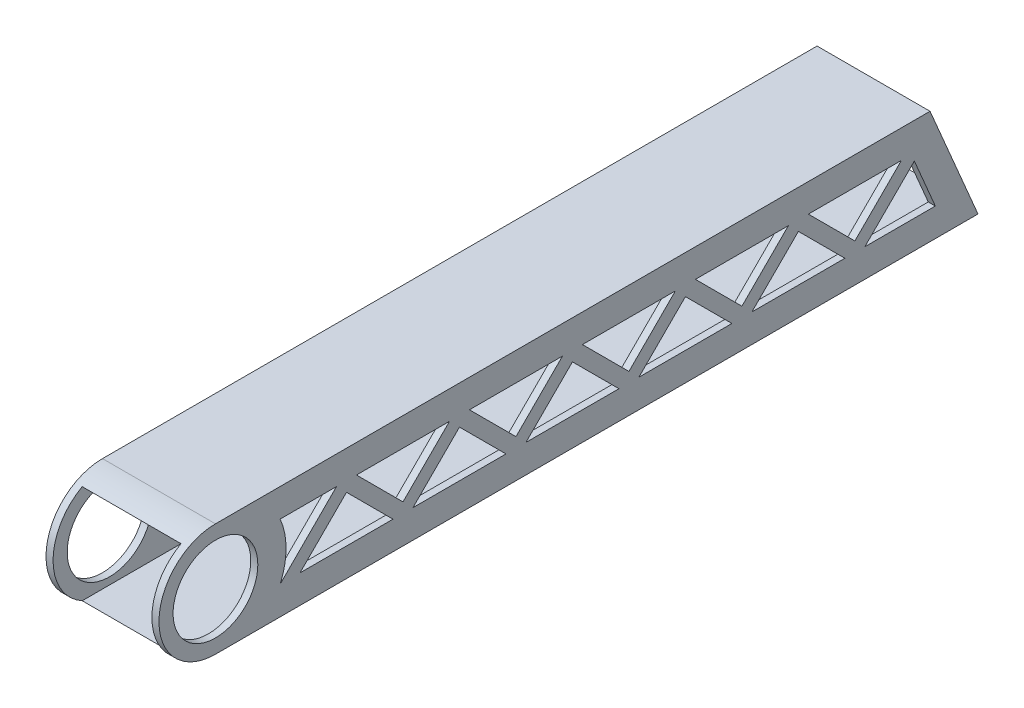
ISO-10303-21;
HEADER;
FILE_DESCRIPTION(('STEP AP214'),'2;1');
FILE_NAME('part.step','',(''),(''),'','','');
FILE_SCHEMA(('AUTOMOTIVE_DESIGN { 1 0 10303 214 1 1 1 1 }'));
ENDSEC;
DATA;
#1=APPLICATION_CONTEXT('core data for automotive mechanical design processes');
#2=APPLICATION_PROTOCOL_DEFINITION('international standard','automotive_design',2000,#1);
#3=PRODUCT_CONTEXT('',#1,'mechanical');
#4=PRODUCT('Part','Part','',(#3));
#5=PRODUCT_RELATED_PRODUCT_CATEGORY('part','',(#4));
#6=PRODUCT_DEFINITION_FORMATION('','',#4);
#7=PRODUCT_DEFINITION_CONTEXT('part definition',#1,'design');
#8=PRODUCT_DEFINITION('design','',#6,#7);
#9=PRODUCT_DEFINITION_SHAPE('','',#8);
#10=(LENGTH_UNIT() NAMED_UNIT(*) SI_UNIT(.MILLI.,.METRE.));
#11=(NAMED_UNIT(*) PLANE_ANGLE_UNIT() SI_UNIT($,.RADIAN.));
#12=(NAMED_UNIT(*) SI_UNIT($,.STERADIAN.) SOLID_ANGLE_UNIT());
#13=UNCERTAINTY_MEASURE_WITH_UNIT(LENGTH_MEASURE(1.E-05),#10,'distance_accuracy_value','');
#14=(GEOMETRIC_REPRESENTATION_CONTEXT(3) GLOBAL_UNCERTAINTY_ASSIGNED_CONTEXT((#13)) GLOBAL_UNIT_ASSIGNED_CONTEXT((#10,
#11,#12)) REPRESENTATION_CONTEXT('',''));
#15=CARTESIAN_POINT('',(0.,0.,0.));
#16=DIRECTION('',(0.,0.,1.));
#17=DIRECTION('',(1.,0.,0.));
#18=AXIS2_PLACEMENT_3D('',#15,#16,#17);
#19=CARTESIAN_POINT('',(0.,0.,368.3));
#20=DIRECTION('',(1.,0.,0.));
#21=DIRECTION('',(0.,0.,-1.));
#22=AXIS2_PLACEMENT_3D('',#19,#20,#21);
#23=PLANE('',#22);
#24=DIRECTION('',(0.,-0.707106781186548,-0.707106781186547));
#25=VECTOR('',#24,1.);
#26=CARTESIAN_POINT('',(0.,12.7,263.059395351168));
#27=LINE('',#26,#25);
#28=CARTESIAN_POINT('',(0.,31.3648079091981,281.724203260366));
#29=VERTEX_POINT('',#28);
#30=CARTESIAN_POINT('',(0.,18.1200640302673,268.479459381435));
#31=VERTEX_POINT('',#30);
#32=EDGE_CURVE('E854',#29,#31,#27,.T.);
#33=ORIENTED_EDGE('',*,*,#32,.F.);
#34=CARTESIAN_POINT('',(0.,29.1197438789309,283.969267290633));
#35=DIRECTION('',(1.,0.,0.));
#36=DIRECTION('',(0.,0.,-1.));
#37=AXIS2_PLACEMENT_3D('',#34,#35,#36);
#38=CIRCLE('',#37,3.175);
#39=CARTESIAN_POINT('',(0.,31.3648079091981,286.214331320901));
#40=VERTEX_POINT('',#39);
#41=EDGE_CURVE('E51',#29,#40,#38,.T.);
#42=ORIENTED_EDGE('',*,*,#41,.T.);
#43=DIRECTION('',(0.,0.707106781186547,-0.707106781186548));
#44=VECTOR('',#43,1.);
#45=CARTESIAN_POINT('',(0.,33.6098719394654,283.969267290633));
#46=LINE('',#45,#44);
#47=CARTESIAN_POINT('',(0.,18.1200640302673,299.459075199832));
#48=VERTEX_POINT('',#47);
#49=EDGE_CURVE('E852',#48,#40,#46,.T.);
#50=ORIENTED_EDGE('',*,*,#49,.F.);
#51=CARTESIAN_POINT('',(0.,15.875,297.214011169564));
#52=DIRECTION('',(1.,0.,0.));
#53=DIRECTION('',(0.,0.,-1.));
#54=AXIS2_PLACEMENT_3D('',#51,#52,#53);
#55=CIRCLE('',#54,3.175);
#56=CARTESIAN_POINT('',(0.,12.7,297.214011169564));
#57=VERTEX_POINT('',#56);
#58=EDGE_CURVE('E59',#48,#57,#55,.T.);
#59=ORIENTED_EDGE('',*,*,#58,.T.);
#60=DIRECTION('',(0.,0.,1.));
#61=VECTOR('',#60,1.);
#62=CARTESIAN_POINT('',(0.,12.7,304.879139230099));
#63=LINE('',#62,#61);
#64=CARTESIAN_POINT('',(0.,12.7,270.724523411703));
#65=VERTEX_POINT('',#64);
#66=EDGE_CURVE('E845',#65,#57,#63,.T.);
#67=ORIENTED_EDGE('',*,*,#66,.F.);
#68=CARTESIAN_POINT('',(0.,15.875,270.724523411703));
#69=DIRECTION('',(1.,0.,0.));
#70=DIRECTION('',(0.,0.,-1.));
#71=AXIS2_PLACEMENT_3D('',#68,#69,#70);
#72=CIRCLE('',#71,3.175);
#73=EDGE_CURVE('E1649',#65,#31,#72,.T.);
#74=ORIENTED_EDGE('',*,*,#73,.T.);
#75=EDGE_LOOP('',(#33,#42,#50,#59,#67,#74));
#76=FACE_BOUND('',#75,.T.);
#77=DIRECTION('',(0.,0.,-1.));
#78=VECTOR('',#77,1.);
#79=CARTESIAN_POINT('',(0.,38.1,34.459395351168));
#80=LINE('',#79,#78);
#81=CARTESIAN_POINT('',(0.,38.1,68.6140111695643));
#82=VERTEX_POINT('',#81);
#83=CARTESIAN_POINT('',(0.,38.1,42.1245234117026));
#84=VERTEX_POINT('',#83);
#85=EDGE_CURVE('E882',#82,#84,#80,.T.);
#86=ORIENTED_EDGE('',*,*,#85,.F.);
#87=CARTESIAN_POINT('',(0.,34.925,68.6140111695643));
#88=DIRECTION('',(1.,0.,0.));
#89=DIRECTION('',(0.,0.,-1.));
#90=AXIS2_PLACEMENT_3D('',#87,#88,#89);
#91=CIRCLE('',#90,3.175);
#92=CARTESIAN_POINT('',(0.,32.6799359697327,70.8590751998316));
#93=VERTEX_POINT('',#92);
#94=EDGE_CURVE('E1645',#82,#93,#91,.T.);
#95=ORIENTED_EDGE('',*,*,#94,.T.);
#96=DIRECTION('',(0.,0.707106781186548,0.707106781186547));
#97=VECTOR('',#96,1.);
#98=CARTESIAN_POINT('',(0.,17.1901280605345,55.3692672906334));
#99=LINE('',#98,#97);
#100=CARTESIAN_POINT('',(0.,19.4351920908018,57.6143313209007));
#101=VERTEX_POINT('',#100);
#102=EDGE_CURVE('E879',#101,#93,#99,.T.);
#103=ORIENTED_EDGE('',*,*,#102,.F.);
#104=CARTESIAN_POINT('',(0.,21.6802561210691,55.3692672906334));
#105=DIRECTION('',(1.,0.,0.));
#106=DIRECTION('',(0.,0.,-1.));
#107=AXIS2_PLACEMENT_3D('',#104,#105,#106);
#108=CIRCLE('',#107,3.175);
#109=CARTESIAN_POINT('',(0.,19.4351920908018,53.1242032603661));
#110=VERTEX_POINT('',#109);
#111=EDGE_CURVE('E1641',#101,#110,#108,.T.);
#112=ORIENTED_EDGE('',*,*,#111,.T.);
#113=DIRECTION('',(0.,-0.707106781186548,0.707106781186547));
#114=VECTOR('',#113,1.);
#115=CARTESIAN_POINT('',(0.,38.1,34.459395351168));
#116=LINE('',#115,#114);
#117=CARTESIAN_POINT('',(0.,32.6799359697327,39.8794593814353));
#118=VERTEX_POINT('',#117);
#119=EDGE_CURVE('E872',#118,#110,#116,.T.);
#120=ORIENTED_EDGE('',*,*,#119,.F.);
#121=CARTESIAN_POINT('',(0.,34.925,42.1245234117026));
#122=DIRECTION('',(1.,0.,0.));
#123=DIRECTION('',(0.,0.,-1.));
#124=AXIS2_PLACEMENT_3D('',#121,#122,#123);
#125=CIRCLE('',#124,3.175);
#126=EDGE_CURVE('E1637',#118,#84,#125,.T.);
#127=ORIENTED_EDGE('',*,*,#126,.T.);
#128=EDGE_LOOP('',(#86,#95,#103,#112,#120,#127));
#129=FACE_BOUND('',#128,.T.);
#130=DIRECTION('',(0.,0.,-1.));
#131=VECTOR('',#130,1.);
#132=CARTESIAN_POINT('',(0.,38.1,85.259395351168));
#133=LINE('',#132,#131);
#134=CARTESIAN_POINT('',(0.,38.1,119.414011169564));
#135=VERTEX_POINT('',#134);
#136=CARTESIAN_POINT('',(0.,38.1,92.9245234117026));
#137=VERTEX_POINT('',#136);
#138=EDGE_CURVE('E907',#135,#137,#133,.T.);
#139=ORIENTED_EDGE('',*,*,#138,.F.);
#140=CARTESIAN_POINT('',(0.,34.925,119.414011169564));
#141=DIRECTION('',(1.,0.,0.));
#142=DIRECTION('',(0.,0.,-1.));
#143=AXIS2_PLACEMENT_3D('',#140,#141,#142);
#144=CIRCLE('',#143,3.175);
#145=CARTESIAN_POINT('',(0.,32.6799359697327,121.659075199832));
#146=VERTEX_POINT('',#145);
#147=EDGE_CURVE('E1633',#135,#146,#144,.T.);
#148=ORIENTED_EDGE('',*,*,#147,.T.);
#149=DIRECTION('',(0.,0.707106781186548,0.707106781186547));
#150=VECTOR('',#149,1.);
#151=CARTESIAN_POINT('',(0.,38.1,127.079139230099));
#152=LINE('',#151,#150);
#153=CARTESIAN_POINT('',(0.,19.4351920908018,108.414331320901));
#154=VERTEX_POINT('',#153);
#155=EDGE_CURVE('E788',#154,#146,#152,.T.);
#156=ORIENTED_EDGE('',*,*,#155,.F.);
#157=CARTESIAN_POINT('',(0.,21.6802561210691,106.169267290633));
#158=DIRECTION('',(1.,0.,0.));
#159=DIRECTION('',(0.,0.,-1.));
#160=AXIS2_PLACEMENT_3D('',#157,#158,#159);
#161=CIRCLE('',#160,3.175);
#162=CARTESIAN_POINT('',(0.,19.4351920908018,103.924203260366));
#163=VERTEX_POINT('',#162);
#164=EDGE_CURVE('E1629',#154,#163,#161,.T.);
#165=ORIENTED_EDGE('',*,*,#164,.T.);
#166=DIRECTION('',(0.,-0.707106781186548,0.707106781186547));
#167=VECTOR('',#166,1.);
#168=CARTESIAN_POINT('',(0.,38.1,85.259395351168));
#169=LINE('',#168,#167);
#170=CARTESIAN_POINT('',(0.,32.6799359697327,90.6794593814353));
#171=VERTEX_POINT('',#170);
#172=EDGE_CURVE('E898',#171,#163,#169,.T.);
#173=ORIENTED_EDGE('',*,*,#172,.F.);
#174=CARTESIAN_POINT('',(0.,34.925,92.9245234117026));
#175=DIRECTION('',(1.,0.,0.));
#176=DIRECTION('',(0.,0.,-1.));
#177=AXIS2_PLACEMENT_3D('',#174,#175,#176);
#178=CIRCLE('',#177,3.175);
#179=EDGE_CURVE('E1625',#171,#137,#178,.T.);
#180=ORIENTED_EDGE('',*,*,#179,.T.);
#181=EDGE_LOOP('',(#139,#148,#156,#165,#173,#180));
#182=FACE_BOUND('',#181,.T.);
#183=DIRECTION('',(0.,0.,-1.));
#184=VECTOR('',#183,1.);
#185=CARTESIAN_POINT('',(0.,38.1,136.059395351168));
#186=LINE('',#185,#184);
#187=CARTESIAN_POINT('',(0.,38.1,170.214011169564));
#188=VERTEX_POINT('',#187);
#189=CARTESIAN_POINT('',(0.,38.1,143.724523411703));
#190=VERTEX_POINT('',#189);
#191=EDGE_CURVE('E776',#188,#190,#186,.T.);
#192=ORIENTED_EDGE('',*,*,#191,.F.);
#193=CARTESIAN_POINT('',(0.,34.925,170.214011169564));
#194=DIRECTION('',(1.,0.,0.));
#195=DIRECTION('',(0.,0.,-1.));
#196=AXIS2_PLACEMENT_3D('',#193,#194,#195);
#197=CIRCLE('',#196,3.175);
#198=CARTESIAN_POINT('',(0.,32.6799359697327,172.459075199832));
#199=VERTEX_POINT('',#198);
#200=EDGE_CURVE('E1621',#188,#199,#197,.T.);
#201=ORIENTED_EDGE('',*,*,#200,.T.);
#202=DIRECTION('',(0.,0.707106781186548,0.707106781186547));
#203=VECTOR('',#202,1.);
#204=CARTESIAN_POINT('',(0.,38.1,177.879139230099));
#205=LINE('',#204,#203);
#206=CARTESIAN_POINT('',(0.,19.4351920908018,159.214331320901));
#207=VERTEX_POINT('',#206);
#208=EDGE_CURVE('E780',#207,#199,#205,.T.);
#209=ORIENTED_EDGE('',*,*,#208,.F.);
#210=CARTESIAN_POINT('',(0.,21.6802561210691,156.969267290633));
#211=DIRECTION('',(1.,0.,0.));
#212=DIRECTION('',(0.,0.,-1.));
#213=AXIS2_PLACEMENT_3D('',#210,#211,#212);
#214=CIRCLE('',#213,3.175);
#215=CARTESIAN_POINT('',(0.,19.4351920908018,154.724203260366));
#216=VERTEX_POINT('',#215);
#217=EDGE_CURVE('E1617',#207,#216,#214,.T.);
#218=ORIENTED_EDGE('',*,*,#217,.T.);
#219=DIRECTION('',(0.,-0.707106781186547,0.707106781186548));
#220=VECTOR('',#219,1.);
#221=CARTESIAN_POINT('',(0.,38.1,136.059395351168));
#222=LINE('',#221,#220);
#223=CARTESIAN_POINT('',(0.,32.6799359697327,141.479459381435));
#224=VERTEX_POINT('',#223);
#225=EDGE_CURVE('E773',#224,#216,#222,.T.);
#226=ORIENTED_EDGE('',*,*,#225,.F.);
#227=CARTESIAN_POINT('',(0.,34.925,143.724523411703));
#228=DIRECTION('',(1.,0.,0.));
#229=DIRECTION('',(0.,0.,-1.));
#230=AXIS2_PLACEMENT_3D('',#227,#228,#229);
#231=CIRCLE('',#230,3.175);
#232=EDGE_CURVE('E1613',#224,#190,#231,.T.);
#233=ORIENTED_EDGE('',*,*,#232,.T.);
#234=EDGE_LOOP('',(#192,#201,#209,#218,#226,#233));
#235=FACE_BOUND('',#234,.T.);
#236=DIRECTION('',(0.,0.,-1.));
#237=VECTOR('',#236,1.);
#238=CARTESIAN_POINT('',(0.,38.1,186.859395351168));
#239=LINE('',#238,#237);
#240=CARTESIAN_POINT('',(0.,38.1,221.014011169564));
#241=VERTEX_POINT('',#240);
#242=CARTESIAN_POINT('',(0.,38.1,194.524523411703));
#243=VERTEX_POINT('',#242);
#244=EDGE_CURVE('E804',#241,#243,#239,.T.);
#245=ORIENTED_EDGE('',*,*,#244,.F.);
#246=CARTESIAN_POINT('',(0.,34.925,221.014011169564));
#247=DIRECTION('',(1.,0.,0.));
#248=DIRECTION('',(0.,0.,-1.));
#249=AXIS2_PLACEMENT_3D('',#246,#247,#248);
#250=CIRCLE('',#249,3.175);
#251=CARTESIAN_POINT('',(0.,32.6799359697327,223.259075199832));
#252=VERTEX_POINT('',#251);
#253=EDGE_CURVE('E1609',#241,#252,#250,.T.);
#254=ORIENTED_EDGE('',*,*,#253,.T.);
#255=DIRECTION('',(0.,0.707106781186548,0.707106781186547));
#256=VECTOR('',#255,1.);
#257=CARTESIAN_POINT('',(0.,17.1901280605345,207.769267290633));
#258=LINE('',#257,#256);
#259=CARTESIAN_POINT('',(0.,19.4351920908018,210.014331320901));
#260=VERTEX_POINT('',#259);
#261=EDGE_CURVE('E801',#260,#252,#258,.T.);
#262=ORIENTED_EDGE('',*,*,#261,.F.);
#263=CARTESIAN_POINT('',(0.,21.6802561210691,207.769267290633));
#264=DIRECTION('',(1.,0.,0.));
#265=DIRECTION('',(0.,0.,-1.));
#266=AXIS2_PLACEMENT_3D('',#263,#264,#265);
#267=CIRCLE('',#266,3.175);
#268=CARTESIAN_POINT('',(0.,19.4351920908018,205.524203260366));
#269=VERTEX_POINT('',#268);
#270=EDGE_CURVE('E1605',#260,#269,#267,.T.);
#271=ORIENTED_EDGE('',*,*,#270,.T.);
#272=DIRECTION('',(0.,-0.707106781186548,0.707106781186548));
#273=VECTOR('',#272,1.);
#274=CARTESIAN_POINT('',(0.,38.1,186.859395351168));
#275=LINE('',#274,#273);
#276=CARTESIAN_POINT('',(0.,32.6799359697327,192.279459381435));
#277=VERTEX_POINT('',#276);
#278=EDGE_CURVE('E794',#277,#269,#275,.T.);
#279=ORIENTED_EDGE('',*,*,#278,.F.);
#280=CARTESIAN_POINT('',(0.,34.925,194.524523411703));
#281=DIRECTION('',(1.,0.,0.));
#282=DIRECTION('',(0.,0.,-1.));
#283=AXIS2_PLACEMENT_3D('',#280,#281,#282);
#284=CIRCLE('',#283,3.175);
#285=EDGE_CURVE('E1601',#277,#243,#284,.T.);
#286=ORIENTED_EDGE('',*,*,#285,.T.);
#287=EDGE_LOOP('',(#245,#254,#262,#271,#279,#286));
#288=FACE_BOUND('',#287,.T.);
#289=DIRECTION('',(0.,0.,-1.));
#290=VECTOR('',#289,1.);
#291=CARTESIAN_POINT('',(0.,38.1,237.659395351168));
#292=LINE('',#291,#290);
#293=CARTESIAN_POINT('',(0.,38.1,271.814011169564));
#294=VERTEX_POINT('',#293);
#295=CARTESIAN_POINT('',(0.,38.1,245.324523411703));
#296=VERTEX_POINT('',#295);
#297=EDGE_CURVE('E830',#294,#296,#292,.T.);
#298=ORIENTED_EDGE('',*,*,#297,.F.);
#299=CARTESIAN_POINT('',(0.,34.925,271.814011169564));
#300=DIRECTION('',(1.,0.,0.));
#301=DIRECTION('',(0.,0.,-1.));
#302=AXIS2_PLACEMENT_3D('',#299,#300,#301);
#303=CIRCLE('',#302,3.175);
#304=CARTESIAN_POINT('',(0.,32.6799359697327,274.059075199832));
#305=VERTEX_POINT('',#304);
#306=EDGE_CURVE('E1597',#294,#305,#303,.T.);
#307=ORIENTED_EDGE('',*,*,#306,.T.);
#308=DIRECTION('',(0.,0.707106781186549,0.707106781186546));
#309=VECTOR('',#308,1.);
#310=CARTESIAN_POINT('',(0.,17.1901280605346,258.569267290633));
#311=LINE('',#310,#309);
#312=CARTESIAN_POINT('',(0.,19.4351920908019,260.814331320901));
#313=VERTEX_POINT('',#312);
#314=EDGE_CURVE('E827',#313,#305,#311,.T.);
#315=ORIENTED_EDGE('',*,*,#314,.F.);
#316=CARTESIAN_POINT('',(0.,21.6802561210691,258.569267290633));
#317=DIRECTION('',(1.,0.,0.));
#318=DIRECTION('',(0.,0.,-1.));
#319=AXIS2_PLACEMENT_3D('',#316,#317,#318);
#320=CIRCLE('',#319,3.175);
#321=CARTESIAN_POINT('',(0.,19.4351920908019,256.324203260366));
#322=VERTEX_POINT('',#321);
#323=EDGE_CURVE('E1593',#313,#322,#320,.T.);
#324=ORIENTED_EDGE('',*,*,#323,.T.);
#325=DIRECTION('',(0.,-0.707106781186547,0.707106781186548));
#326=VECTOR('',#325,1.);
#327=CARTESIAN_POINT('',(0.,38.1,237.659395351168));
#328=LINE('',#327,#326);
#329=CARTESIAN_POINT('',(0.,32.6799359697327,243.079459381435));
#330=VERTEX_POINT('',#329);
#331=EDGE_CURVE('E820',#330,#322,#328,.T.);
#332=ORIENTED_EDGE('',*,*,#331,.F.);
#333=CARTESIAN_POINT('',(0.,34.925,245.324523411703));
#334=DIRECTION('',(1.,0.,0.));
#335=DIRECTION('',(0.,0.,-1.));
#336=AXIS2_PLACEMENT_3D('',#333,#334,#335);
#337=CIRCLE('',#336,3.175);
#338=EDGE_CURVE('E1589',#330,#296,#337,.T.);
#339=ORIENTED_EDGE('',*,*,#338,.T.);
#340=EDGE_LOOP('',(#298,#307,#315,#324,#332,#339));
#341=FACE_BOUND('',#340,.T.);
#342=DIRECTION('',(0.,-0.707106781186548,-0.707106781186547));
#343=VECTOR('',#342,1.);
#344=CARTESIAN_POINT('',(0.,12.7,212.259395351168));
#345=LINE('',#344,#343);
#346=CARTESIAN_POINT('',(0.,31.3648079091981,230.924203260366));
#347=VERTEX_POINT('',#346);
#348=CARTESIAN_POINT('',(0.,18.1200640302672,217.679459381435));
#349=VERTEX_POINT('',#348);
#350=EDGE_CURVE('E1037',#347,#349,#345,.T.);
#351=ORIENTED_EDGE('',*,*,#350,.F.);
#352=CARTESIAN_POINT('',(0.,29.1197438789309,233.169267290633));
#353=DIRECTION('',(1.,0.,0.));
#354=DIRECTION('',(0.,0.,-1.));
#355=AXIS2_PLACEMENT_3D('',#352,#353,#354);
#356=CIRCLE('',#355,3.175);
#357=CARTESIAN_POINT('',(0.,31.3648079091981,235.414331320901));
#358=VERTEX_POINT('',#357);
#359=EDGE_CURVE('E1585',#347,#358,#356,.T.);
#360=ORIENTED_EDGE('',*,*,#359,.T.);
#361=DIRECTION('',(0.,0.707106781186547,-0.707106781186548));
#362=VECTOR('',#361,1.);
#363=CARTESIAN_POINT('',(0.,33.6098719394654,233.169267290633));
#364=LINE('',#363,#362);
#365=CARTESIAN_POINT('',(0.,18.1200640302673,248.659075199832));
#366=VERTEX_POINT('',#365);
#367=EDGE_CURVE('E863',#366,#358,#364,.T.);
#368=ORIENTED_EDGE('',*,*,#367,.F.);
#369=CARTESIAN_POINT('',(0.,15.875,246.414011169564));
#370=DIRECTION('',(1.,0.,0.));
#371=DIRECTION('',(0.,0.,-1.));
#372=AXIS2_PLACEMENT_3D('',#369,#370,#371);
#373=CIRCLE('',#372,3.175);
#374=CARTESIAN_POINT('',(0.,12.7,246.414011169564));
#375=VERTEX_POINT('',#374);
#376=EDGE_CURVE('E1581',#366,#375,#373,.T.);
#377=ORIENTED_EDGE('',*,*,#376,.T.);
#378=DIRECTION('',(0.,0.,1.));
#379=VECTOR('',#378,1.);
#380=CARTESIAN_POINT('',(0.,12.7,254.079139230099));
#381=LINE('',#380,#379);
#382=CARTESIAN_POINT('',(0.,12.7,219.924523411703));
#383=VERTEX_POINT('',#382);
#384=EDGE_CURVE('E1028',#383,#375,#381,.T.);
#385=ORIENTED_EDGE('',*,*,#384,.F.);
#386=CARTESIAN_POINT('',(0.,15.875,219.924523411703));
#387=DIRECTION('',(1.,0.,0.));
#388=DIRECTION('',(0.,0.,-1.));
#389=AXIS2_PLACEMENT_3D('',#386,#387,#388);
#390=CIRCLE('',#389,3.175);
#391=EDGE_CURVE('E1577',#383,#349,#390,.T.);
#392=ORIENTED_EDGE('',*,*,#391,.T.);
#393=EDGE_LOOP('',(#351,#360,#368,#377,#385,#392));
#394=FACE_BOUND('',#393,.T.);
#395=DIRECTION('',(0.,-0.707106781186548,-0.707106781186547));
#396=VECTOR('',#395,1.);
#397=CARTESIAN_POINT('',(0.,33.6098719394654,182.369267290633));
#398=LINE('',#397,#396);
#399=CARTESIAN_POINT('',(0.,31.3648079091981,180.124203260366));
#400=VERTEX_POINT('',#399);
#401=CARTESIAN_POINT('',(0.,18.1200640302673,166.879459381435));
#402=VERTEX_POINT('',#401);
#403=EDGE_CURVE('E1012',#400,#402,#398,.T.);
#404=ORIENTED_EDGE('',*,*,#403,.F.);
#405=CARTESIAN_POINT('',(0.,29.1197438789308,182.369267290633));
#406=DIRECTION('',(1.,0.,0.));
#407=DIRECTION('',(0.,0.,-1.));
#408=AXIS2_PLACEMENT_3D('',#405,#406,#407);
#409=CIRCLE('',#408,3.175);
#410=CARTESIAN_POINT('',(0.,31.3648079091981,184.614331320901));
#411=VERTEX_POINT('',#410);
#412=EDGE_CURVE('E1573',#400,#411,#409,.T.);
#413=ORIENTED_EDGE('',*,*,#412,.T.);
#414=DIRECTION('',(0.,0.707106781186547,-0.707106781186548));
#415=VECTOR('',#414,1.);
#416=CARTESIAN_POINT('',(0.,33.6098719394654,182.369267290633));
#417=LINE('',#416,#415);
#418=CARTESIAN_POINT('',(0.,18.1200640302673,197.859075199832));
#419=VERTEX_POINT('',#418);
#420=EDGE_CURVE('E1009',#419,#411,#417,.T.);
#421=ORIENTED_EDGE('',*,*,#420,.F.);
#422=CARTESIAN_POINT('',(0.,15.875,195.614011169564));
#423=DIRECTION('',(1.,0.,0.));
#424=DIRECTION('',(0.,0.,-1.));
#425=AXIS2_PLACEMENT_3D('',#422,#423,#424);
#426=CIRCLE('',#425,3.175);
#427=CARTESIAN_POINT('',(0.,12.7,195.614011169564));
#428=VERTEX_POINT('',#427);
#429=EDGE_CURVE('E1569',#419,#428,#426,.T.);
#430=ORIENTED_EDGE('',*,*,#429,.T.);
#431=DIRECTION('',(0.,0.,1.));
#432=VECTOR('',#431,1.);
#433=CARTESIAN_POINT('',(0.,12.7,203.279139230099));
#434=LINE('',#433,#432);
#435=CARTESIAN_POINT('',(0.,12.7,169.124523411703));
#436=VERTEX_POINT('',#435);
#437=EDGE_CURVE('E1002',#436,#428,#434,.T.);
#438=ORIENTED_EDGE('',*,*,#437,.F.);
#439=CARTESIAN_POINT('',(0.,15.875,169.124523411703));
#440=DIRECTION('',(1.,0.,0.));
#441=DIRECTION('',(0.,0.,-1.));
#442=AXIS2_PLACEMENT_3D('',#439,#440,#441);
#443=CIRCLE('',#442,3.175);
#444=EDGE_CURVE('E1565',#436,#402,#443,.T.);
#445=ORIENTED_EDGE('',*,*,#444,.T.);
#446=EDGE_LOOP('',(#404,#413,#421,#430,#438,#445));
#447=FACE_BOUND('',#446,.T.);
#448=DIRECTION('',(0.,-0.707106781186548,-0.707106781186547));
#449=VECTOR('',#448,1.);
#450=CARTESIAN_POINT('',(0.,33.6098719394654,131.569267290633));
#451=LINE('',#450,#449);
#452=CARTESIAN_POINT('',(0.,31.3648079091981,129.324203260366));
#453=VERTEX_POINT('',#452);
#454=CARTESIAN_POINT('',(0.,18.1200640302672,116.079459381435));
#455=VERTEX_POINT('',#454);
#456=EDGE_CURVE('E986',#453,#455,#451,.T.);
#457=ORIENTED_EDGE('',*,*,#456,.F.);
#458=CARTESIAN_POINT('',(0.,29.1197438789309,131.569267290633));
#459=DIRECTION('',(1.,0.,0.));
#460=DIRECTION('',(0.,0.,-1.));
#461=AXIS2_PLACEMENT_3D('',#458,#459,#460);
#462=CIRCLE('',#461,3.175);
#463=CARTESIAN_POINT('',(0.,31.3648079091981,133.814331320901));
#464=VERTEX_POINT('',#463);
#465=EDGE_CURVE('E1561',#453,#464,#462,.T.);
#466=ORIENTED_EDGE('',*,*,#465,.T.);
#467=DIRECTION('',(0.,0.707106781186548,-0.707106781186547));
#468=VECTOR('',#467,1.);
#469=CARTESIAN_POINT('',(0.,33.6098719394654,131.569267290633));
#470=LINE('',#469,#468);
#471=CARTESIAN_POINT('',(0.,18.1200640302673,147.059075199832));
#472=VERTEX_POINT('',#471);
#473=EDGE_CURVE('E983',#472,#464,#470,.T.);
#474=ORIENTED_EDGE('',*,*,#473,.F.);
#475=CARTESIAN_POINT('',(0.,15.875,144.814011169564));
#476=DIRECTION('',(1.,0.,0.));
#477=DIRECTION('',(0.,0.,-1.));
#478=AXIS2_PLACEMENT_3D('',#475,#476,#477);
#479=CIRCLE('',#478,3.175);
#480=CARTESIAN_POINT('',(0.,12.7,144.814011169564));
#481=VERTEX_POINT('',#480);
#482=EDGE_CURVE('E1557',#472,#481,#479,.T.);
#483=ORIENTED_EDGE('',*,*,#482,.T.);
#484=DIRECTION('',(0.,0.,1.));
#485=VECTOR('',#484,1.);
#486=CARTESIAN_POINT('',(0.,12.7,152.479139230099));
#487=LINE('',#486,#485);
#488=CARTESIAN_POINT('',(0.,12.7,118.324523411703));
#489=VERTEX_POINT('',#488);
#490=EDGE_CURVE('E976',#489,#481,#487,.T.);
#491=ORIENTED_EDGE('',*,*,#490,.F.);
#492=CARTESIAN_POINT('',(0.,15.875,118.324523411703));
#493=DIRECTION('',(1.,0.,0.));
#494=DIRECTION('',(0.,0.,-1.));
#495=AXIS2_PLACEMENT_3D('',#492,#493,#494);
#496=CIRCLE('',#495,3.175);
#497=EDGE_CURVE('E1553',#489,#455,#496,.T.);
#498=ORIENTED_EDGE('',*,*,#497,.T.);
#499=EDGE_LOOP('',(#457,#466,#474,#483,#491,#498));
#500=FACE_BOUND('',#499,.T.);
#501=DIRECTION('',(0.,-0.707106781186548,-0.707106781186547));
#502=VECTOR('',#501,1.);
#503=CARTESIAN_POINT('',(0.,12.6999999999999,59.859395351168));
#504=LINE('',#503,#502);
#505=CARTESIAN_POINT('',(0.,31.3648079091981,78.5242032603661));
#506=VERTEX_POINT('',#505);
#507=CARTESIAN_POINT('',(0.,18.1200640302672,65.2794593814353));
#508=VERTEX_POINT('',#507);
#509=EDGE_CURVE('E960',#506,#508,#504,.T.);
#510=ORIENTED_EDGE('',*,*,#509,.F.);
#511=CARTESIAN_POINT('',(0.,29.1197438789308,80.7692672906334));
#512=DIRECTION('',(1.,0.,0.));
#513=DIRECTION('',(0.,0.,-1.));
#514=AXIS2_PLACEMENT_3D('',#511,#512,#513);
#515=CIRCLE('',#514,3.175);
#516=CARTESIAN_POINT('',(0.,31.3648079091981,83.0143313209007));
#517=VERTEX_POINT('',#516);
#518=EDGE_CURVE('E1549',#506,#517,#515,.T.);
#519=ORIENTED_EDGE('',*,*,#518,.T.);
#520=DIRECTION('',(0.,0.707106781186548,-0.707106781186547));
#521=VECTOR('',#520,1.);
#522=CARTESIAN_POINT('',(0.,33.6098719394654,80.7692672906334));
#523=LINE('',#522,#521);
#524=CARTESIAN_POINT('',(0.,18.1200640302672,96.2590751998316));
#525=VERTEX_POINT('',#524);
#526=EDGE_CURVE('E957',#525,#517,#523,.T.);
#527=ORIENTED_EDGE('',*,*,#526,.F.);
#528=CARTESIAN_POINT('',(0.,15.875,94.0140111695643));
#529=DIRECTION('',(1.,0.,0.));
#530=DIRECTION('',(0.,0.,-1.));
#531=AXIS2_PLACEMENT_3D('',#528,#529,#530);
#532=CIRCLE('',#531,3.175);
#533=CARTESIAN_POINT('',(0.,12.7,94.0140111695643));
#534=VERTEX_POINT('',#533);
#535=EDGE_CURVE('E1545',#525,#534,#532,.T.);
#536=ORIENTED_EDGE('',*,*,#535,.T.);
#537=DIRECTION('',(0.,0.,1.));
#538=VECTOR('',#537,1.);
#539=CARTESIAN_POINT('',(0.,12.7,101.679139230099));
#540=LINE('',#539,#538);
#541=CARTESIAN_POINT('',(0.,12.6999999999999,67.5245234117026));
#542=VERTEX_POINT('',#541);
#543=EDGE_CURVE('E950',#542,#534,#540,.T.);
#544=ORIENTED_EDGE('',*,*,#543,.F.);
#545=CARTESIAN_POINT('',(0.,15.8749999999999,67.5245234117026));
#546=DIRECTION('',(1.,0.,0.));
#547=DIRECTION('',(0.,0.,-1.));
#548=AXIS2_PLACEMENT_3D('',#545,#546,#547);
#549=CIRCLE('',#548,3.175);
#550=EDGE_CURVE('E1541',#542,#508,#549,.T.);
#551=ORIENTED_EDGE('',*,*,#550,.T.);
#552=EDGE_LOOP('',(#510,#519,#527,#536,#544,#551));
#553=FACE_BOUND('',#552,.T.);
#554=DIRECTION('',(0.,0.707106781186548,-0.707106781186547));
#555=VECTOR('',#554,1.);
#556=CARTESIAN_POINT('',(0.,34.9478712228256,28.6312680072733));
#557=LINE('',#556,#555);
#558=CARTESIAN_POINT('',(0.,18.1200640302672,45.4590751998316));
#559=VERTEX_POINT('',#558);
#560=CARTESIAN_POINT('',(0.,31.6194269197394,31.9597123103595));
#561=VERTEX_POINT('',#560);
#562=EDGE_CURVE('E932',#559,#561,#557,.T.);
#563=ORIENTED_EDGE('',*,*,#562,.F.);
#564=CARTESIAN_POINT('',(0.,15.875,43.2140111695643));
#565=DIRECTION('',(1.,0.,0.));
#566=DIRECTION('',(0.,0.,-1.));
#567=AXIS2_PLACEMENT_3D('',#564,#565,#566);
#568=CIRCLE('',#567,3.175);
#569=CARTESIAN_POINT('',(0.,12.7,43.2140111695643));
#570=VERTEX_POINT('',#569);
#571=EDGE_CURVE('E44',#559,#570,#568,.T.);
#572=ORIENTED_EDGE('',*,*,#571,.T.);
#573=DIRECTION('',(0.,0.,1.));
#574=VECTOR('',#573,1.);
#575=CARTESIAN_POINT('',(0.,12.6999999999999,50.8791392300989));
#576=LINE('',#575,#574);
#577=CARTESIAN_POINT('',(0.,12.7,23.9845086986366));
#578=VERTEX_POINT('',#577);
#579=EDGE_CURVE('E929',#578,#570,#576,.T.);
#580=ORIENTED_EDGE('',*,*,#579,.F.);
#581=CARTESIAN_POINT('',(0.,15.875,23.9845086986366));
#582=DIRECTION('',(1.,0.,0.));
#583=DIRECTION('',(0.,0.,-1.));
#584=AXIS2_PLACEMENT_3D('',#581,#582,#583);
#585=CIRCLE('',#584,3.175);
#586=CARTESIAN_POINT('',(0.,17.1155713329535,21.0619057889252));
#587=VERTEX_POINT('',#586);
#588=EDGE_CURVE('E1537',#578,#587,#585,.T.);
#589=ORIENTED_EDGE('',*,*,#588,.T.);
#590=DIRECTION('',(0.,-0.920504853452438,-0.390731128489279));
#591=VECTOR('',#590,1.);
#592=CARTESIAN_POINT('',(0.,12.7,19.1876069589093));
#593=LINE('',#592,#591);
#594=CARTESIAN_POINT('',(0.,30.6149342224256,26.7920453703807));
#595=VERTEX_POINT('',#594);
#596=EDGE_CURVE('E922',#595,#587,#593,.T.);
#597=ORIENTED_EDGE('',*,*,#596,.F.);
#598=CARTESIAN_POINT('',(0.,29.3743628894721,29.7146482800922));
#599=DIRECTION('',(1.,0.,0.));
#600=DIRECTION('',(0.,0.,-1.));
#601=AXIS2_PLACEMENT_3D('',#598,#599,#600);
#602=CIRCLE('',#601,3.175);
#603=EDGE_CURVE('E1533',#595,#561,#602,.T.);
#604=ORIENTED_EDGE('',*,*,#603,.T.);
#605=EDGE_LOOP('',(#563,#572,#580,#589,#597,#604));
#606=FACE_BOUND('',#605,.T.);
#607=DIRECTION('',(0.,0.,-1.));
#608=VECTOR('',#607,1.);
#609=CARTESIAN_POINT('',(0.,38.1,288.459395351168));
#610=LINE('',#609,#608);
#611=CARTESIAN_POINT('',(0.,38.1,309.29895834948));
#612=VERTEX_POINT('',#611);
#613=CARTESIAN_POINT('',(0.,38.1,296.124523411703));
#614=VERTEX_POINT('',#613);
#615=EDGE_CURVE('E1160',#612,#614,#610,.T.);
#616=ORIENTED_EDGE('',*,*,#615,.F.);
#617=CARTESIAN_POINT('',(0.,34.925,309.29895834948));
#618=DIRECTION('',(1.,0.,0.));
#619=DIRECTION('',(0.,0.,-1.));
#620=AXIS2_PLACEMENT_3D('',#617,#618,#619);
#621=CIRCLE('',#620,3.175);
#622=CARTESIAN_POINT('',(0.,34.0590909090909,312.353598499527));
#623=VERTEX_POINT('',#622);
#624=EDGE_CURVE('E1529',#612,#623,#621,.T.);
#625=ORIENTED_EDGE('',*,*,#624,.T.);
#626=CARTESIAN_POINT('',(0.,25.4,342.9));
#627=DIRECTION('',(1.,0.,0.));
#628=DIRECTION('',(0.,0.,1.));
#629=AXIS2_PLACEMENT_3D('',#626,#627,#628);
#630=CIRCLE('',#629,31.75);
#631=CARTESIAN_POINT('',(0.,23.2103343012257,311.22559607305));
#632=VERTEX_POINT('',#631);
#633=EDGE_CURVE('E1146',#632,#623,#630,.T.);
#634=ORIENTED_EDGE('',*,*,#633,.F.);
#635=CARTESIAN_POINT('',(0.,22.9913677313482,308.058155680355));
#636=DIRECTION('',(1.,0.,0.));
#637=DIRECTION('',(0.,0.,-1.));
#638=AXIS2_PLACEMENT_3D('',#635,#636,#637);
#639=CIRCLE('',#638,3.175);
#640=CARTESIAN_POINT('',(0.,20.7463037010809,305.813091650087));
#641=VERTEX_POINT('',#640);
#642=EDGE_CURVE('E1521',#632,#641,#639,.T.);
#643=ORIENTED_EDGE('',*,*,#642,.T.);
#644=DIRECTION('',(0.,-0.707106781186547,0.707106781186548));
#645=VECTOR('',#644,1.);
#646=CARTESIAN_POINT('',(0.,38.1,288.459395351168));
#647=LINE('',#646,#645);
#648=CARTESIAN_POINT('',(0.,32.6799359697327,293.879459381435));
#649=VERTEX_POINT('',#648);
#650=EDGE_CURVE('E1151',#649,#641,#647,.T.);
#651=ORIENTED_EDGE('',*,*,#650,.F.);
#652=CARTESIAN_POINT('',(0.,34.925,296.124523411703));
#653=DIRECTION('',(1.,0.,0.));
#654=DIRECTION('',(0.,0.,-1.));
#655=AXIS2_PLACEMENT_3D('',#652,#653,#654);
#656=CIRCLE('',#655,3.175);
#657=EDGE_CURVE('E1525',#649,#614,#656,.T.);
#658=ORIENTED_EDGE('',*,*,#657,.T.);
#659=EDGE_LOOP('',(#616,#625,#634,#643,#651,#658));
#660=FACE_BOUND('',#659,.T.);
#661=CARTESIAN_POINT('',(0.,25.4,342.9));
#662=DIRECTION('',(1.,0.,0.));
#663=DIRECTION('',(0.,0.,-1.));
#664=AXIS2_PLACEMENT_3D('',#661,#662,#663);
#665=CIRCLE('',#664,19.05);
#666=CARTESIAN_POINT('',(0.,25.4,323.85));
#667=VERTEX_POINT('',#666);
#668=EDGE_CURVE('E1206',#667,#667,#665,.T.);
#669=ORIENTED_EDGE('',*,*,#668,.T.);
#670=EDGE_LOOP('',(#669));
#671=FACE_BOUND('',#670,.T.);
#672=DIRECTION('',(0.,0.920504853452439,0.390731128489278));
#673=VECTOR('',#672,1.);
#674=CARTESIAN_POINT('',(0.,132.466424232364,56.2286610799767));
#675=LINE('',#674,#673);
#676=CARTESIAN_POINT('',(0.,0.,0.));
#677=VERTEX_POINT('',#676);
#678=CARTESIAN_POINT('',(0.,50.8,21.5633206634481));
#679=VERTEX_POINT('',#678);
#680=EDGE_CURVE('E1196',#677,#679,#675,.T.);
#681=ORIENTED_EDGE('',*,*,#680,.F.);
#682=DIRECTION('',(0.,0.,-1.));
#683=VECTOR('',#682,1.);
#684=CARTESIAN_POINT('',(0.,0.,368.3));
#685=LINE('',#684,#683);
#686=CARTESIAN_POINT('',(0.,0.,342.9));
#687=VERTEX_POINT('',#686);
#688=EDGE_CURVE('E1249',#687,#677,#685,.T.);
#689=ORIENTED_EDGE('',*,*,#688,.F.);
#690=CARTESIAN_POINT('',(0.,25.4,342.9));
#691=DIRECTION('',(1.,0.,0.));
#692=DIRECTION('',(0.,0.,-1.));
#693=AXIS2_PLACEMENT_3D('',#690,#691,#692);
#694=CIRCLE('',#693,25.4);
#695=CARTESIAN_POINT('',(0.,50.8,342.9));
#696=VERTEX_POINT('',#695);
#697=EDGE_CURVE('E1221',#687,#696,#694,.F.);
#698=ORIENTED_EDGE('',*,*,#697,.T.);
#699=DIRECTION('',(0.,0.,-1.));
#700=VECTOR('',#699,1.);
#701=CARTESIAN_POINT('',(0.,50.8,368.3));
#702=LINE('',#701,#700);
#703=EDGE_CURVE('E1242',#696,#679,#702,.T.);
#704=ORIENTED_EDGE('',*,*,#703,.T.);
#705=EDGE_LOOP('',(#681,#689,#698,#704));
#706=FACE_BOUND('',#705,.T.);
#707=ADVANCED_FACE('F36',(#76,#129,#182,#235,#288,#341,#394,#447,#500,#553,#606,#660,#671,#706),
#23,.F.);
#708=CARTESIAN_POINT('',(50.8,0.,368.3));
#709=DIRECTION('',(-1.,0.,0.));
#710=DIRECTION('',(0.,0.,1.));
#711=AXIS2_PLACEMENT_3D('',#708,#709,#710);
#712=PLANE('',#711);
#713=DIRECTION('',(0.,0.,1.));
#714=VECTOR('',#713,1.);
#715=CARTESIAN_POINT('',(50.8,12.7,304.879139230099));
#716=LINE('',#715,#714);
#717=CARTESIAN_POINT('',(50.8,12.7,263.059395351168));
#718=VERTEX_POINT('',#717);
#719=CARTESIAN_POINT('',(50.8,12.7,304.879139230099));
#720=VERTEX_POINT('',#719);
#721=EDGE_CURVE('E848',#718,#720,#716,.T.);
#722=ORIENTED_EDGE('',*,*,#721,.T.);
#723=DIRECTION('',(0.,0.707106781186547,-0.707106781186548));
#724=VECTOR('',#723,1.);
#725=CARTESIAN_POINT('',(50.8,33.6098719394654,283.969267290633));
#726=LINE('',#725,#724);
#727=CARTESIAN_POINT('',(50.8,33.6098719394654,283.969267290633));
#728=VERTEX_POINT('',#727);
#729=EDGE_CURVE('E841',#720,#728,#726,.T.);
#730=ORIENTED_EDGE('',*,*,#729,.T.);
#731=DIRECTION('',(0.,-0.707106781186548,-0.707106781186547));
#732=VECTOR('',#731,1.);
#733=CARTESIAN_POINT('',(50.8,12.7,263.059395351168));
#734=LINE('',#733,#732);
#735=EDGE_CURVE('E844',#728,#718,#734,.T.);
#736=ORIENTED_EDGE('',*,*,#735,.T.);
#737=EDGE_LOOP('',(#722,#730,#736));
#738=FACE_BOUND('',#737,.T.);
#739=DIRECTION('',(0.,-0.707106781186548,0.707106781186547));
#740=VECTOR('',#739,1.);
#741=CARTESIAN_POINT('',(50.8,38.1,34.459395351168));
#742=LINE('',#741,#740);
#743=CARTESIAN_POINT('',(50.8,38.1,34.459395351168));
#744=VERTEX_POINT('',#743);
#745=CARTESIAN_POINT('',(50.8,17.1901280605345,55.3692672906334));
#746=VERTEX_POINT('',#745);
#747=EDGE_CURVE('E875',#744,#746,#742,.T.);
#748=ORIENTED_EDGE('',*,*,#747,.T.);
#749=DIRECTION('',(0.,0.707106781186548,0.707106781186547));
#750=VECTOR('',#749,1.);
#751=CARTESIAN_POINT('',(50.8,17.1901280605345,55.3692672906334));
#752=LINE('',#751,#750);
#753=CARTESIAN_POINT('',(50.8,38.1,76.2791392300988));
#754=VERTEX_POINT('',#753);
#755=EDGE_CURVE('E868',#746,#754,#752,.T.);
#756=ORIENTED_EDGE('',*,*,#755,.T.);
#757=DIRECTION('',(0.,0.,-1.));
#758=VECTOR('',#757,1.);
#759=CARTESIAN_POINT('',(50.8,38.1,34.459395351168));
#760=LINE('',#759,#758);
#761=EDGE_CURVE('E871',#754,#744,#760,.T.);
#762=ORIENTED_EDGE('',*,*,#761,.T.);
#763=EDGE_LOOP('',(#748,#756,#762));
#764=FACE_BOUND('',#763,.T.);
#765=DIRECTION('',(0.,-0.707106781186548,0.707106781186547));
#766=VECTOR('',#765,1.);
#767=CARTESIAN_POINT('',(50.8,38.1,85.259395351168));
#768=LINE('',#767,#766);
#769=CARTESIAN_POINT('',(50.8,38.1,85.2593953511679));
#770=VERTEX_POINT('',#769);
#771=CARTESIAN_POINT('',(50.8,17.1901280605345,106.169267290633));
#772=VERTEX_POINT('',#771);
#773=EDGE_CURVE('E901',#770,#772,#768,.T.);
#774=ORIENTED_EDGE('',*,*,#773,.T.);
#775=DIRECTION('',(0.,0.707106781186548,0.707106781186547));
#776=VECTOR('',#775,1.);
#777=CARTESIAN_POINT('',(50.8,38.1,127.079139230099));
#778=LINE('',#777,#776);
#779=CARTESIAN_POINT('',(50.8,38.1,127.079139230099));
#780=VERTEX_POINT('',#779);
#781=EDGE_CURVE('E894',#772,#780,#778,.T.);
#782=ORIENTED_EDGE('',*,*,#781,.T.);
#783=DIRECTION('',(0.,0.,-1.));
#784=VECTOR('',#783,1.);
#785=CARTESIAN_POINT('',(50.8,38.1,85.259395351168));
#786=LINE('',#785,#784);
#787=EDGE_CURVE('E897',#780,#770,#786,.T.);
#788=ORIENTED_EDGE('',*,*,#787,.T.);
#789=EDGE_LOOP('',(#774,#782,#788));
#790=FACE_BOUND('',#789,.T.);
#791=DIRECTION('',(0.,-0.707106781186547,0.707106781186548));
#792=VECTOR('',#791,1.);
#793=CARTESIAN_POINT('',(50.8,38.1,136.059395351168));
#794=LINE('',#793,#792);
#795=CARTESIAN_POINT('',(50.8,38.1,136.059395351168));
#796=VERTEX_POINT('',#795);
#797=CARTESIAN_POINT('',(50.8,17.1901280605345,156.969267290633));
#798=VERTEX_POINT('',#797);
#799=EDGE_CURVE('E762',#796,#798,#794,.T.);
#800=ORIENTED_EDGE('',*,*,#799,.T.);
#801=DIRECTION('',(0.,0.707106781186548,0.707106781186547));
#802=VECTOR('',#801,1.);
#803=CARTESIAN_POINT('',(50.8,38.1,177.879139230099));
#804=LINE('',#803,#802);
#805=CARTESIAN_POINT('',(50.8,38.1,177.879139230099));
#806=VERTEX_POINT('',#805);
#807=EDGE_CURVE('E755',#798,#806,#804,.T.);
#808=ORIENTED_EDGE('',*,*,#807,.T.);
#809=DIRECTION('',(0.,0.,-1.));
#810=VECTOR('',#809,1.);
#811=CARTESIAN_POINT('',(50.8,38.1,136.059395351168));
#812=LINE('',#811,#810);
#813=EDGE_CURVE('E766',#806,#796,#812,.T.);
#814=ORIENTED_EDGE('',*,*,#813,.T.);
#815=EDGE_LOOP('',(#800,#808,#814));
#816=FACE_BOUND('',#815,.T.);
#817=DIRECTION('',(0.,-0.707106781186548,0.707106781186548));
#818=VECTOR('',#817,1.);
#819=CARTESIAN_POINT('',(50.8,38.1,186.859395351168));
#820=LINE('',#819,#818);
#821=CARTESIAN_POINT('',(50.8,38.1,186.859395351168));
#822=VERTEX_POINT('',#821);
#823=CARTESIAN_POINT('',(50.8,17.1901280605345,207.769267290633));
#824=VERTEX_POINT('',#823);
#825=EDGE_CURVE('E797',#822,#824,#820,.T.);
#826=ORIENTED_EDGE('',*,*,#825,.T.);
#827=DIRECTION('',(0.,0.707106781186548,0.707106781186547));
#828=VECTOR('',#827,1.);
#829=CARTESIAN_POINT('',(50.8,17.1901280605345,207.769267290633));
#830=LINE('',#829,#828);
#831=CARTESIAN_POINT('',(50.8,38.1,228.679139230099));
#832=VERTEX_POINT('',#831);
#833=EDGE_CURVE('E790',#824,#832,#830,.T.);
#834=ORIENTED_EDGE('',*,*,#833,.T.);
#835=DIRECTION('',(0.,0.,-1.));
#836=VECTOR('',#835,1.);
#837=CARTESIAN_POINT('',(50.8,38.1,186.859395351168));
#838=LINE('',#837,#836);
#839=EDGE_CURVE('E793',#832,#822,#838,.T.);
#840=ORIENTED_EDGE('',*,*,#839,.T.);
#841=EDGE_LOOP('',(#826,#834,#840));
#842=FACE_BOUND('',#841,.T.);
#843=DIRECTION('',(0.,-0.707106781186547,0.707106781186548));
#844=VECTOR('',#843,1.);
#845=CARTESIAN_POINT('',(50.8,38.1,237.659395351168));
#846=LINE('',#845,#844);
#847=CARTESIAN_POINT('',(50.8,38.1,237.659395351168));
#848=VERTEX_POINT('',#847);
#849=CARTESIAN_POINT('',(50.8,17.1901280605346,258.569267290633));
#850=VERTEX_POINT('',#849);
#851=EDGE_CURVE('E823',#848,#850,#846,.T.);
#852=ORIENTED_EDGE('',*,*,#851,.T.);
#853=DIRECTION('',(0.,0.707106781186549,0.707106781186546));
#854=VECTOR('',#853,1.);
#855=CARTESIAN_POINT('',(50.8,17.1901280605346,258.569267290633));
#856=LINE('',#855,#854);
#857=CARTESIAN_POINT('',(50.8,38.1,279.479139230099));
#858=VERTEX_POINT('',#857);
#859=EDGE_CURVE('E816',#850,#858,#856,.T.);
#860=ORIENTED_EDGE('',*,*,#859,.T.);
#861=DIRECTION('',(0.,0.,-1.));
#862=VECTOR('',#861,1.);
#863=CARTESIAN_POINT('',(50.8,38.1,237.659395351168));
#864=LINE('',#863,#862);
#865=EDGE_CURVE('E819',#858,#848,#864,.T.);
#866=ORIENTED_EDGE('',*,*,#865,.T.);
#867=EDGE_LOOP('',(#852,#860,#866));
#868=FACE_BOUND('',#867,.T.);
#869=DIRECTION('',(0.,0.,1.));
#870=VECTOR('',#869,1.);
#871=CARTESIAN_POINT('',(50.8,12.7,254.079139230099));
#872=LINE('',#871,#870);
#873=CARTESIAN_POINT('',(50.8,12.7,212.259395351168));
#874=VERTEX_POINT('',#873);
#875=CARTESIAN_POINT('',(50.8,12.7,254.079139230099));
#876=VERTEX_POINT('',#875);
#877=EDGE_CURVE('E1031',#874,#876,#872,.T.);
#878=ORIENTED_EDGE('',*,*,#877,.T.);
#879=DIRECTION('',(0.,0.707106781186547,-0.707106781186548));
#880=VECTOR('',#879,1.);
#881=CARTESIAN_POINT('',(50.8,33.6098719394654,233.169267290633));
#882=LINE('',#881,#880);
#883=CARTESIAN_POINT('',(50.8,33.6098719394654,233.169267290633));
#884=VERTEX_POINT('',#883);
#885=EDGE_CURVE('E1024',#876,#884,#882,.T.);
#886=ORIENTED_EDGE('',*,*,#885,.T.);
#887=DIRECTION('',(0.,-0.707106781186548,-0.707106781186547));
#888=VECTOR('',#887,1.);
#889=CARTESIAN_POINT('',(50.8,12.7,212.259395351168));
#890=LINE('',#889,#888);
#891=EDGE_CURVE('E1027',#884,#874,#890,.T.);
#892=ORIENTED_EDGE('',*,*,#891,.T.);
#893=EDGE_LOOP('',(#878,#886,#892));
#894=FACE_BOUND('',#893,.T.);
#895=DIRECTION('',(0.,0.,1.));
#896=VECTOR('',#895,1.);
#897=CARTESIAN_POINT('',(50.8,12.7,203.279139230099));
#898=LINE('',#897,#896);
#899=CARTESIAN_POINT('',(50.8,12.7,161.459395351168));
#900=VERTEX_POINT('',#899);
#901=CARTESIAN_POINT('',(50.8,12.7,203.279139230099));
#902=VERTEX_POINT('',#901);
#903=EDGE_CURVE('E1005',#900,#902,#898,.T.);
#904=ORIENTED_EDGE('',*,*,#903,.T.);
#905=DIRECTION('',(0.,0.707106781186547,-0.707106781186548));
#906=VECTOR('',#905,1.);
#907=CARTESIAN_POINT('',(50.8,33.6098719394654,182.369267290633));
#908=LINE('',#907,#906);
#909=CARTESIAN_POINT('',(50.8,33.6098719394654,182.369267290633));
#910=VERTEX_POINT('',#909);
#911=EDGE_CURVE('E998',#902,#910,#908,.T.);
#912=ORIENTED_EDGE('',*,*,#911,.T.);
#913=DIRECTION('',(0.,-0.707106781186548,-0.707106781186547));
#914=VECTOR('',#913,1.);
#915=CARTESIAN_POINT('',(50.8,33.6098719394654,182.369267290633));
#916=LINE('',#915,#914);
#917=EDGE_CURVE('E1001',#910,#900,#916,.T.);
#918=ORIENTED_EDGE('',*,*,#917,.T.);
#919=EDGE_LOOP('',(#904,#912,#918));
#920=FACE_BOUND('',#919,.T.);
#921=DIRECTION('',(0.,0.,1.));
#922=VECTOR('',#921,1.);
#923=CARTESIAN_POINT('',(50.8,12.7,152.479139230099));
#924=LINE('',#923,#922);
#925=CARTESIAN_POINT('',(50.8,12.7,110.659395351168));
#926=VERTEX_POINT('',#925);
#927=CARTESIAN_POINT('',(50.8,12.7,152.479139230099));
#928=VERTEX_POINT('',#927);
#929=EDGE_CURVE('E979',#926,#928,#924,.T.);
#930=ORIENTED_EDGE('',*,*,#929,.T.);
#931=DIRECTION('',(0.,0.707106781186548,-0.707106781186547));
#932=VECTOR('',#931,1.);
#933=CARTESIAN_POINT('',(50.8,33.6098719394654,131.569267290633));
#934=LINE('',#933,#932);
#935=CARTESIAN_POINT('',(50.8,33.6098719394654,131.569267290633));
#936=VERTEX_POINT('',#935);
#937=EDGE_CURVE('E972',#928,#936,#934,.T.);
#938=ORIENTED_EDGE('',*,*,#937,.T.);
#939=DIRECTION('',(0.,-0.707106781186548,-0.707106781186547));
#940=VECTOR('',#939,1.);
#941=CARTESIAN_POINT('',(50.8,33.6098719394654,131.569267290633));
#942=LINE('',#941,#940);
#943=EDGE_CURVE('E975',#936,#926,#942,.T.);
#944=ORIENTED_EDGE('',*,*,#943,.T.);
#945=EDGE_LOOP('',(#930,#938,#944));
#946=FACE_BOUND('',#945,.T.);
#947=DIRECTION('',(0.,0.,1.));
#948=VECTOR('',#947,1.);
#949=CARTESIAN_POINT('',(50.8,12.7,101.679139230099));
#950=LINE('',#949,#948);
#951=CARTESIAN_POINT('',(50.8,12.7,59.859395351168));
#952=VERTEX_POINT('',#951);
#953=CARTESIAN_POINT('',(50.8,12.7,101.679139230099));
#954=VERTEX_POINT('',#953);
#955=EDGE_CURVE('E953',#952,#954,#950,.T.);
#956=ORIENTED_EDGE('',*,*,#955,.T.);
#957=DIRECTION('',(0.,0.707106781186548,-0.707106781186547));
#958=VECTOR('',#957,1.);
#959=CARTESIAN_POINT('',(50.8,33.6098719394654,80.7692672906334));
#960=LINE('',#959,#958);
#961=CARTESIAN_POINT('',(50.8,33.6098719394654,80.7692672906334));
#962=VERTEX_POINT('',#961);
#963=EDGE_CURVE('E946',#954,#962,#960,.T.);
#964=ORIENTED_EDGE('',*,*,#963,.T.);
#965=DIRECTION('',(0.,-0.707106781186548,-0.707106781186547));
#966=VECTOR('',#965,1.);
#967=CARTESIAN_POINT('',(50.8,12.6999999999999,59.859395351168));
#968=LINE('',#967,#966);
#969=EDGE_CURVE('E949',#962,#952,#968,.T.);
#970=ORIENTED_EDGE('',*,*,#969,.T.);
#971=EDGE_LOOP('',(#956,#964,#970));
#972=FACE_BOUND('',#971,.T.);
#973=DIRECTION('',(0.,-0.920504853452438,-0.390731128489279));
#974=VECTOR('',#973,1.);
#975=CARTESIAN_POINT('',(50.8,12.7,19.1876069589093));
#976=LINE('',#975,#974);
#977=CARTESIAN_POINT('',(50.8,34.9478712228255,28.6312680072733));
#978=VERTEX_POINT('',#977);
#979=CARTESIAN_POINT('',(50.8,12.7,19.1876069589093));
#980=VERTEX_POINT('',#979);
#981=EDGE_CURVE('E925',#978,#980,#976,.T.);
#982=ORIENTED_EDGE('',*,*,#981,.T.);
#983=DIRECTION('',(0.,0.,1.));
#984=VECTOR('',#983,1.);
#985=CARTESIAN_POINT('',(50.8,12.6999999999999,50.8791392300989));
#986=LINE('',#985,#984);
#987=CARTESIAN_POINT('',(50.8,12.6999999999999,50.8791392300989));
#988=VERTEX_POINT('',#987);
#989=EDGE_CURVE('E918',#980,#988,#986,.T.);
#990=ORIENTED_EDGE('',*,*,#989,.T.);
#991=DIRECTION('',(0.,0.707106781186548,-0.707106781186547));
#992=VECTOR('',#991,1.);
#993=CARTESIAN_POINT('',(50.8,34.9478712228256,28.6312680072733));
#994=LINE('',#993,#992);
#995=EDGE_CURVE('E921',#988,#978,#994,.T.);
#996=ORIENTED_EDGE('',*,*,#995,.T.);
#997=EDGE_LOOP('',(#982,#990,#996));
#998=FACE_BOUND('',#997,.T.);
#999=DIRECTION('',(0.,-0.707106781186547,0.707106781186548));
#1000=VECTOR('',#999,1.);
#1001=CARTESIAN_POINT('',(50.8,38.1,288.459395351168));
#1002=LINE('',#1001,#1000);
#1003=CARTESIAN_POINT('',(50.8,38.1,288.459395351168));
#1004=VERTEX_POINT('',#1003);
#1005=CARTESIAN_POINT('',(50.8,12.8038581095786,313.75553724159));
#1006=VERTEX_POINT('',#1005);
#1007=EDGE_CURVE('E1154',#1004,#1006,#1002,.T.);
#1008=ORIENTED_EDGE('',*,*,#1007,.T.);
#1009=CARTESIAN_POINT('',(50.8,25.4,342.9));
#1010=DIRECTION('',(1.,0.,0.));
#1011=DIRECTION('',(0.,0.,1.));
#1012=AXIS2_PLACEMENT_3D('',#1009,#1010,#1011);
#1013=CIRCLE('',#1012,31.75);
#1014=CARTESIAN_POINT('',(50.8,38.1,313.80064433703));
#1015=VERTEX_POINT('',#1014);
#1016=EDGE_CURVE('E1147',#1006,#1015,#1013,.T.);
#1017=ORIENTED_EDGE('',*,*,#1016,.T.);
#1018=DIRECTION('',(0.,0.,-1.));
#1019=VECTOR('',#1018,1.);
#1020=CARTESIAN_POINT('',(50.8,38.1,288.459395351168));
#1021=LINE('',#1020,#1019);
#1022=EDGE_CURVE('E1150',#1015,#1004,#1021,.T.);
#1023=ORIENTED_EDGE('',*,*,#1022,.T.);
#1024=EDGE_LOOP('',(#1008,#1017,#1023));
#1025=FACE_BOUND('',#1024,.T.);
#1026=CARTESIAN_POINT('',(50.8,25.4,342.9));
#1027=DIRECTION('',(1.,0.,0.));
#1028=DIRECTION('',(0.,0.,-1.));
#1029=AXIS2_PLACEMENT_3D('',#1026,#1027,#1028);
#1030=CIRCLE('',#1029,19.05);
#1031=CARTESIAN_POINT('',(50.8,25.4,323.85));
#1032=VERTEX_POINT('',#1031);
#1033=EDGE_CURVE('E1199',#1032,#1032,#1030,.T.);
#1034=ORIENTED_EDGE('',*,*,#1033,.F.);
#1035=EDGE_LOOP('',(#1034));
#1036=FACE_BOUND('',#1035,.T.);
#1037=DIRECTION('',(0.,-0.920504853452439,-0.390731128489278));
#1038=VECTOR('',#1037,1.);
#1039=CARTESIAN_POINT('',(50.8,132.466424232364,56.2286610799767));
#1040=LINE('',#1039,#1038);
#1041=CARTESIAN_POINT('',(50.8,50.8,21.5633206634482));
#1042=VERTEX_POINT('',#1041);
#1043=CARTESIAN_POINT('',(50.8,0.,0.));
#1044=VERTEX_POINT('',#1043);
#1045=EDGE_CURVE('E1193',#1042,#1044,#1040,.T.);
#1046=ORIENTED_EDGE('',*,*,#1045,.F.);
#1047=DIRECTION('',(0.,0.,-1.));
#1048=VECTOR('',#1047,1.);
#1049=CARTESIAN_POINT('',(50.8,50.8,368.3));
#1050=LINE('',#1049,#1048);
#1051=CARTESIAN_POINT('',(50.8,50.8,342.9));
#1052=VERTEX_POINT('',#1051);
#1053=EDGE_CURVE('E1245',#1052,#1042,#1050,.T.);
#1054=ORIENTED_EDGE('',*,*,#1053,.F.);
#1055=CARTESIAN_POINT('',(50.8,25.4,342.9));
#1056=DIRECTION('',(1.,0.,0.));
#1057=DIRECTION('',(0.,0.,-1.));
#1058=AXIS2_PLACEMENT_3D('',#1055,#1056,#1057);
#1059=CIRCLE('',#1058,25.4);
#1060=CARTESIAN_POINT('',(50.8,0.,342.9));
#1061=VERTEX_POINT('',#1060);
#1062=EDGE_CURVE('E1210',#1052,#1061,#1059,.T.);
#1063=ORIENTED_EDGE('',*,*,#1062,.T.);
#1064=DIRECTION('',(0.,0.,-1.));
#1065=VECTOR('',#1064,1.);
#1066=CARTESIAN_POINT('',(50.8,0.,368.3));
#1067=LINE('',#1066,#1065);
#1068=EDGE_CURVE('E1247',#1061,#1044,#1067,.T.);
#1069=ORIENTED_EDGE('',*,*,#1068,.T.);
#1070=EDGE_LOOP('',(#1046,#1054,#1063,#1069));
#1071=FACE_BOUND('',#1070,.T.);
#1072=ADVANCED_FACE('F771',(#738,#764,#790,#816,#842,#868,#894,#920,#946,#972,#998,#1025,#1036,
#1071),#712,.F.);
#1073=CARTESIAN_POINT('',(0.,50.8,368.3));
#1074=DIRECTION('',(0.,-1.,0.));
#1075=DIRECTION('',(0.,0.,-1.));
#1076=AXIS2_PLACEMENT_3D('',#1073,#1074,#1075);
#1077=PLANE('',#1076);
#1078=DIRECTION('',(1.,0.,0.));
#1079=VECTOR('',#1078,1.);
#1080=CARTESIAN_POINT('',(-469.051852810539,50.8,21.5633206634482));
#1081=LINE('',#1080,#1079);
#1082=EDGE_CURVE('E1181',#679,#1042,#1081,.T.);
#1083=ORIENTED_EDGE('',*,*,#1082,.F.);
#1084=ORIENTED_EDGE('',*,*,#703,.F.);
#1085=DIRECTION('',(-1.,0.,0.));
#1086=VECTOR('',#1085,1.);
#1087=CARTESIAN_POINT('',(50.8,50.8,342.9));
#1088=LINE('',#1087,#1086);
#1089=EDGE_CURVE('E1209',#1052,#696,#1088,.T.);
#1090=ORIENTED_EDGE('',*,*,#1089,.F.);
#1091=ORIENTED_EDGE('',*,*,#1053,.T.);
#1092=EDGE_LOOP('',(#1083,#1084,#1090,#1091));
#1093=FACE_BOUND('',#1092,.T.);
#1094=ADVANCED_FACE('F1706',(#1093),#1077,.F.);
#1095=CARTESIAN_POINT('',(3.175,3.175,368.3));
#1096=DIRECTION('',(1.,0.,0.));
#1097=DIRECTION('',(0.,0.,-1.));
#1098=AXIS2_PLACEMENT_3D('',#1095,#1096,#1097);
#1099=PLANE('',#1098);
#1100=DIRECTION('',(0.,-0.707106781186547,0.707106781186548));
#1101=VECTOR('',#1100,1.);
#1102=CARTESIAN_POINT('',(3.175,-23.7729303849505,341.35206961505));
#1103=LINE('',#1102,#1101);
#1104=CARTESIAN_POINT('',(3.175,31.3648079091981,286.214331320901));
#1105=VERTEX_POINT('',#1104);
#1106=CARTESIAN_POINT('',(3.175,18.1200640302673,299.459075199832));
#1107=VERTEX_POINT('',#1106);
#1108=EDGE_CURVE('E1143',#1105,#1107,#1103,.T.);
#1109=ORIENTED_EDGE('',*,*,#1108,.F.);
#1110=CARTESIAN_POINT('',(3.175,29.1197438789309,283.969267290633));
#1111=DIRECTION('',(1.,0.,0.));
#1112=DIRECTION('',(0.,0.,-1.));
#1113=AXIS2_PLACEMENT_3D('',#1110,#1111,#1112);
#1114=CIRCLE('',#1113,3.175);
#1115=CARTESIAN_POINT('',(3.175,31.3648079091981,281.724203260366));
#1116=VERTEX_POINT('',#1115);
#1117=EDGE_CURVE('E1657',#1105,#1116,#1114,.F.);
#1118=ORIENTED_EDGE('',*,*,#1117,.T.);
#1119=DIRECTION('',(0.,0.707106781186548,0.707106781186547));
#1120=VECTOR('',#1119,1.);
#1121=CARTESIAN_POINT('',(3.175,60.557802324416,310.917197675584));
#1122=LINE('',#1121,#1120);
#1123=CARTESIAN_POINT('',(3.175,18.1200640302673,268.479459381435));
#1124=VERTEX_POINT('',#1123);
#1125=EDGE_CURVE('E1137',#1124,#1116,#1122,.T.);
#1126=ORIENTED_EDGE('',*,*,#1125,.F.);
#1127=CARTESIAN_POINT('',(3.175,15.875,270.724523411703));
#1128=DIRECTION('',(1.,0.,0.));
#1129=DIRECTION('',(0.,0.,-1.));
#1130=AXIS2_PLACEMENT_3D('',#1127,#1128,#1129);
#1131=CIRCLE('',#1130,3.175);
#1132=CARTESIAN_POINT('',(3.175,12.7,270.724523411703));
#1133=VERTEX_POINT('',#1132);
#1134=EDGE_CURVE('E1651',#1124,#1133,#1131,.F.);
#1135=ORIENTED_EDGE('',*,*,#1134,.T.);
#1136=DIRECTION('',(0.,0.,-1.));
#1137=VECTOR('',#1136,1.);
#1138=CARTESIAN_POINT('',(3.175,12.7,368.3));
#1139=LINE('',#1138,#1137);
#1140=CARTESIAN_POINT('',(3.175,12.7,297.214011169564));
#1141=VERTEX_POINT('',#1140);
#1142=EDGE_CURVE('E1140',#1141,#1133,#1139,.T.);
#1143=ORIENTED_EDGE('',*,*,#1142,.F.);
#1144=CARTESIAN_POINT('',(3.175,15.875,297.214011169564));
#1145=DIRECTION('',(1.,0.,0.));
#1146=DIRECTION('',(0.,0.,-1.));
#1147=AXIS2_PLACEMENT_3D('',#1144,#1145,#1146);
#1148=CIRCLE('',#1147,3.175);
#1149=EDGE_CURVE('E1654',#1141,#1107,#1148,.F.);
#1150=ORIENTED_EDGE('',*,*,#1149,.T.);
#1151=EDGE_LOOP('',(#1109,#1118,#1126,#1135,#1143,#1150));
#1152=FACE_BOUND('',#1151,.T.);
#1153=DIRECTION('',(0.,-0.707106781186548,-0.707106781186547));
#1154=VECTOR('',#1153,1.);
#1155=CARTESIAN_POINT('',(3.175,166.647930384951,204.827069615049));
#1156=LINE('',#1155,#1154);
#1157=CARTESIAN_POINT('',(3.175,32.6799359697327,70.8590751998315));
#1158=VERTEX_POINT('',#1157);
#1159=CARTESIAN_POINT('',(3.175,19.4351920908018,57.6143313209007));
#1160=VERTEX_POINT('',#1159);
#1161=EDGE_CURVE('E1134',#1158,#1160,#1156,.T.);
#1162=ORIENTED_EDGE('',*,*,#1161,.F.);
#1163=CARTESIAN_POINT('',(3.175,34.925,68.6140111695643));
#1164=DIRECTION('',(1.,0.,0.));
#1165=DIRECTION('',(0.,0.,-1.));
#1166=AXIS2_PLACEMENT_3D('',#1163,#1164,#1165);
#1167=CIRCLE('',#1166,3.175);
#1168=CARTESIAN_POINT('',(3.175,38.1,68.6140111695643));
#1169=VERTEX_POINT('',#1168);
#1170=EDGE_CURVE('E1647',#1158,#1169,#1167,.F.);
#1171=ORIENTED_EDGE('',*,*,#1170,.T.);
#1172=DIRECTION('',(0.,0.,1.));
#1173=VECTOR('',#1172,1.);
#1174=CARTESIAN_POINT('',(3.175,38.1,368.3));
#1175=LINE('',#1174,#1173);
#1176=CARTESIAN_POINT('',(3.175,38.1,42.1245234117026));
#1177=VERTEX_POINT('',#1176);
#1178=EDGE_CURVE('E1128',#1177,#1169,#1175,.T.);
#1179=ORIENTED_EDGE('',*,*,#1178,.F.);
#1180=CARTESIAN_POINT('',(3.175,34.925,42.1245234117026));
#1181=DIRECTION('',(1.,0.,0.));
#1182=DIRECTION('',(0.,0.,-1.));
#1183=AXIS2_PLACEMENT_3D('',#1180,#1181,#1182);
#1184=CIRCLE('',#1183,3.175);
#1185=CARTESIAN_POINT('',(3.175,32.6799359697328,39.8794593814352));
#1186=VERTEX_POINT('',#1185);
#1187=EDGE_CURVE('E1639',#1177,#1186,#1184,.F.);
#1188=ORIENTED_EDGE('',*,*,#1187,.T.);
#1189=DIRECTION('',(0.,0.707106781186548,-0.707106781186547));
#1190=VECTOR('',#1189,1.);
#1191=CARTESIAN_POINT('',(3.175,-146.282802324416,218.842197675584));
#1192=LINE('',#1191,#1190);
#1193=CARTESIAN_POINT('',(3.175,19.4351920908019,53.1242032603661));
#1194=VERTEX_POINT('',#1193);
#1195=EDGE_CURVE('E1131',#1194,#1186,#1192,.T.);
#1196=ORIENTED_EDGE('',*,*,#1195,.F.);
#1197=CARTESIAN_POINT('',(3.175,21.6802561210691,55.3692672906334));
#1198=DIRECTION('',(1.,0.,0.));
#1199=DIRECTION('',(0.,0.,-1.));
#1200=AXIS2_PLACEMENT_3D('',#1197,#1198,#1199);
#1201=CIRCLE('',#1200,3.175);
#1202=EDGE_CURVE('E1643',#1194,#1160,#1201,.F.);
#1203=ORIENTED_EDGE('',*,*,#1202,.T.);
#1204=EDGE_LOOP('',(#1162,#1171,#1179,#1188,#1196,#1203));
#1205=FACE_BOUND('',#1204,.T.);
#1206=DIRECTION('',(0.,-0.707106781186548,-0.707106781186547));
#1207=VECTOR('',#1206,1.);
#1208=CARTESIAN_POINT('',(3.175,141.247930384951,230.227069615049));
#1209=LINE('',#1208,#1207);
#1210=CARTESIAN_POINT('',(3.175,32.6799359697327,121.659075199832));
#1211=VERTEX_POINT('',#1210);
#1212=CARTESIAN_POINT('',(3.175,19.4351920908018,108.414331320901));
#1213=VERTEX_POINT('',#1212);
#1214=EDGE_CURVE('E1125',#1211,#1213,#1209,.T.);
#1215=ORIENTED_EDGE('',*,*,#1214,.F.);
#1216=CARTESIAN_POINT('',(3.175,34.925,119.414011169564));
#1217=DIRECTION('',(1.,0.,0.));
#1218=DIRECTION('',(0.,0.,-1.));
#1219=AXIS2_PLACEMENT_3D('',#1216,#1217,#1218);
#1220=CIRCLE('',#1219,3.175);
#1221=CARTESIAN_POINT('',(3.175,38.1,119.414011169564));
#1222=VERTEX_POINT('',#1221);
#1223=EDGE_CURVE('E1635',#1211,#1222,#1220,.F.);
#1224=ORIENTED_EDGE('',*,*,#1223,.T.);
#1225=DIRECTION('',(0.,0.,1.));
#1226=VECTOR('',#1225,1.);
#1227=CARTESIAN_POINT('',(3.175,38.1,368.3));
#1228=LINE('',#1227,#1226);
#1229=CARTESIAN_POINT('',(3.175,38.1,92.9245234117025));
#1230=VERTEX_POINT('',#1229);
#1231=EDGE_CURVE('E1119',#1230,#1222,#1228,.T.);
#1232=ORIENTED_EDGE('',*,*,#1231,.F.);
#1233=CARTESIAN_POINT('',(3.175,34.925,92.9245234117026));
#1234=DIRECTION('',(1.,0.,0.));
#1235=DIRECTION('',(0.,0.,-1.));
#1236=AXIS2_PLACEMENT_3D('',#1233,#1234,#1235);
#1237=CIRCLE('',#1236,3.175);
#1238=CARTESIAN_POINT('',(3.175,32.6799359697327,90.6794593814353));
#1239=VERTEX_POINT('',#1238);
#1240=EDGE_CURVE('E1627',#1230,#1239,#1237,.F.);
#1241=ORIENTED_EDGE('',*,*,#1240,.T.);
#1242=DIRECTION('',(0.,0.707106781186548,-0.707106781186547));
#1243=VECTOR('',#1242,1.);
#1244=CARTESIAN_POINT('',(3.175,-120.882802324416,244.242197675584));
#1245=LINE('',#1244,#1243);
#1246=CARTESIAN_POINT('',(3.175,19.4351920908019,103.924203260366));
#1247=VERTEX_POINT('',#1246);
#1248=EDGE_CURVE('E1122',#1247,#1239,#1245,.T.);
#1249=ORIENTED_EDGE('',*,*,#1248,.F.);
#1250=CARTESIAN_POINT('',(3.175,21.6802561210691,106.169267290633));
#1251=DIRECTION('',(1.,0.,0.));
#1252=DIRECTION('',(0.,0.,-1.));
#1253=AXIS2_PLACEMENT_3D('',#1250,#1251,#1252);
#1254=CIRCLE('',#1253,3.175);
#1255=EDGE_CURVE('E1631',#1247,#1213,#1254,.F.);
#1256=ORIENTED_EDGE('',*,*,#1255,.T.);
#1257=EDGE_LOOP('',(#1215,#1224,#1232,#1241,#1249,#1256));
#1258=FACE_BOUND('',#1257,.T.);
#1259=DIRECTION('',(0.,-0.707106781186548,-0.707106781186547));
#1260=VECTOR('',#1259,1.);
#1261=CARTESIAN_POINT('',(3.175,115.847930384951,255.627069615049));
#1262=LINE('',#1261,#1260);
#1263=CARTESIAN_POINT('',(3.175,32.6799359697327,172.459075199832));
#1264=VERTEX_POINT('',#1263);
#1265=CARTESIAN_POINT('',(3.175,19.4351920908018,159.214331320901));
#1266=VERTEX_POINT('',#1265);
#1267=EDGE_CURVE('E1116',#1264,#1266,#1262,.T.);
#1268=ORIENTED_EDGE('',*,*,#1267,.F.);
#1269=CARTESIAN_POINT('',(3.175,34.925,170.214011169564));
#1270=DIRECTION('',(1.,0.,0.));
#1271=DIRECTION('',(0.,0.,-1.));
#1272=AXIS2_PLACEMENT_3D('',#1269,#1270,#1271);
#1273=CIRCLE('',#1272,3.175);
#1274=CARTESIAN_POINT('',(3.175,38.1,170.214011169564));
#1275=VERTEX_POINT('',#1274);
#1276=EDGE_CURVE('E1623',#1264,#1275,#1273,.F.);
#1277=ORIENTED_EDGE('',*,*,#1276,.T.);
#1278=DIRECTION('',(0.,0.,1.));
#1279=VECTOR('',#1278,1.);
#1280=CARTESIAN_POINT('',(3.175,38.1,368.3));
#1281=LINE('',#1280,#1279);
#1282=CARTESIAN_POINT('',(3.175,38.1,143.724523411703));
#1283=VERTEX_POINT('',#1282);
#1284=EDGE_CURVE('E1110',#1283,#1275,#1281,.T.);
#1285=ORIENTED_EDGE('',*,*,#1284,.F.);
#1286=CARTESIAN_POINT('',(3.175,34.925,143.724523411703));
#1287=DIRECTION('',(1.,0.,0.));
#1288=DIRECTION('',(0.,0.,-1.));
#1289=AXIS2_PLACEMENT_3D('',#1286,#1287,#1288);
#1290=CIRCLE('',#1289,3.175);
#1291=CARTESIAN_POINT('',(3.175,32.6799359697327,141.479459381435));
#1292=VERTEX_POINT('',#1291);
#1293=EDGE_CURVE('E1615',#1283,#1292,#1290,.F.);
#1294=ORIENTED_EDGE('',*,*,#1293,.T.);
#1295=DIRECTION('',(0.,0.707106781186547,-0.707106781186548));
#1296=VECTOR('',#1295,1.);
#1297=CARTESIAN_POINT('',(3.175,-95.482802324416,269.642197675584));
#1298=LINE('',#1297,#1296);
#1299=CARTESIAN_POINT('',(3.175,19.4351920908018,154.724203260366));
#1300=VERTEX_POINT('',#1299);
#1301=EDGE_CURVE('E1113',#1300,#1292,#1298,.T.);
#1302=ORIENTED_EDGE('',*,*,#1301,.F.);
#1303=CARTESIAN_POINT('',(3.175,21.6802561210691,156.969267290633));
#1304=DIRECTION('',(1.,0.,0.));
#1305=DIRECTION('',(0.,0.,-1.));
#1306=AXIS2_PLACEMENT_3D('',#1303,#1304,#1305);
#1307=CIRCLE('',#1306,3.175);
#1308=EDGE_CURVE('E1619',#1300,#1266,#1307,.F.);
#1309=ORIENTED_EDGE('',*,*,#1308,.T.);
#1310=EDGE_LOOP('',(#1268,#1277,#1285,#1294,#1302,#1309));
#1311=FACE_BOUND('',#1310,.T.);
#1312=DIRECTION('',(0.,-0.707106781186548,-0.707106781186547));
#1313=VECTOR('',#1312,1.);
#1314=CARTESIAN_POINT('',(3.175,90.4479303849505,281.027069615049));
#1315=LINE('',#1314,#1313);
#1316=CARTESIAN_POINT('',(3.175,32.6799359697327,223.259075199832));
#1317=VERTEX_POINT('',#1316);
#1318=CARTESIAN_POINT('',(3.175,19.4351920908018,210.014331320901));
#1319=VERTEX_POINT('',#1318);
#1320=EDGE_CURVE('E1107',#1317,#1319,#1315,.T.);
#1321=ORIENTED_EDGE('',*,*,#1320,.F.);
#1322=CARTESIAN_POINT('',(3.175,34.925,221.014011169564));
#1323=DIRECTION('',(1.,0.,0.));
#1324=DIRECTION('',(0.,0.,-1.));
#1325=AXIS2_PLACEMENT_3D('',#1322,#1323,#1324);
#1326=CIRCLE('',#1325,3.175);
#1327=CARTESIAN_POINT('',(3.175,38.1,221.014011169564));
#1328=VERTEX_POINT('',#1327);
#1329=EDGE_CURVE('E1611',#1317,#1328,#1326,.F.);
#1330=ORIENTED_EDGE('',*,*,#1329,.T.);
#1331=DIRECTION('',(0.,0.,1.));
#1332=VECTOR('',#1331,1.);
#1333=CARTESIAN_POINT('',(3.175,38.1,368.3));
#1334=LINE('',#1333,#1332);
#1335=CARTESIAN_POINT('',(3.175,38.1,194.524523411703));
#1336=VERTEX_POINT('',#1335);
#1337=EDGE_CURVE('E1101',#1336,#1328,#1334,.T.);
#1338=ORIENTED_EDGE('',*,*,#1337,.F.);
#1339=CARTESIAN_POINT('',(3.175,34.925,194.524523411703));
#1340=DIRECTION('',(1.,0.,0.));
#1341=DIRECTION('',(0.,0.,-1.));
#1342=AXIS2_PLACEMENT_3D('',#1339,#1340,#1341);
#1343=CIRCLE('',#1342,3.175);
#1344=CARTESIAN_POINT('',(3.175,32.6799359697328,192.279459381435));
#1345=VERTEX_POINT('',#1344);
#1346=EDGE_CURVE('E1603',#1336,#1345,#1343,.F.);
#1347=ORIENTED_EDGE('',*,*,#1346,.T.);
#1348=DIRECTION('',(0.,0.707106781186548,-0.707106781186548));
#1349=VECTOR('',#1348,1.);
#1350=CARTESIAN_POINT('',(3.175,-70.082802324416,295.042197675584));
#1351=LINE('',#1350,#1349);
#1352=CARTESIAN_POINT('',(3.175,19.4351920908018,205.524203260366));
#1353=VERTEX_POINT('',#1352);
#1354=EDGE_CURVE('E1104',#1353,#1345,#1351,.T.);
#1355=ORIENTED_EDGE('',*,*,#1354,.F.);
#1356=CARTESIAN_POINT('',(3.175,21.6802561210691,207.769267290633));
#1357=DIRECTION('',(1.,0.,0.));
#1358=DIRECTION('',(0.,0.,-1.));
#1359=AXIS2_PLACEMENT_3D('',#1356,#1357,#1358);
#1360=CIRCLE('',#1359,3.175);
#1361=EDGE_CURVE('E1607',#1353,#1319,#1360,.F.);
#1362=ORIENTED_EDGE('',*,*,#1361,.T.);
#1363=EDGE_LOOP('',(#1321,#1330,#1338,#1347,#1355,#1362));
#1364=FACE_BOUND('',#1363,.T.);
#1365=DIRECTION('',(0.,-0.707106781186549,-0.707106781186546));
#1366=VECTOR('',#1365,1.);
#1367=CARTESIAN_POINT('',(3.175,65.0479303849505,306.427069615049));
#1368=LINE('',#1367,#1366);
#1369=CARTESIAN_POINT('',(3.175,32.6799359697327,274.059075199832));
#1370=VERTEX_POINT('',#1369);
#1371=CARTESIAN_POINT('',(3.175,19.4351920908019,260.814331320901));
#1372=VERTEX_POINT('',#1371);
#1373=EDGE_CURVE('E1098',#1370,#1372,#1368,.T.);
#1374=ORIENTED_EDGE('',*,*,#1373,.F.);
#1375=CARTESIAN_POINT('',(3.175,34.925,271.814011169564));
#1376=DIRECTION('',(1.,0.,0.));
#1377=DIRECTION('',(0.,0.,-1.));
#1378=AXIS2_PLACEMENT_3D('',#1375,#1376,#1377);
#1379=CIRCLE('',#1378,3.175);
#1380=CARTESIAN_POINT('',(3.175,38.1,271.814011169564));
#1381=VERTEX_POINT('',#1380);
#1382=EDGE_CURVE('E1599',#1370,#1381,#1379,.F.);
#1383=ORIENTED_EDGE('',*,*,#1382,.T.);
#1384=DIRECTION('',(0.,0.,1.));
#1385=VECTOR('',#1384,1.);
#1386=CARTESIAN_POINT('',(3.175,38.1,368.3));
#1387=LINE('',#1386,#1385);
#1388=CARTESIAN_POINT('',(3.175,38.1,245.324523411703));
#1389=VERTEX_POINT('',#1388);
#1390=EDGE_CURVE('E1092',#1389,#1381,#1387,.T.);
#1391=ORIENTED_EDGE('',*,*,#1390,.F.);
#1392=CARTESIAN_POINT('',(3.175,34.925,245.324523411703));
#1393=DIRECTION('',(1.,0.,0.));
#1394=DIRECTION('',(0.,0.,-1.));
#1395=AXIS2_PLACEMENT_3D('',#1392,#1393,#1394);
#1396=CIRCLE('',#1395,3.175);
#1397=CARTESIAN_POINT('',(3.175,32.6799359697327,243.079459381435));
#1398=VERTEX_POINT('',#1397);
#1399=EDGE_CURVE('E1591',#1389,#1398,#1396,.F.);
#1400=ORIENTED_EDGE('',*,*,#1399,.T.);
#1401=DIRECTION('',(0.,0.707106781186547,-0.707106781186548));
#1402=VECTOR('',#1401,1.);
#1403=CARTESIAN_POINT('',(3.175,-44.682802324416,320.442197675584));
#1404=LINE('',#1403,#1402);
#1405=CARTESIAN_POINT('',(3.175,19.4351920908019,256.324203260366));
#1406=VERTEX_POINT('',#1405);
#1407=EDGE_CURVE('E1095',#1406,#1398,#1404,.T.);
#1408=ORIENTED_EDGE('',*,*,#1407,.F.);
#1409=CARTESIAN_POINT('',(3.175,21.6802561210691,258.569267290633));
#1410=DIRECTION('',(1.,0.,0.));
#1411=DIRECTION('',(0.,0.,-1.));
#1412=AXIS2_PLACEMENT_3D('',#1409,#1410,#1411);
#1413=CIRCLE('',#1412,3.175);
#1414=EDGE_CURVE('E1595',#1406,#1372,#1413,.F.);
#1415=ORIENTED_EDGE('',*,*,#1414,.T.);
#1416=EDGE_LOOP('',(#1374,#1383,#1391,#1400,#1408,#1415));
#1417=FACE_BOUND('',#1416,.T.);
#1418=DIRECTION('',(0.,-0.707106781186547,0.707106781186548));
#1419=VECTOR('',#1418,1.);
#1420=CARTESIAN_POINT('',(3.175,-49.1729303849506,315.95206961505));
#1421=LINE('',#1420,#1419);
#1422=CARTESIAN_POINT('',(3.175,31.3648079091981,235.414331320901));
#1423=VERTEX_POINT('',#1422);
#1424=CARTESIAN_POINT('',(3.175,18.1200640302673,248.659075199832));
#1425=VERTEX_POINT('',#1424);
#1426=EDGE_CURVE('E1089',#1423,#1425,#1421,.T.);
#1427=ORIENTED_EDGE('',*,*,#1426,.F.);
#1428=CARTESIAN_POINT('',(3.175,29.1197438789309,233.169267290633));
#1429=DIRECTION('',(1.,0.,0.));
#1430=DIRECTION('',(0.,0.,-1.));
#1431=AXIS2_PLACEMENT_3D('',#1428,#1429,#1430);
#1432=CIRCLE('',#1431,3.175);
#1433=CARTESIAN_POINT('',(3.175,31.3648079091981,230.924203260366));
#1434=VERTEX_POINT('',#1433);
#1435=EDGE_CURVE('E1587',#1423,#1434,#1432,.F.);
#1436=ORIENTED_EDGE('',*,*,#1435,.T.);
#1437=DIRECTION('',(0.,0.707106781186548,0.707106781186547));
#1438=VECTOR('',#1437,1.);
#1439=CARTESIAN_POINT('',(3.175,85.957802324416,285.517197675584));
#1440=LINE('',#1439,#1438);
#1441=CARTESIAN_POINT('',(3.175,18.1200640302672,217.679459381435));
#1442=VERTEX_POINT('',#1441);
#1443=EDGE_CURVE('E1083',#1442,#1434,#1440,.T.);
#1444=ORIENTED_EDGE('',*,*,#1443,.F.);
#1445=CARTESIAN_POINT('',(3.175,15.875,219.924523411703));
#1446=DIRECTION('',(1.,0.,0.));
#1447=DIRECTION('',(0.,0.,-1.));
#1448=AXIS2_PLACEMENT_3D('',#1445,#1446,#1447);
#1449=CIRCLE('',#1448,3.175);
#1450=CARTESIAN_POINT('',(3.175,12.7,219.924523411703));
#1451=VERTEX_POINT('',#1450);
#1452=EDGE_CURVE('E1579',#1442,#1451,#1449,.F.);
#1453=ORIENTED_EDGE('',*,*,#1452,.T.);
#1454=DIRECTION('',(0.,0.,-1.));
#1455=VECTOR('',#1454,1.);
#1456=CARTESIAN_POINT('',(3.175,12.7,368.3));
#1457=LINE('',#1456,#1455);
#1458=CARTESIAN_POINT('',(3.175,12.7,246.414011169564));
#1459=VERTEX_POINT('',#1458);
#1460=EDGE_CURVE('E1086',#1459,#1451,#1457,.T.);
#1461=ORIENTED_EDGE('',*,*,#1460,.F.);
#1462=CARTESIAN_POINT('',(3.175,15.875,246.414011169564));
#1463=DIRECTION('',(1.,0.,0.));
#1464=DIRECTION('',(0.,0.,-1.));
#1465=AXIS2_PLACEMENT_3D('',#1462,#1463,#1464);
#1466=CIRCLE('',#1465,3.175);
#1467=EDGE_CURVE('E1583',#1459,#1425,#1466,.F.);
#1468=ORIENTED_EDGE('',*,*,#1467,.T.);
#1469=EDGE_LOOP('',(#1427,#1436,#1444,#1453,#1461,#1468));
#1470=FACE_BOUND('',#1469,.T.);
#1471=DIRECTION('',(0.,-0.707106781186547,0.707106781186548));
#1472=VECTOR('',#1471,1.);
#1473=CARTESIAN_POINT('',(3.175,-74.5729303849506,290.55206961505));
#1474=LINE('',#1473,#1472);
#1475=CARTESIAN_POINT('',(3.175,31.3648079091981,184.614331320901));
#1476=VERTEX_POINT('',#1475);
#1477=CARTESIAN_POINT('',(3.175,18.1200640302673,197.859075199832));
#1478=VERTEX_POINT('',#1477);
#1479=EDGE_CURVE('E1080',#1476,#1478,#1474,.T.);
#1480=ORIENTED_EDGE('',*,*,#1479,.F.);
#1481=CARTESIAN_POINT('',(3.175,29.1197438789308,182.369267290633));
#1482=DIRECTION('',(1.,0.,0.));
#1483=DIRECTION('',(0.,0.,-1.));
#1484=AXIS2_PLACEMENT_3D('',#1481,#1482,#1483);
#1485=CIRCLE('',#1484,3.175);
#1486=CARTESIAN_POINT('',(3.175,31.3648079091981,180.124203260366));
#1487=VERTEX_POINT('',#1486);
#1488=EDGE_CURVE('E1575',#1476,#1487,#1485,.F.);
#1489=ORIENTED_EDGE('',*,*,#1488,.T.);
#1490=DIRECTION('',(0.,0.707106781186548,0.707106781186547));
#1491=VECTOR('',#1490,1.);
#1492=CARTESIAN_POINT('',(3.175,111.357802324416,260.117197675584));
#1493=LINE('',#1492,#1491);
#1494=CARTESIAN_POINT('',(3.175,18.1200640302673,166.879459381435));
#1495=VERTEX_POINT('',#1494);
#1496=EDGE_CURVE('E1074',#1495,#1487,#1493,.T.);
#1497=ORIENTED_EDGE('',*,*,#1496,.F.);
#1498=CARTESIAN_POINT('',(3.175,15.875,169.124523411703));
#1499=DIRECTION('',(1.,0.,0.));
#1500=DIRECTION('',(0.,0.,-1.));
#1501=AXIS2_PLACEMENT_3D('',#1498,#1499,#1500);
#1502=CIRCLE('',#1501,3.175);
#1503=CARTESIAN_POINT('',(3.175,12.7,169.124523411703));
#1504=VERTEX_POINT('',#1503);
#1505=EDGE_CURVE('E1567',#1495,#1504,#1502,.F.);
#1506=ORIENTED_EDGE('',*,*,#1505,.T.);
#1507=DIRECTION('',(0.,0.,-1.));
#1508=VECTOR('',#1507,1.);
#1509=CARTESIAN_POINT('',(3.175,12.7,368.3));
#1510=LINE('',#1509,#1508);
#1511=CARTESIAN_POINT('',(3.175,12.7,195.614011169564));
#1512=VERTEX_POINT('',#1511);
#1513=EDGE_CURVE('E1077',#1512,#1504,#1510,.T.);
#1514=ORIENTED_EDGE('',*,*,#1513,.F.);
#1515=CARTESIAN_POINT('',(3.175,15.875,195.614011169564));
#1516=DIRECTION('',(1.,0.,0.));
#1517=DIRECTION('',(0.,0.,-1.));
#1518=AXIS2_PLACEMENT_3D('',#1515,#1516,#1517);
#1519=CIRCLE('',#1518,3.175);
#1520=EDGE_CURVE('E1571',#1512,#1478,#1519,.F.);
#1521=ORIENTED_EDGE('',*,*,#1520,.T.);
#1522=EDGE_LOOP('',(#1480,#1489,#1497,#1506,#1514,#1521));
#1523=FACE_BOUND('',#1522,.T.);
#1524=DIRECTION('',(0.,-0.707106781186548,0.707106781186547));
#1525=VECTOR('',#1524,1.);
#1526=CARTESIAN_POINT('',(3.175,-99.9729303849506,265.152069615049));
#1527=LINE('',#1526,#1525);
#1528=CARTESIAN_POINT('',(3.175,31.3648079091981,133.814331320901));
#1529=VERTEX_POINT('',#1528);
#1530=CARTESIAN_POINT('',(3.175,18.1200640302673,147.059075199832));
#1531=VERTEX_POINT('',#1530);
#1532=EDGE_CURVE('E1071',#1529,#1531,#1527,.T.);
#1533=ORIENTED_EDGE('',*,*,#1532,.F.);
#1534=CARTESIAN_POINT('',(3.175,29.1197438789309,131.569267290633));
#1535=DIRECTION('',(1.,0.,0.));
#1536=DIRECTION('',(0.,0.,-1.));
#1537=AXIS2_PLACEMENT_3D('',#1534,#1535,#1536);
#1538=CIRCLE('',#1537,3.175);
#1539=CARTESIAN_POINT('',(3.175,31.3648079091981,129.324203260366));
#1540=VERTEX_POINT('',#1539);
#1541=EDGE_CURVE('E1563',#1529,#1540,#1538,.F.);
#1542=ORIENTED_EDGE('',*,*,#1541,.T.);
#1543=DIRECTION('',(0.,0.707106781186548,0.707106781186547));
#1544=VECTOR('',#1543,1.);
#1545=CARTESIAN_POINT('',(3.175,136.757802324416,234.717197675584));
#1546=LINE('',#1545,#1544);
#1547=CARTESIAN_POINT('',(3.175,18.1200640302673,116.079459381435));
#1548=VERTEX_POINT('',#1547);
#1549=EDGE_CURVE('E1065',#1548,#1540,#1546,.T.);
#1550=ORIENTED_EDGE('',*,*,#1549,.F.);
#1551=CARTESIAN_POINT('',(3.175,15.875,118.324523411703));
#1552=DIRECTION('',(1.,0.,0.));
#1553=DIRECTION('',(0.,0.,-1.));
#1554=AXIS2_PLACEMENT_3D('',#1551,#1552,#1553);
#1555=CIRCLE('',#1554,3.175);
#1556=CARTESIAN_POINT('',(3.175,12.7,118.324523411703));
#1557=VERTEX_POINT('',#1556);
#1558=EDGE_CURVE('E1555',#1548,#1557,#1555,.F.);
#1559=ORIENTED_EDGE('',*,*,#1558,.T.);
#1560=DIRECTION('',(0.,0.,-1.));
#1561=VECTOR('',#1560,1.);
#1562=CARTESIAN_POINT('',(3.175,12.7,368.3));
#1563=LINE('',#1562,#1561);
#1564=CARTESIAN_POINT('',(3.175,12.7,144.814011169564));
#1565=VERTEX_POINT('',#1564);
#1566=EDGE_CURVE('E1068',#1565,#1557,#1563,.T.);
#1567=ORIENTED_EDGE('',*,*,#1566,.F.);
#1568=CARTESIAN_POINT('',(3.175,15.875,144.814011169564));
#1569=DIRECTION('',(1.,0.,0.));
#1570=DIRECTION('',(0.,0.,-1.));
#1571=AXIS2_PLACEMENT_3D('',#1568,#1569,#1570);
#1572=CIRCLE('',#1571,3.175);
#1573=EDGE_CURVE('E1559',#1565,#1531,#1572,.F.);
#1574=ORIENTED_EDGE('',*,*,#1573,.T.);
#1575=EDGE_LOOP('',(#1533,#1542,#1550,#1559,#1567,#1574));
#1576=FACE_BOUND('',#1575,.T.);
#1577=DIRECTION('',(0.,-0.707106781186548,0.707106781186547));
#1578=VECTOR('',#1577,1.);
#1579=CARTESIAN_POINT('',(3.175,-125.372930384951,239.752069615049));
#1580=LINE('',#1579,#1578);
#1581=CARTESIAN_POINT('',(3.175,31.3648079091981,83.0143313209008));
#1582=VERTEX_POINT('',#1581);
#1583=CARTESIAN_POINT('',(3.175,18.1200640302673,96.2590751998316));
#1584=VERTEX_POINT('',#1583);
#1585=EDGE_CURVE('E1062',#1582,#1584,#1580,.T.);
#1586=ORIENTED_EDGE('',*,*,#1585,.F.);
#1587=CARTESIAN_POINT('',(3.175,29.1197438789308,80.7692672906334));
#1588=DIRECTION('',(1.,0.,0.));
#1589=DIRECTION('',(0.,0.,-1.));
#1590=AXIS2_PLACEMENT_3D('',#1587,#1588,#1589);
#1591=CIRCLE('',#1590,3.175);
#1592=CARTESIAN_POINT('',(3.175,31.3648079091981,78.5242032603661));
#1593=VERTEX_POINT('',#1592);
#1594=EDGE_CURVE('E1551',#1582,#1593,#1591,.F.);
#1595=ORIENTED_EDGE('',*,*,#1594,.T.);
#1596=DIRECTION('',(0.,0.707106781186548,0.707106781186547));
#1597=VECTOR('',#1596,1.);
#1598=CARTESIAN_POINT('',(3.175,162.157802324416,209.317197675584));
#1599=LINE('',#1598,#1597);
#1600=CARTESIAN_POINT('',(3.175,18.1200640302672,65.2794593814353));
#1601=VERTEX_POINT('',#1600);
#1602=EDGE_CURVE('E1056',#1601,#1593,#1599,.T.);
#1603=ORIENTED_EDGE('',*,*,#1602,.F.);
#1604=CARTESIAN_POINT('',(3.175,15.8749999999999,67.5245234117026));
#1605=DIRECTION('',(1.,0.,0.));
#1606=DIRECTION('',(0.,0.,-1.));
#1607=AXIS2_PLACEMENT_3D('',#1604,#1605,#1606);
#1608=CIRCLE('',#1607,3.175);
#1609=CARTESIAN_POINT('',(3.175,12.6999999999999,67.5245234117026));
#1610=VERTEX_POINT('',#1609);
#1611=EDGE_CURVE('E1543',#1601,#1610,#1608,.F.);
#1612=ORIENTED_EDGE('',*,*,#1611,.T.);
#1613=DIRECTION('',(0.,0.,-1.));
#1614=VECTOR('',#1613,1.);
#1615=CARTESIAN_POINT('',(3.175,12.7,368.3));
#1616=LINE('',#1615,#1614);
#1617=CARTESIAN_POINT('',(3.175,12.7,94.0140111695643));
#1618=VERTEX_POINT('',#1617);
#1619=EDGE_CURVE('E1059',#1618,#1610,#1616,.T.);
#1620=ORIENTED_EDGE('',*,*,#1619,.F.);
#1621=CARTESIAN_POINT('',(3.175,15.875,94.0140111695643));
#1622=DIRECTION('',(1.,0.,0.));
#1623=DIRECTION('',(0.,0.,-1.));
#1624=AXIS2_PLACEMENT_3D('',#1621,#1622,#1623);
#1625=CIRCLE('',#1624,3.175);
#1626=EDGE_CURVE('E1547',#1618,#1584,#1625,.F.);
#1627=ORIENTED_EDGE('',*,*,#1626,.T.);
#1628=EDGE_LOOP('',(#1586,#1595,#1603,#1612,#1620,#1627));
#1629=FACE_BOUND('',#1628,.T.);
#1630=DIRECTION('',(0.,0.,-1.));
#1631=VECTOR('',#1630,1.);
#1632=CARTESIAN_POINT('',(3.175,12.6999999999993,368.3));
#1633=LINE('',#1632,#1631);
#1634=CARTESIAN_POINT('',(3.175,12.7,43.2140111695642));
#1635=VERTEX_POINT('',#1634);
#1636=CARTESIAN_POINT('',(3.175,12.7,23.9845086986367));
#1637=VERTEX_POINT('',#1636);
#1638=EDGE_CURVE('E1053',#1635,#1637,#1633,.T.);
#1639=ORIENTED_EDGE('',*,*,#1638,.F.);
#1640=CARTESIAN_POINT('',(3.175,15.875,43.2140111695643));
#1641=DIRECTION('',(1.,0.,0.));
#1642=DIRECTION('',(0.,0.,-1.));
#1643=AXIS2_PLACEMENT_3D('',#1640,#1641,#1642);
#1644=CIRCLE('',#1643,3.175);
#1645=CARTESIAN_POINT('',(3.175,18.1200640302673,45.4590751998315));
#1646=VERTEX_POINT('',#1645);
#1647=EDGE_CURVE('E11',#1635,#1646,#1644,.F.);
#1648=ORIENTED_EDGE('',*,*,#1647,.T.);
#1649=DIRECTION('',(0.,-0.707106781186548,0.707106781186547));
#1650=VECTOR('',#1649,1.);
#1651=CARTESIAN_POINT('',(3.175,-150.772930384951,214.352069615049));
#1652=LINE('',#1651,#1650);
#1653=CARTESIAN_POINT('',(3.175,31.6194269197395,31.9597123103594));
#1654=VERTEX_POINT('',#1653);
#1655=EDGE_CURVE('E941',#1654,#1646,#1652,.T.);
#1656=ORIENTED_EDGE('',*,*,#1655,.F.);
#1657=CARTESIAN_POINT('',(3.175,29.3743628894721,29.7146482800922));
#1658=DIRECTION('',(1.,0.,0.));
#1659=DIRECTION('',(0.,0.,-1.));
#1660=AXIS2_PLACEMENT_3D('',#1657,#1658,#1659);
#1661=CIRCLE('',#1660,3.175);
#1662=CARTESIAN_POINT('',(3.175,30.6149342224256,26.7920453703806));
#1663=VERTEX_POINT('',#1662);
#1664=EDGE_CURVE('E1535',#1654,#1663,#1661,.F.);
#1665=ORIENTED_EDGE('',*,*,#1664,.T.);
#1666=DIRECTION('',(0.,0.920504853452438,0.390731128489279));
#1667=VECTOR('',#1666,1.);
#1668=CARTESIAN_POINT('',(3.175,130.194409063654,69.0610246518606));
#1669=LINE('',#1668,#1667);
#1670=CARTESIAN_POINT('',(3.175,17.1155713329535,21.0619057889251));
#1671=VERTEX_POINT('',#1670);
#1672=EDGE_CURVE('E1050',#1671,#1663,#1669,.T.);
#1673=ORIENTED_EDGE('',*,*,#1672,.F.);
#1674=CARTESIAN_POINT('',(3.175,15.875,23.9845086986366));
#1675=DIRECTION('',(1.,0.,0.));
#1676=DIRECTION('',(0.,0.,-1.));
#1677=AXIS2_PLACEMENT_3D('',#1674,#1675,#1676);
#1678=CIRCLE('',#1677,3.175);
#1679=EDGE_CURVE('E1539',#1671,#1637,#1678,.F.);
#1680=ORIENTED_EDGE('',*,*,#1679,.T.);
#1681=EDGE_LOOP('',(#1639,#1648,#1656,#1665,#1673,#1680));
#1682=FACE_BOUND('',#1681,.T.);
#1683=CARTESIAN_POINT('',(3.175,25.4,342.9));
#1684=DIRECTION('',(1.,0.,0.));
#1685=DIRECTION('',(0.,0.,-1.));
#1686=AXIS2_PLACEMENT_3D('',#1683,#1684,#1685);
#1687=CIRCLE('',#1686,31.75);
#1688=CARTESIAN_POINT('',(3.175,34.0590909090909,312.353598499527));
#1689=VERTEX_POINT('',#1688);
#1690=CARTESIAN_POINT('',(3.175,23.2103343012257,311.22559607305));
#1691=VERTEX_POINT('',#1690);
#1692=EDGE_CURVE('E1178',#1689,#1691,#1687,.F.);
#1693=ORIENTED_EDGE('',*,*,#1692,.F.);
#1694=CARTESIAN_POINT('',(3.175,34.925,309.29895834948));
#1695=DIRECTION('',(1.,0.,0.));
#1696=DIRECTION('',(0.,0.,-1.));
#1697=AXIS2_PLACEMENT_3D('',#1694,#1695,#1696);
#1698=CIRCLE('',#1697,3.175);
#1699=CARTESIAN_POINT('',(3.175,38.1,309.29895834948));
#1700=VERTEX_POINT('',#1699);
#1701=EDGE_CURVE('E1531',#1689,#1700,#1698,.F.);
#1702=ORIENTED_EDGE('',*,*,#1701,.T.);
#1703=DIRECTION('',(0.,0.,1.));
#1704=VECTOR('',#1703,1.);
#1705=CARTESIAN_POINT('',(3.175,38.1000000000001,368.3));
#1706=LINE('',#1705,#1704);
#1707=CARTESIAN_POINT('',(3.175,38.1,296.124523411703));
#1708=VERTEX_POINT('',#1707);
#1709=EDGE_CURVE('E1168',#1708,#1700,#1706,.T.);
#1710=ORIENTED_EDGE('',*,*,#1709,.F.);
#1711=CARTESIAN_POINT('',(3.175,34.925,296.124523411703));
#1712=DIRECTION('',(1.,0.,0.));
#1713=DIRECTION('',(0.,0.,-1.));
#1714=AXIS2_PLACEMENT_3D('',#1711,#1712,#1713);
#1715=CIRCLE('',#1714,3.175);
#1716=CARTESIAN_POINT('',(3.175,32.6799359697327,293.879459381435));
#1717=VERTEX_POINT('',#1716);
#1718=EDGE_CURVE('E1527',#1708,#1717,#1715,.F.);
#1719=ORIENTED_EDGE('',*,*,#1718,.T.);
#1720=DIRECTION('',(0.,0.707106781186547,-0.707106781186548));
#1721=VECTOR('',#1720,1.);
#1722=CARTESIAN_POINT('',(3.175,-19.2828023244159,345.842197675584));
#1723=LINE('',#1722,#1721);
#1724=CARTESIAN_POINT('',(3.175,20.746303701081,305.813091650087));
#1725=VERTEX_POINT('',#1724);
#1726=EDGE_CURVE('E1175',#1725,#1717,#1723,.T.);
#1727=ORIENTED_EDGE('',*,*,#1726,.F.);
#1728=CARTESIAN_POINT('',(3.175,22.9913677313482,308.058155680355));
#1729=DIRECTION('',(1.,0.,0.));
#1730=DIRECTION('',(0.,0.,-1.));
#1731=AXIS2_PLACEMENT_3D('',#1728,#1729,#1730);
#1732=CIRCLE('',#1731,3.175);
#1733=EDGE_CURVE('E1523',#1725,#1691,#1732,.F.);
#1734=ORIENTED_EDGE('',*,*,#1733,.T.);
#1735=EDGE_LOOP('',(#1693,#1702,#1710,#1719,#1727,#1734));
#1736=FACE_BOUND('',#1735,.T.);
#1737=CARTESIAN_POINT('',(3.17500000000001,25.4,342.9));
#1738=DIRECTION('',(1.,0.,0.));
#1739=DIRECTION('',(0.,0.,-1.));
#1740=AXIS2_PLACEMENT_3D('',#1737,#1738,#1739);
#1741=CIRCLE('',#1740,19.05);
#1742=CARTESIAN_POINT('',(3.17500000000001,25.4,323.85));
#1743=VERTEX_POINT('',#1742);
#1744=EDGE_CURVE('E1203',#1743,#1743,#1741,.T.);
#1745=ORIENTED_EDGE('',*,*,#1744,.F.);
#1746=EDGE_LOOP('',(#1745));
#1747=FACE_BOUND('',#1746,.T.);
#1748=DIRECTION('',(0.,0.,-1.));
#1749=VECTOR('',#1748,1.);
#1750=CARTESIAN_POINT('',(3.175,3.175,368.3));
#1751=LINE('',#1750,#1749);
#1752=CARTESIAN_POINT('',(3.175,3.175,355.196722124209));
#1753=VERTEX_POINT('',#1752);
#1754=CARTESIAN_POINT('',(3.175,3.175,1.34770754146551));
#1755=VERTEX_POINT('',#1754);
#1756=EDGE_CURVE('E1236',#1753,#1755,#1751,.T.);
#1757=ORIENTED_EDGE('',*,*,#1756,.T.);
#1758=DIRECTION('',(0.,0.920504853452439,0.390731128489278));
#1759=VECTOR('',#1758,1.);
#1760=CARTESIAN_POINT('',(3.175,135.156694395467,57.3706130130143));
#1761=LINE('',#1760,#1759);
#1762=CARTESIAN_POINT('',(3.175,47.625,20.2156131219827));
#1763=VERTEX_POINT('',#1762);
#1764=EDGE_CURVE('E1190',#1755,#1763,#1761,.T.);
#1765=ORIENTED_EDGE('',*,*,#1764,.T.);
#1766=DIRECTION('',(0.,0.,-1.));
#1767=VECTOR('',#1766,1.);
#1768=CARTESIAN_POINT('',(3.175,47.625,368.3));
#1769=LINE('',#1768,#1767);
#1770=CARTESIAN_POINT('',(3.175,47.625,355.196722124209));
#1771=VERTEX_POINT('',#1770);
#1772=EDGE_CURVE('E1227',#1771,#1763,#1769,.T.);
#1773=ORIENTED_EDGE('',*,*,#1772,.F.);
#1774=CARTESIAN_POINT('',(3.175,25.4,342.9));
#1775=DIRECTION('',(1.,0.,0.));
#1776=DIRECTION('',(0.,0.,-1.));
#1777=AXIS2_PLACEMENT_3D('',#1774,#1775,#1776);
#1778=CIRCLE('',#1777,25.4);
#1779=EDGE_CURVE('E1215',#1753,#1771,#1778,.F.);
#1780=ORIENTED_EDGE('',*,*,#1779,.F.);
#1781=EDGE_LOOP('',(#1757,#1765,#1773,#1780));
#1782=FACE_BOUND('',#1781,.T.);
#1783=ADVANCED_FACE('F1672',(#1152,#1205,#1258,#1311,#1364,#1417,#1470,#1523,#1576,#1629,#1682,
#1736,#1747,#1782),#1099,.T.);
#1784=CARTESIAN_POINT('',(3.175,3.175,368.3));
#1785=DIRECTION('',(0.,1.,0.));
#1786=DIRECTION('',(0.,0.,1.));
#1787=AXIS2_PLACEMENT_3D('',#1784,#1785,#1786);
#1788=PLANE('',#1787);
#1789=DIRECTION('',(0.,0.,-1.));
#1790=VECTOR('',#1789,1.);
#1791=CARTESIAN_POINT('',(47.625,3.175,368.3));
#1792=LINE('',#1791,#1790);
#1793=CARTESIAN_POINT('',(47.625,3.175,355.196722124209));
#1794=VERTEX_POINT('',#1793);
#1795=CARTESIAN_POINT('',(47.625,3.17500000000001,1.34770754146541));
#1796=VERTEX_POINT('',#1795);
#1797=EDGE_CURVE('E1233',#1794,#1796,#1792,.T.);
#1798=ORIENTED_EDGE('',*,*,#1797,.T.);
#1799=DIRECTION('',(-1.,0.,0.));
#1800=VECTOR('',#1799,1.);
#1801=CARTESIAN_POINT('',(3.175,3.175,1.34770754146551));
#1802=LINE('',#1801,#1800);
#1803=EDGE_CURVE('E1187',#1796,#1755,#1802,.T.);
#1804=ORIENTED_EDGE('',*,*,#1803,.T.);
#1805=ORIENTED_EDGE('',*,*,#1756,.F.);
#1806=DIRECTION('',(-1.,0.,0.));
#1807=VECTOR('',#1806,1.);
#1808=CARTESIAN_POINT('',(50.8,3.175,355.196722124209));
#1809=LINE('',#1808,#1807);
#1810=EDGE_CURVE('E1222',#1794,#1753,#1809,.T.);
#1811=ORIENTED_EDGE('',*,*,#1810,.F.);
#1812=EDGE_LOOP('',(#1798,#1804,#1805,#1811));
#1813=FACE_BOUND('',#1812,.T.);
#1814=ADVANCED_FACE('F1771',(#1813),#1788,.T.);
#1815=CARTESIAN_POINT('',(47.625,3.175,368.3));
#1816=DIRECTION('',(-1.,0.,0.));
#1817=DIRECTION('',(0.,-1.,0.));
#1818=AXIS2_PLACEMENT_3D('',#1815,#1816,#1817);
#1819=PLANE('',#1818);
#1820=DIRECTION('',(0.,0.707106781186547,-0.707106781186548));
#1821=VECTOR('',#1820,1.);
#1822=CARTESIAN_POINT('',(47.625,-23.7729303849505,341.35206961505));
#1823=LINE('',#1822,#1821);
#1824=CARTESIAN_POINT('',(47.625,12.7,304.879139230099));
#1825=VERTEX_POINT('',#1824);
#1826=CARTESIAN_POINT('',(47.625,33.6098719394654,283.969267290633));
#1827=VERTEX_POINT('',#1826);
#1828=EDGE_CURVE('E1339',#1825,#1827,#1823,.T.);
#1829=ORIENTED_EDGE('',*,*,#1828,.F.);
#1830=DIRECTION('',(0.,0.,1.));
#1831=VECTOR('',#1830,1.);
#1832=CARTESIAN_POINT('',(47.625,12.7,368.3));
#1833=LINE('',#1832,#1831);
#1834=CARTESIAN_POINT('',(47.625,12.7,263.059395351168));
#1835=VERTEX_POINT('',#1834);
#1836=EDGE_CURVE('E1337',#1835,#1825,#1833,.T.);
#1837=ORIENTED_EDGE('',*,*,#1836,.F.);
#1838=DIRECTION('',(0.,-0.707106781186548,-0.707106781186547));
#1839=VECTOR('',#1838,1.);
#1840=CARTESIAN_POINT('',(47.625,60.557802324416,310.917197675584));
#1841=LINE('',#1840,#1839);
#1842=EDGE_CURVE('E1335',#1827,#1835,#1841,.T.);
#1843=ORIENTED_EDGE('',*,*,#1842,.F.);
#1844=EDGE_LOOP('',(#1829,#1837,#1843));
#1845=FACE_BOUND('',#1844,.T.);
#1846=DIRECTION('',(0.,0.707106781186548,0.707106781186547));
#1847=VECTOR('',#1846,1.);
#1848=CARTESIAN_POINT('',(47.625,166.647930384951,204.827069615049));
#1849=LINE('',#1848,#1847);
#1850=CARTESIAN_POINT('',(47.625,17.1901280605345,55.3692672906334));
#1851=VERTEX_POINT('',#1850);
#1852=CARTESIAN_POINT('',(47.625,38.1,76.2791392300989));
#1853=VERTEX_POINT('',#1852);
#1854=EDGE_CURVE('E1332',#1851,#1853,#1849,.T.);
#1855=ORIENTED_EDGE('',*,*,#1854,.F.);
#1856=DIRECTION('',(0.,-0.707106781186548,0.707106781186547));
#1857=VECTOR('',#1856,1.);
#1858=CARTESIAN_POINT('',(47.625,-146.282802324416,218.842197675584));
#1859=LINE('',#1858,#1857);
#1860=CARTESIAN_POINT('',(47.625,38.1,34.459395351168));
#1861=VERTEX_POINT('',#1860);
#1862=EDGE_CURVE('E1330',#1861,#1851,#1859,.T.);
#1863=ORIENTED_EDGE('',*,*,#1862,.F.);
#1864=DIRECTION('',(0.,0.,-1.));
#1865=VECTOR('',#1864,1.);
#1866=CARTESIAN_POINT('',(47.625,38.1,368.3));
#1867=LINE('',#1866,#1865);
#1868=EDGE_CURVE('E1328',#1853,#1861,#1867,.T.);
#1869=ORIENTED_EDGE('',*,*,#1868,.F.);
#1870=EDGE_LOOP('',(#1855,#1863,#1869));
#1871=FACE_BOUND('',#1870,.T.);
#1872=DIRECTION('',(0.,0.707106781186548,0.707106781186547));
#1873=VECTOR('',#1872,1.);
#1874=CARTESIAN_POINT('',(47.625,141.247930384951,230.227069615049));
#1875=LINE('',#1874,#1873);
#1876=CARTESIAN_POINT('',(47.625,17.1901280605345,106.169267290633));
#1877=VERTEX_POINT('',#1876);
#1878=CARTESIAN_POINT('',(47.625,38.1,127.079139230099));
#1879=VERTEX_POINT('',#1878);
#1880=EDGE_CURVE('E1325',#1877,#1879,#1875,.T.);
#1881=ORIENTED_EDGE('',*,*,#1880,.F.);
#1882=DIRECTION('',(0.,-0.707106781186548,0.707106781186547));
#1883=VECTOR('',#1882,1.);
#1884=CARTESIAN_POINT('',(47.625,-120.882802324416,244.242197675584));
#1885=LINE('',#1884,#1883);
#1886=CARTESIAN_POINT('',(47.625,38.1,85.259395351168));
#1887=VERTEX_POINT('',#1886);
#1888=EDGE_CURVE('E1323',#1887,#1877,#1885,.T.);
#1889=ORIENTED_EDGE('',*,*,#1888,.F.);
#1890=DIRECTION('',(0.,0.,-1.));
#1891=VECTOR('',#1890,1.);
#1892=CARTESIAN_POINT('',(47.625,38.1,368.3));
#1893=LINE('',#1892,#1891);
#1894=EDGE_CURVE('E1321',#1879,#1887,#1893,.T.);
#1895=ORIENTED_EDGE('',*,*,#1894,.F.);
#1896=EDGE_LOOP('',(#1881,#1889,#1895));
#1897=FACE_BOUND('',#1896,.T.);
#1898=DIRECTION('',(0.,0.707106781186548,0.707106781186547));
#1899=VECTOR('',#1898,1.);
#1900=CARTESIAN_POINT('',(47.625,115.847930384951,255.627069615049));
#1901=LINE('',#1900,#1899);
#1902=CARTESIAN_POINT('',(47.625,17.1901280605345,156.969267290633));
#1903=VERTEX_POINT('',#1902);
#1904=CARTESIAN_POINT('',(47.625,38.1,177.879139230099));
#1905=VERTEX_POINT('',#1904);
#1906=EDGE_CURVE('E758',#1903,#1905,#1901,.T.);
#1907=ORIENTED_EDGE('',*,*,#1906,.F.);
#1908=DIRECTION('',(0.,-0.707106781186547,0.707106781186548));
#1909=VECTOR('',#1908,1.);
#1910=CARTESIAN_POINT('',(47.625,-95.482802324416,269.642197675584));
#1911=LINE('',#1910,#1909);
#1912=CARTESIAN_POINT('',(47.625,38.1,136.059395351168));
#1913=VERTEX_POINT('',#1912);
#1914=EDGE_CURVE('E1318',#1913,#1903,#1911,.T.);
#1915=ORIENTED_EDGE('',*,*,#1914,.F.);
#1916=DIRECTION('',(0.,0.,-1.));
#1917=VECTOR('',#1916,1.);
#1918=CARTESIAN_POINT('',(47.625,38.1,368.3));
#1919=LINE('',#1918,#1917);
#1920=EDGE_CURVE('E1316',#1905,#1913,#1919,.T.);
#1921=ORIENTED_EDGE('',*,*,#1920,.F.);
#1922=EDGE_LOOP('',(#1907,#1915,#1921));
#1923=FACE_BOUND('',#1922,.T.);
#1924=DIRECTION('',(0.,0.707106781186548,0.707106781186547));
#1925=VECTOR('',#1924,1.);
#1926=CARTESIAN_POINT('',(47.625,90.4479303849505,281.027069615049));
#1927=LINE('',#1926,#1925);
#1928=CARTESIAN_POINT('',(47.625,17.1901280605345,207.769267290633));
#1929=VERTEX_POINT('',#1928);
#1930=CARTESIAN_POINT('',(47.625,38.1,228.679139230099));
#1931=VERTEX_POINT('',#1930);
#1932=EDGE_CURVE('E1313',#1929,#1931,#1927,.T.);
#1933=ORIENTED_EDGE('',*,*,#1932,.F.);
#1934=DIRECTION('',(0.,-0.707106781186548,0.707106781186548));
#1935=VECTOR('',#1934,1.);
#1936=CARTESIAN_POINT('',(47.625,-70.082802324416,295.042197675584));
#1937=LINE('',#1936,#1935);
#1938=CARTESIAN_POINT('',(47.625,38.1,186.859395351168));
#1939=VERTEX_POINT('',#1938);
#1940=EDGE_CURVE('E1311',#1939,#1929,#1937,.T.);
#1941=ORIENTED_EDGE('',*,*,#1940,.F.);
#1942=DIRECTION('',(0.,0.,-1.));
#1943=VECTOR('',#1942,1.);
#1944=CARTESIAN_POINT('',(47.625,38.1,368.3));
#1945=LINE('',#1944,#1943);
#1946=EDGE_CURVE('E1309',#1931,#1939,#1945,.T.);
#1947=ORIENTED_EDGE('',*,*,#1946,.F.);
#1948=EDGE_LOOP('',(#1933,#1941,#1947));
#1949=FACE_BOUND('',#1948,.T.);
#1950=DIRECTION('',(0.,0.707106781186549,0.707106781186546));
#1951=VECTOR('',#1950,1.);
#1952=CARTESIAN_POINT('',(47.625,65.0479303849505,306.427069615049));
#1953=LINE('',#1952,#1951);
#1954=CARTESIAN_POINT('',(47.625,17.1901280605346,258.569267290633));
#1955=VERTEX_POINT('',#1954);
#1956=CARTESIAN_POINT('',(47.625,38.1,279.479139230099));
#1957=VERTEX_POINT('',#1956);
#1958=EDGE_CURVE('E1306',#1955,#1957,#1953,.T.);
#1959=ORIENTED_EDGE('',*,*,#1958,.F.);
#1960=DIRECTION('',(0.,-0.707106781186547,0.707106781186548));
#1961=VECTOR('',#1960,1.);
#1962=CARTESIAN_POINT('',(47.625,-44.682802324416,320.442197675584));
#1963=LINE('',#1962,#1961);
#1964=CARTESIAN_POINT('',(47.625,38.1,237.659395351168));
#1965=VERTEX_POINT('',#1964);
#1966=EDGE_CURVE('E1304',#1965,#1955,#1963,.T.);
#1967=ORIENTED_EDGE('',*,*,#1966,.F.);
#1968=DIRECTION('',(0.,0.,-1.));
#1969=VECTOR('',#1968,1.);
#1970=CARTESIAN_POINT('',(47.625,38.1,368.3));
#1971=LINE('',#1970,#1969);
#1972=EDGE_CURVE('E1302',#1957,#1965,#1971,.T.);
#1973=ORIENTED_EDGE('',*,*,#1972,.F.);
#1974=EDGE_LOOP('',(#1959,#1967,#1973));
#1975=FACE_BOUND('',#1974,.T.);
#1976=DIRECTION('',(0.,0.707106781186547,-0.707106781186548));
#1977=VECTOR('',#1976,1.);
#1978=CARTESIAN_POINT('',(47.625,-49.1729303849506,315.95206961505));
#1979=LINE('',#1978,#1977);
#1980=CARTESIAN_POINT('',(47.625,12.7,254.079139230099));
#1981=VERTEX_POINT('',#1980);
#1982=CARTESIAN_POINT('',(47.625,33.6098719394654,233.169267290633));
#1983=VERTEX_POINT('',#1982);
#1984=EDGE_CURVE('E1299',#1981,#1983,#1979,.T.);
#1985=ORIENTED_EDGE('',*,*,#1984,.F.);
#1986=DIRECTION('',(0.,0.,1.));
#1987=VECTOR('',#1986,1.);
#1988=CARTESIAN_POINT('',(47.625,12.7,368.3));
#1989=LINE('',#1988,#1987);
#1990=CARTESIAN_POINT('',(47.625,12.7,212.259395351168));
#1991=VERTEX_POINT('',#1990);
#1992=EDGE_CURVE('E1297',#1991,#1981,#1989,.T.);
#1993=ORIENTED_EDGE('',*,*,#1992,.F.);
#1994=DIRECTION('',(0.,-0.707106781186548,-0.707106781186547));
#1995=VECTOR('',#1994,1.);
#1996=CARTESIAN_POINT('',(47.625,85.957802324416,285.517197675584));
#1997=LINE('',#1996,#1995);
#1998=EDGE_CURVE('E1295',#1983,#1991,#1997,.T.);
#1999=ORIENTED_EDGE('',*,*,#1998,.F.);
#2000=EDGE_LOOP('',(#1985,#1993,#1999));
#2001=FACE_BOUND('',#2000,.T.);
#2002=DIRECTION('',(0.,0.707106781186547,-0.707106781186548));
#2003=VECTOR('',#2002,1.);
#2004=CARTESIAN_POINT('',(47.625,-74.5729303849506,290.55206961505));
#2005=LINE('',#2004,#2003);
#2006=CARTESIAN_POINT('',(47.625,12.7,203.279139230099));
#2007=VERTEX_POINT('',#2006);
#2008=CARTESIAN_POINT('',(47.625,33.6098719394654,182.369267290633));
#2009=VERTEX_POINT('',#2008);
#2010=EDGE_CURVE('E1292',#2007,#2009,#2005,.T.);
#2011=ORIENTED_EDGE('',*,*,#2010,.F.);
#2012=DIRECTION('',(0.,0.,1.));
#2013=VECTOR('',#2012,1.);
#2014=CARTESIAN_POINT('',(47.625,12.7,368.3));
#2015=LINE('',#2014,#2013);
#2016=CARTESIAN_POINT('',(47.625,12.7,161.459395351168));
#2017=VERTEX_POINT('',#2016);
#2018=EDGE_CURVE('E1290',#2017,#2007,#2015,.T.);
#2019=ORIENTED_EDGE('',*,*,#2018,.F.);
#2020=DIRECTION('',(0.,-0.707106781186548,-0.707106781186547));
#2021=VECTOR('',#2020,1.);
#2022=CARTESIAN_POINT('',(47.625,111.357802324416,260.117197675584));
#2023=LINE('',#2022,#2021);
#2024=EDGE_CURVE('E1288',#2009,#2017,#2023,.T.);
#2025=ORIENTED_EDGE('',*,*,#2024,.F.);
#2026=EDGE_LOOP('',(#2011,#2019,#2025));
#2027=FACE_BOUND('',#2026,.T.);
#2028=DIRECTION('',(0.,0.707106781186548,-0.707106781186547));
#2029=VECTOR('',#2028,1.);
#2030=CARTESIAN_POINT('',(47.625,-99.9729303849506,265.152069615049));
#2031=LINE('',#2030,#2029);
#2032=CARTESIAN_POINT('',(47.625,12.7,152.479139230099));
#2033=VERTEX_POINT('',#2032);
#2034=CARTESIAN_POINT('',(47.625,33.6098719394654,131.569267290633));
#2035=VERTEX_POINT('',#2034);
#2036=EDGE_CURVE('E1285',#2033,#2035,#2031,.T.);
#2037=ORIENTED_EDGE('',*,*,#2036,.F.);
#2038=DIRECTION('',(0.,0.,1.));
#2039=VECTOR('',#2038,1.);
#2040=CARTESIAN_POINT('',(47.625,12.7,368.3));
#2041=LINE('',#2040,#2039);
#2042=CARTESIAN_POINT('',(47.625,12.7,110.659395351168));
#2043=VERTEX_POINT('',#2042);
#2044=EDGE_CURVE('E1283',#2043,#2033,#2041,.T.);
#2045=ORIENTED_EDGE('',*,*,#2044,.F.);
#2046=DIRECTION('',(0.,-0.707106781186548,-0.707106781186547));
#2047=VECTOR('',#2046,1.);
#2048=CARTESIAN_POINT('',(47.625,136.757802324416,234.717197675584));
#2049=LINE('',#2048,#2047);
#2050=EDGE_CURVE('E1281',#2035,#2043,#2049,.T.);
#2051=ORIENTED_EDGE('',*,*,#2050,.F.);
#2052=EDGE_LOOP('',(#2037,#2045,#2051));
#2053=FACE_BOUND('',#2052,.T.);
#2054=DIRECTION('',(0.,0.707106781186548,-0.707106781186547));
#2055=VECTOR('',#2054,1.);
#2056=CARTESIAN_POINT('',(47.625,-125.372930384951,239.752069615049));
#2057=LINE('',#2056,#2055);
#2058=CARTESIAN_POINT('',(47.625,12.7,101.679139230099));
#2059=VERTEX_POINT('',#2058);
#2060=CARTESIAN_POINT('',(47.625,33.6098719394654,80.7692672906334));
#2061=VERTEX_POINT('',#2060);
#2062=EDGE_CURVE('E1278',#2059,#2061,#2057,.T.);
#2063=ORIENTED_EDGE('',*,*,#2062,.F.);
#2064=DIRECTION('',(0.,0.,1.));
#2065=VECTOR('',#2064,1.);
#2066=CARTESIAN_POINT('',(47.625,12.7,368.3));
#2067=LINE('',#2066,#2065);
#2068=CARTESIAN_POINT('',(47.625,12.6999999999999,59.859395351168));
#2069=VERTEX_POINT('',#2068);
#2070=EDGE_CURVE('E1276',#2069,#2059,#2067,.T.);
#2071=ORIENTED_EDGE('',*,*,#2070,.F.);
#2072=DIRECTION('',(0.,-0.707106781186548,-0.707106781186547));
#2073=VECTOR('',#2072,1.);
#2074=CARTESIAN_POINT('',(47.625,162.157802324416,209.317197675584));
#2075=LINE('',#2074,#2073);
#2076=EDGE_CURVE('E1274',#2061,#2069,#2075,.T.);
#2077=ORIENTED_EDGE('',*,*,#2076,.F.);
#2078=EDGE_LOOP('',(#2063,#2071,#2077));
#2079=FACE_BOUND('',#2078,.T.);
#2080=DIRECTION('',(0.,0.,1.));
#2081=VECTOR('',#2080,1.);
#2082=CARTESIAN_POINT('',(47.625,12.6999999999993,368.3));
#2083=LINE('',#2082,#2081);
#2084=CARTESIAN_POINT('',(47.625,12.7,19.1876069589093));
#2085=VERTEX_POINT('',#2084);
#2086=CARTESIAN_POINT('',(47.625,12.7,50.8791392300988));
#2087=VERTEX_POINT('',#2086);
#2088=EDGE_CURVE('E1271',#2085,#2087,#2083,.T.);
#2089=ORIENTED_EDGE('',*,*,#2088,.F.);
#2090=DIRECTION('',(0.,-0.920504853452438,-0.390731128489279));
#2091=VECTOR('',#2090,1.);
#2092=CARTESIAN_POINT('',(47.625,130.194409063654,69.0610246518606));
#2093=LINE('',#2092,#2091);
#2094=CARTESIAN_POINT('',(47.625,34.9478712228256,28.6312680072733));
#2095=VERTEX_POINT('',#2094);
#2096=EDGE_CURVE('E1269',#2095,#2085,#2093,.T.);
#2097=ORIENTED_EDGE('',*,*,#2096,.F.);
#2098=DIRECTION('',(0.,0.707106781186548,-0.707106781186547));
#2099=VECTOR('',#2098,1.);
#2100=CARTESIAN_POINT('',(47.625,-150.772930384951,214.352069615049));
#2101=LINE('',#2100,#2099);
#2102=EDGE_CURVE('E1267',#2087,#2095,#2101,.T.);
#2103=ORIENTED_EDGE('',*,*,#2102,.F.);
#2104=EDGE_LOOP('',(#2089,#2097,#2103));
#2105=FACE_BOUND('',#2104,.T.);
#2106=CARTESIAN_POINT('',(47.625,25.4,342.9));
#2107=DIRECTION('',(-1.,0.,0.));
#2108=DIRECTION('',(0.,-1.,0.));
#2109=AXIS2_PLACEMENT_3D('',#2106,#2107,#2108);
#2110=CIRCLE('',#2109,31.75);
#2111=CARTESIAN_POINT('',(47.625,12.8038581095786,313.75553724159));
#2112=VERTEX_POINT('',#2111);
#2113=CARTESIAN_POINT('',(47.625,38.1,313.80064433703));
#2114=VERTEX_POINT('',#2113);
#2115=EDGE_CURVE('E1264',#2112,#2114,#2110,.F.);
#2116=ORIENTED_EDGE('',*,*,#2115,.F.);
#2117=DIRECTION('',(0.,-0.707106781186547,0.707106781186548));
#2118=VECTOR('',#2117,1.);
#2119=CARTESIAN_POINT('',(47.625,-19.2828023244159,345.842197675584));
#2120=LINE('',#2119,#2118);
#2121=CARTESIAN_POINT('',(47.625,38.1,288.459395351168));
#2122=VERTEX_POINT('',#2121);
#2123=EDGE_CURVE('E1262',#2122,#2112,#2120,.T.);
#2124=ORIENTED_EDGE('',*,*,#2123,.F.);
#2125=DIRECTION('',(0.,0.,-1.));
#2126=VECTOR('',#2125,1.);
#2127=CARTESIAN_POINT('',(47.625,38.1000000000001,368.3));
#2128=LINE('',#2127,#2126);
#2129=EDGE_CURVE('E1260',#2114,#2122,#2128,.T.);
#2130=ORIENTED_EDGE('',*,*,#2129,.F.);
#2131=EDGE_LOOP('',(#2116,#2124,#2130));
#2132=FACE_BOUND('',#2131,.T.);
#2133=CARTESIAN_POINT('',(47.625,25.4,342.9));
#2134=DIRECTION('',(-1.,0.,0.));
#2135=DIRECTION('',(0.,-1.,0.));
#2136=AXIS2_PLACEMENT_3D('',#2133,#2134,#2135);
#2137=CIRCLE('',#2136,19.05);
#2138=CARTESIAN_POINT('',(47.625,6.35000000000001,342.9));
#2139=VERTEX_POINT('',#2138);
#2140=EDGE_CURVE('E1202',#2139,#2139,#2137,.T.);
#2141=ORIENTED_EDGE('',*,*,#2140,.F.);
#2142=EDGE_LOOP('',(#2141));
#2143=FACE_BOUND('',#2142,.T.);
#2144=DIRECTION('',(0.,0.,-1.));
#2145=VECTOR('',#2144,1.);
#2146=CARTESIAN_POINT('',(47.625,47.625,368.3));
#2147=LINE('',#2146,#2145);
#2148=CARTESIAN_POINT('',(47.625,47.625,355.196722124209));
#2149=VERTEX_POINT('',#2148);
#2150=CARTESIAN_POINT('',(47.625,47.625,20.2156131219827));
#2151=VERTEX_POINT('',#2150);
#2152=EDGE_CURVE('E1230',#2149,#2151,#2147,.T.);
#2153=ORIENTED_EDGE('',*,*,#2152,.T.);
#2154=DIRECTION('',(0.,-0.920504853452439,-0.390731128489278));
#2155=VECTOR('',#2154,1.);
#2156=CARTESIAN_POINT('',(47.625,135.156694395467,57.3706130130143));
#2157=LINE('',#2156,#2155);
#2158=EDGE_CURVE('E1184',#2151,#1796,#2157,.T.);
#2159=ORIENTED_EDGE('',*,*,#2158,.T.);
#2160=ORIENTED_EDGE('',*,*,#1797,.F.);
#2161=CARTESIAN_POINT('',(47.625,25.4,342.9));
#2162=DIRECTION('',(-1.,0.,0.));
#2163=DIRECTION('',(0.,-1.,0.));
#2164=AXIS2_PLACEMENT_3D('',#2161,#2162,#2163);
#2165=CIRCLE('',#2164,25.4);
#2166=EDGE_CURVE('E1218',#2149,#1794,#2165,.F.);
#2167=ORIENTED_EDGE('',*,*,#2166,.F.);
#2168=EDGE_LOOP('',(#2153,#2159,#2160,#2167));
#2169=FACE_BOUND('',#2168,.T.);
#2170=ADVANCED_FACE('F1777',(#1845,#1871,#1897,#1923,#1949,#1975,#2001,#2027,#2053,#2079,#2105,
#2132,#2143,#2169),#1819,.T.);
#2171=CARTESIAN_POINT('',(3.175,47.625,368.3));
#2172=DIRECTION('',(0.,-1.,0.));
#2173=DIRECTION('',(0.,0.,-1.));
#2174=AXIS2_PLACEMENT_3D('',#2171,#2172,#2173);
#2175=PLANE('',#2174);
#2176=ORIENTED_EDGE('',*,*,#1772,.T.);
#2177=DIRECTION('',(1.,0.,0.));
#2178=VECTOR('',#2177,1.);
#2179=CARTESIAN_POINT('',(3.175,47.625,20.2156131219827));
#2180=LINE('',#2179,#2178);
#2181=EDGE_CURVE('E1255',#1763,#2151,#2180,.T.);
#2182=ORIENTED_EDGE('',*,*,#2181,.T.);
#2183=ORIENTED_EDGE('',*,*,#2152,.F.);
#2184=DIRECTION('',(-1.,0.,0.));
#2185=VECTOR('',#2184,1.);
#2186=CARTESIAN_POINT('',(50.8,47.625,355.196722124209));
#2187=LINE('',#2186,#2185);
#2188=EDGE_CURVE('E1252',#1771,#2149,#2187,.F.);
#2189=ORIENTED_EDGE('',*,*,#2188,.F.);
#2190=EDGE_LOOP('',(#2176,#2182,#2183,#2189));
#2191=FACE_BOUND('',#2190,.T.);
#2192=ADVANCED_FACE('F1781',(#2191),#2175,.T.);
#2193=CARTESIAN_POINT('',(50.8,25.4,342.9));
#2194=DIRECTION('',(-1.,0.,0.));
#2195=DIRECTION('',(0.,0.,1.));
#2196=AXIS2_PLACEMENT_3D('',#2193,#2194,#2195);
#2197=CYLINDRICAL_SURFACE('',#2196,25.4);
#2198=ORIENTED_EDGE('',*,*,#1779,.T.);
#2199=ORIENTED_EDGE('',*,*,#2188,.T.);
#2200=ORIENTED_EDGE('',*,*,#2166,.T.);
#2201=ORIENTED_EDGE('',*,*,#1810,.T.);
#2202=EDGE_LOOP('',(#2198,#2199,#2200,#2201));
#2203=FACE_BOUND('',#2202,.T.);
#2204=ORIENTED_EDGE('',*,*,#1089,.T.);
#2205=ORIENTED_EDGE('',*,*,#697,.F.);
#2206=DIRECTION('',(-1.,0.,0.));
#2207=VECTOR('',#2206,1.);
#2208=CARTESIAN_POINT('',(50.8,0.,342.9));
#2209=LINE('',#2208,#2207);
#2210=EDGE_CURVE('E1212',#1061,#687,#2209,.T.);
#2211=ORIENTED_EDGE('',*,*,#2210,.F.);
#2212=ORIENTED_EDGE('',*,*,#1062,.F.);
#2213=EDGE_LOOP('',(#2204,#2205,#2211,#2212));
#2214=FACE_BOUND('',#2213,.T.);
#2215=ADVANCED_FACE('F1764',(#2203,#2214),#2197,.T.);
#2216=CARTESIAN_POINT('',(0.,0.,368.3));
#2217=DIRECTION('',(0.,1.,0.));
#2218=DIRECTION('',(0.,0.,1.));
#2219=AXIS2_PLACEMENT_3D('',#2216,#2217,#2218);
#2220=PLANE('',#2219);
#2221=ORIENTED_EDGE('',*,*,#2210,.T.);
#2222=ORIENTED_EDGE('',*,*,#688,.T.);
#2223=DIRECTION('',(1.,0.,0.));
#2224=VECTOR('',#2223,1.);
#2225=CARTESIAN_POINT('',(0.,0.,0.));
#2226=LINE('',#2225,#2224);
#2227=EDGE_CURVE('E1239',#677,#1044,#2226,.T.);
#2228=ORIENTED_EDGE('',*,*,#2227,.T.);
#2229=ORIENTED_EDGE('',*,*,#1068,.F.);
#2230=EDGE_LOOP('',(#2221,#2222,#2228,#2229));
#2231=FACE_BOUND('',#2230,.T.);
#2232=ADVANCED_FACE('F1712',(#2231),#2220,.F.);
#2233=CARTESIAN_POINT('',(-203.2,25.4,342.9));
#2234=DIRECTION('',(1.,0.,0.));
#2235=DIRECTION('',(0.,0.,-1.));
#2236=AXIS2_PLACEMENT_3D('',#2233,#2234,#2235);
#2237=CYLINDRICAL_SURFACE('',#2236,19.05);
#2238=ORIENTED_EDGE('',*,*,#2140,.T.);
#2239=EDGE_LOOP('',(#2238));
#2240=FACE_BOUND('',#2239,.T.);
#2241=ORIENTED_EDGE('',*,*,#1033,.T.);
#2242=EDGE_LOOP('',(#2241));
#2243=FACE_BOUND('',#2242,.T.);
#2244=ADVANCED_FACE('F1789',(#2240,#2243),#2237,.F.);
#2245=ORIENTED_EDGE('',*,*,#1744,.T.);
#2246=EDGE_LOOP('',(#2245));
#2247=FACE_BOUND('',#2246,.T.);
#2248=ORIENTED_EDGE('',*,*,#668,.F.);
#2249=EDGE_LOOP('',(#2248));
#2250=FACE_BOUND('',#2249,.T.);
#2251=ADVANCED_FACE('F1792',(#2247,#2250),#2237,.F.);
#2252=CARTESIAN_POINT('',(-469.051852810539,0.,0.));
#2253=DIRECTION('',(0.,0.390731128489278,-0.920504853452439));
#2254=DIRECTION('',(0.,0.920504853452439,0.390731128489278));
#2255=AXIS2_PLACEMENT_3D('',#2252,#2253,#2254);
#2256=PLANE('',#2255);
#2257=ORIENTED_EDGE('',*,*,#1764,.F.);
#2258=ORIENTED_EDGE('',*,*,#1803,.F.);
#2259=ORIENTED_EDGE('',*,*,#2158,.F.);
#2260=ORIENTED_EDGE('',*,*,#2181,.F.);
#2261=EDGE_LOOP('',(#2257,#2258,#2259,#2260));
#2262=FACE_BOUND('',#2261,.T.);
#2263=ORIENTED_EDGE('',*,*,#2227,.F.);
#2264=ORIENTED_EDGE('',*,*,#680,.T.);
#2265=ORIENTED_EDGE('',*,*,#1082,.T.);
#2266=ORIENTED_EDGE('',*,*,#1045,.T.);
#2267=EDGE_LOOP('',(#2263,#2264,#2265,#2266));
#2268=FACE_BOUND('',#2267,.T.);
#2269=ADVANCED_FACE('F1758',(#2262,#2268),#2256,.T.);
#2270=CARTESIAN_POINT('',(50.8,38.1,288.459395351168));
#2271=DIRECTION('',(0.,1.,0.));
#2272=DIRECTION('',(0.,0.,1.));
#2273=AXIS2_PLACEMENT_3D('',#2270,#2271,#2272);
#2274=PLANE('',#2273);
#2275=ORIENTED_EDGE('',*,*,#2129,.T.);
#2276=DIRECTION('',(-1.,0.,0.));
#2277=VECTOR('',#2276,1.);
#2278=CARTESIAN_POINT('',(50.8,38.1,288.459395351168));
#2279=LINE('',#2278,#2277);
#2280=EDGE_CURVE('E1169',#1004,#2122,#2279,.T.);
#2281=ORIENTED_EDGE('',*,*,#2280,.F.);
#2282=ORIENTED_EDGE('',*,*,#1022,.F.);
#2283=DIRECTION('',(-1.,0.,0.));
#2284=VECTOR('',#2283,1.);
#2285=CARTESIAN_POINT('',(50.8,38.1,313.80064433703));
#2286=LINE('',#2285,#2284);
#2287=EDGE_CURVE('E1157',#1015,#2114,#2286,.T.);
#2288=ORIENTED_EDGE('',*,*,#2287,.T.);
#2289=EDGE_LOOP('',(#2275,#2281,#2282,#2288));
#2290=FACE_BOUND('',#2289,.T.);
#2291=ADVANCED_FACE('F1796',(#2290),#2274,.F.);
#2292=CARTESIAN_POINT('',(50.8,38.1,288.459395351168));
#2293=DIRECTION('',(0.,-0.707106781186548,-0.707106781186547));
#2294=DIRECTION('',(0.,0.707106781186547,-0.707106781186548));
#2295=AXIS2_PLACEMENT_3D('',#2292,#2293,#2294);
#2296=PLANE('',#2295);
#2297=ORIENTED_EDGE('',*,*,#2123,.T.);
#2298=DIRECTION('',(-1.,0.,0.));
#2299=VECTOR('',#2298,1.);
#2300=CARTESIAN_POINT('',(50.8,12.8038581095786,313.75553724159));
#2301=LINE('',#2300,#2299);
#2302=EDGE_CURVE('E1165',#1006,#2112,#2301,.T.);
#2303=ORIENTED_EDGE('',*,*,#2302,.F.);
#2304=ORIENTED_EDGE('',*,*,#1007,.F.);
#2305=ORIENTED_EDGE('',*,*,#2280,.T.);
#2306=EDGE_LOOP('',(#2297,#2303,#2304,#2305));
#2307=FACE_BOUND('',#2306,.T.);
#2308=ADVANCED_FACE('F1801',(#2307),#2296,.F.);
#2309=CARTESIAN_POINT('',(50.8,25.4,342.9));
#2310=DIRECTION('',(-1.,0.,0.));
#2311=DIRECTION('',(0.,0.,1.));
#2312=AXIS2_PLACEMENT_3D('',#2309,#2310,#2311);
#2313=CYLINDRICAL_SURFACE('',#2312,31.75);
#2314=ORIENTED_EDGE('',*,*,#2115,.T.);
#2315=ORIENTED_EDGE('',*,*,#2287,.F.);
#2316=ORIENTED_EDGE('',*,*,#1016,.F.);
#2317=ORIENTED_EDGE('',*,*,#2302,.T.);
#2318=EDGE_LOOP('',(#2314,#2315,#2316,#2317));
#2319=FACE_BOUND('',#2318,.T.);
#2320=ADVANCED_FACE('F1798',(#2319),#2313,.T.);
#2321=ORIENTED_EDGE('',*,*,#1692,.T.);
#2322=DIRECTION('',(-1.,0.,0.));
#2323=VECTOR('',#2322,1.);
#2324=CARTESIAN_POINT('',(50.8,23.2103343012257,311.22559607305));
#2325=LINE('',#2324,#2323);
#2326=EDGE_CURVE('E1344',#1691,#632,#2325,.T.);
#2327=ORIENTED_EDGE('',*,*,#2326,.T.);
#2328=ORIENTED_EDGE('',*,*,#633,.T.);
#2329=DIRECTION('',(-1.,0.,0.));
#2330=VECTOR('',#2329,1.);
#2331=CARTESIAN_POINT('',(50.8,34.0590909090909,312.353598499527));
#2332=LINE('',#2331,#2330);
#2333=EDGE_CURVE('E1342',#623,#1689,#2332,.F.);
#2334=ORIENTED_EDGE('',*,*,#2333,.T.);
#2335=EDGE_LOOP('',(#2321,#2327,#2328,#2334));
#2336=FACE_BOUND('',#2335,.T.);
#2337=ADVANCED_FACE('F1746',(#2336),#2313,.T.);
#2338=ORIENTED_EDGE('',*,*,#650,.T.);
#2339=DIRECTION('',(1.,0.,0.));
#2340=VECTOR('',#2339,1.);
#2341=CARTESIAN_POINT('',(3.175,20.7463037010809,305.813091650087));
#2342=LINE('',#2341,#2340);
#2343=EDGE_CURVE('E1350',#641,#1725,#2342,.T.);
#2344=ORIENTED_EDGE('',*,*,#2343,.T.);
#2345=ORIENTED_EDGE('',*,*,#1726,.T.);
#2346=DIRECTION('',(-1.,0.,0.));
#2347=VECTOR('',#2346,1.);
#2348=CARTESIAN_POINT('',(0.,32.6799359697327,293.879459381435));
#2349=LINE('',#2348,#2347);
#2350=EDGE_CURVE('E1347',#1717,#649,#2349,.T.);
#2351=ORIENTED_EDGE('',*,*,#2350,.T.);
#2352=EDGE_LOOP('',(#2338,#2344,#2345,#2351));
#2353=FACE_BOUND('',#2352,.T.);
#2354=ADVANCED_FACE('F1741',(#2353),#2296,.F.);
#2355=ORIENTED_EDGE('',*,*,#615,.T.);
#2356=DIRECTION('',(-1.,0.,0.));
#2357=VECTOR('',#2356,1.);
#2358=CARTESIAN_POINT('',(3.175,38.1,296.124523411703));
#2359=LINE('',#2358,#2357);
#2360=EDGE_CURVE('E1355',#614,#1708,#2359,.F.);
#2361=ORIENTED_EDGE('',*,*,#2360,.T.);
#2362=ORIENTED_EDGE('',*,*,#1709,.T.);
#2363=DIRECTION('',(1.,0.,0.));
#2364=VECTOR('',#2363,1.);
#2365=CARTESIAN_POINT('',(0.,38.1,309.29895834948));
#2366=LINE('',#2365,#2364);
#2367=EDGE_CURVE('E1352',#1700,#612,#2366,.F.);
#2368=ORIENTED_EDGE('',*,*,#2367,.T.);
#2369=EDGE_LOOP('',(#2355,#2361,#2362,#2368));
#2370=FACE_BOUND('',#2369,.T.);
#2371=ADVANCED_FACE('F1734',(#2370),#2274,.F.);
#2372=CARTESIAN_POINT('',(50.8,34.9478712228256,28.6312680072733));
#2373=DIRECTION('',(0.,0.707106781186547,0.707106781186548));
#2374=DIRECTION('',(0.,-0.707106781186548,0.707106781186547));
#2375=AXIS2_PLACEMENT_3D('',#2372,#2373,#2374);
#2376=PLANE('',#2375);
#2377=ORIENTED_EDGE('',*,*,#2102,.T.);
#2378=DIRECTION('',(-1.,0.,0.));
#2379=VECTOR('',#2378,1.);
#2380=CARTESIAN_POINT('',(50.8,34.9478712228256,28.6312680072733));
#2381=LINE('',#2380,#2379);
#2382=EDGE_CURVE('E942',#978,#2095,#2381,.T.);
#2383=ORIENTED_EDGE('',*,*,#2382,.F.);
#2384=ORIENTED_EDGE('',*,*,#995,.F.);
#2385=DIRECTION('',(-1.,0.,0.));
#2386=VECTOR('',#2385,1.);
#2387=CARTESIAN_POINT('',(50.8,12.6999999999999,50.8791392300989));
#2388=LINE('',#2387,#2386);
#2389=EDGE_CURVE('E928',#988,#2087,#2388,.T.);
#2390=ORIENTED_EDGE('',*,*,#2389,.T.);
#2391=EDGE_LOOP('',(#2377,#2383,#2384,#2390));
#2392=FACE_BOUND('',#2391,.T.);
#2393=ADVANCED_FACE('F1875',(#2392),#2376,.F.);
#2394=CARTESIAN_POINT('',(50.8,12.7,19.1876069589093));
#2395=DIRECTION('',(0.,0.390731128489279,-0.920504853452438));
#2396=DIRECTION('',(0.,0.920504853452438,0.390731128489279));
#2397=AXIS2_PLACEMENT_3D('',#2394,#2395,#2396);
#2398=PLANE('',#2397);
#2399=ORIENTED_EDGE('',*,*,#2096,.T.);
#2400=DIRECTION('',(-1.,0.,0.));
#2401=VECTOR('',#2400,1.);
#2402=CARTESIAN_POINT('',(50.8,12.7,19.1876069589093));
#2403=LINE('',#2402,#2401);
#2404=EDGE_CURVE('E938',#980,#2085,#2403,.T.);
#2405=ORIENTED_EDGE('',*,*,#2404,.F.);
#2406=ORIENTED_EDGE('',*,*,#981,.F.);
#2407=ORIENTED_EDGE('',*,*,#2382,.T.);
#2408=EDGE_LOOP('',(#2399,#2405,#2406,#2407));
#2409=FACE_BOUND('',#2408,.T.);
#2410=ADVANCED_FACE('F1873',(#2409),#2398,.F.);
#2411=CARTESIAN_POINT('',(50.8,12.6999999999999,50.8791392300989));
#2412=DIRECTION('',(0.,-1.,0.));
#2413=DIRECTION('',(0.,0.,-1.));
#2414=AXIS2_PLACEMENT_3D('',#2411,#2412,#2413);
#2415=PLANE('',#2414);
#2416=ORIENTED_EDGE('',*,*,#2088,.T.);
#2417=ORIENTED_EDGE('',*,*,#2389,.F.);
#2418=ORIENTED_EDGE('',*,*,#989,.F.);
#2419=ORIENTED_EDGE('',*,*,#2404,.T.);
#2420=EDGE_LOOP('',(#2416,#2417,#2418,#2419));
#2421=FACE_BOUND('',#2420,.T.);
#2422=ADVANCED_FACE('F1864',(#2421),#2415,.F.);
#2423=CARTESIAN_POINT('',(50.8,12.6999999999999,59.859395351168));
#2424=DIRECTION('',(0.,0.707106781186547,-0.707106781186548));
#2425=DIRECTION('',(0.,0.707106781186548,0.707106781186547));
#2426=AXIS2_PLACEMENT_3D('',#2423,#2424,#2425);
#2427=PLANE('',#2426);
#2428=ORIENTED_EDGE('',*,*,#2076,.T.);
#2429=DIRECTION('',(-1.,0.,0.));
#2430=VECTOR('',#2429,1.);
#2431=CARTESIAN_POINT('',(50.8,12.6999999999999,59.859395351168));
#2432=LINE('',#2431,#2430);
#2433=EDGE_CURVE('E968',#952,#2069,#2432,.T.);
#2434=ORIENTED_EDGE('',*,*,#2433,.F.);
#2435=ORIENTED_EDGE('',*,*,#969,.F.);
#2436=DIRECTION('',(-1.,0.,0.));
#2437=VECTOR('',#2436,1.);
#2438=CARTESIAN_POINT('',(50.8,33.6098719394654,80.7692672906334));
#2439=LINE('',#2438,#2437);
#2440=EDGE_CURVE('E956',#962,#2061,#2439,.T.);
#2441=ORIENTED_EDGE('',*,*,#2440,.T.);
#2442=EDGE_LOOP('',(#2428,#2434,#2435,#2441));
#2443=FACE_BOUND('',#2442,.T.);
#2444=ADVANCED_FACE('F1861',(#2443),#2427,.F.);
#2445=CARTESIAN_POINT('',(50.8,12.7,101.679139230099));
#2446=DIRECTION('',(0.,-1.,0.));
#2447=DIRECTION('',(0.,0.,-1.));
#2448=AXIS2_PLACEMENT_3D('',#2445,#2446,#2447);
#2449=PLANE('',#2448);
#2450=ORIENTED_EDGE('',*,*,#2070,.T.);
#2451=DIRECTION('',(-1.,0.,0.));
#2452=VECTOR('',#2451,1.);
#2453=CARTESIAN_POINT('',(50.8,12.7,101.679139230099));
#2454=LINE('',#2453,#2452);
#2455=EDGE_CURVE('E933',#954,#2059,#2454,.T.);
#2456=ORIENTED_EDGE('',*,*,#2455,.F.);
#2457=ORIENTED_EDGE('',*,*,#955,.F.);
#2458=ORIENTED_EDGE('',*,*,#2433,.T.);
#2459=EDGE_LOOP('',(#2450,#2456,#2457,#2458));
#2460=FACE_BOUND('',#2459,.T.);
#2461=ADVANCED_FACE('F1858',(#2460),#2449,.F.);
#2462=CARTESIAN_POINT('',(50.8,33.6098719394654,80.7692672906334));
#2463=DIRECTION('',(0.,0.707106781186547,0.707106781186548));
#2464=DIRECTION('',(0.,-0.707106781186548,0.707106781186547));
#2465=AXIS2_PLACEMENT_3D('',#2462,#2463,#2464);
#2466=PLANE('',#2465);
#2467=ORIENTED_EDGE('',*,*,#2062,.T.);
#2468=ORIENTED_EDGE('',*,*,#2440,.F.);
#2469=ORIENTED_EDGE('',*,*,#963,.F.);
#2470=ORIENTED_EDGE('',*,*,#2455,.T.);
#2471=EDGE_LOOP('',(#2467,#2468,#2469,#2470));
#2472=FACE_BOUND('',#2471,.T.);
#2473=ADVANCED_FACE('F1849',(#2472),#2466,.F.);
#2474=CARTESIAN_POINT('',(50.8,33.6098719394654,131.569267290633));
#2475=DIRECTION('',(0.,0.707106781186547,-0.707106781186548));
#2476=DIRECTION('',(0.,0.707106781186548,0.707106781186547));
#2477=AXIS2_PLACEMENT_3D('',#2474,#2475,#2476);
#2478=PLANE('',#2477);
#2479=ORIENTED_EDGE('',*,*,#2050,.T.);
#2480=DIRECTION('',(-1.,0.,0.));
#2481=VECTOR('',#2480,1.);
#2482=CARTESIAN_POINT('',(50.8,12.7,110.659395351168));
#2483=LINE('',#2482,#2481);
#2484=EDGE_CURVE('E994',#926,#2043,#2483,.T.);
#2485=ORIENTED_EDGE('',*,*,#2484,.F.);
#2486=ORIENTED_EDGE('',*,*,#943,.F.);
#2487=DIRECTION('',(-1.,0.,0.));
#2488=VECTOR('',#2487,1.);
#2489=CARTESIAN_POINT('',(50.8,33.6098719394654,131.569267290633));
#2490=LINE('',#2489,#2488);
#2491=EDGE_CURVE('E982',#936,#2035,#2490,.T.);
#2492=ORIENTED_EDGE('',*,*,#2491,.T.);
#2493=EDGE_LOOP('',(#2479,#2485,#2486,#2492));
#2494=FACE_BOUND('',#2493,.T.);
#2495=ADVANCED_FACE('F1846',(#2494),#2478,.F.);
#2496=CARTESIAN_POINT('',(50.8,12.7,152.479139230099));
#2497=DIRECTION('',(0.,-1.,0.));
#2498=DIRECTION('',(0.,0.,-1.));
#2499=AXIS2_PLACEMENT_3D('',#2496,#2497,#2498);
#2500=PLANE('',#2499);
#2501=ORIENTED_EDGE('',*,*,#2044,.T.);
#2502=DIRECTION('',(-1.,0.,0.));
#2503=VECTOR('',#2502,1.);
#2504=CARTESIAN_POINT('',(50.8,12.7,152.479139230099));
#2505=LINE('',#2504,#2503);
#2506=EDGE_CURVE('E961',#928,#2033,#2505,.T.);
#2507=ORIENTED_EDGE('',*,*,#2506,.F.);
#2508=ORIENTED_EDGE('',*,*,#929,.F.);
#2509=ORIENTED_EDGE('',*,*,#2484,.T.);
#2510=EDGE_LOOP('',(#2501,#2507,#2508,#2509));
#2511=FACE_BOUND('',#2510,.T.);
#2512=ADVANCED_FACE('F1843',(#2511),#2500,.F.);
#2513=CARTESIAN_POINT('',(50.8,33.6098719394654,131.569267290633));
#2514=DIRECTION('',(0.,0.707106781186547,0.707106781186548));
#2515=DIRECTION('',(0.,-0.707106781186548,0.707106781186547));
#2516=AXIS2_PLACEMENT_3D('',#2513,#2514,#2515);
#2517=PLANE('',#2516);
#2518=ORIENTED_EDGE('',*,*,#2036,.T.);
#2519=ORIENTED_EDGE('',*,*,#2491,.F.);
#2520=ORIENTED_EDGE('',*,*,#937,.F.);
#2521=ORIENTED_EDGE('',*,*,#2506,.T.);
#2522=EDGE_LOOP('',(#2518,#2519,#2520,#2521));
#2523=FACE_BOUND('',#2522,.T.);
#2524=ADVANCED_FACE('F1834',(#2523),#2517,.F.);
#2525=CARTESIAN_POINT('',(50.8,33.6098719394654,182.369267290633));
#2526=DIRECTION('',(0.,0.707106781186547,-0.707106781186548));
#2527=DIRECTION('',(0.,0.707106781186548,0.707106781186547));
#2528=AXIS2_PLACEMENT_3D('',#2525,#2526,#2527);
#2529=PLANE('',#2528);
#2530=ORIENTED_EDGE('',*,*,#2024,.T.);
#2531=DIRECTION('',(-1.,0.,0.));
#2532=VECTOR('',#2531,1.);
#2533=CARTESIAN_POINT('',(50.8,12.7,161.459395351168));
#2534=LINE('',#2533,#2532);
#2535=EDGE_CURVE('E1020',#900,#2017,#2534,.T.);
#2536=ORIENTED_EDGE('',*,*,#2535,.F.);
#2537=ORIENTED_EDGE('',*,*,#917,.F.);
#2538=DIRECTION('',(-1.,0.,0.));
#2539=VECTOR('',#2538,1.);
#2540=CARTESIAN_POINT('',(50.8,33.6098719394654,182.369267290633));
#2541=LINE('',#2540,#2539);
#2542=EDGE_CURVE('E1008',#910,#2009,#2541,.T.);
#2543=ORIENTED_EDGE('',*,*,#2542,.T.);
#2544=EDGE_LOOP('',(#2530,#2536,#2537,#2543));
#2545=FACE_BOUND('',#2544,.T.);
#2546=ADVANCED_FACE('F1831',(#2545),#2529,.F.);
#2547=CARTESIAN_POINT('',(50.8,12.7,203.279139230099));
#2548=DIRECTION('',(0.,-1.,0.));
#2549=DIRECTION('',(0.,0.,-1.));
#2550=AXIS2_PLACEMENT_3D('',#2547,#2548,#2549);
#2551=PLANE('',#2550);
#2552=ORIENTED_EDGE('',*,*,#2018,.T.);
#2553=DIRECTION('',(-1.,0.,0.));
#2554=VECTOR('',#2553,1.);
#2555=CARTESIAN_POINT('',(50.8,12.7,203.279139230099));
#2556=LINE('',#2555,#2554);
#2557=EDGE_CURVE('E987',#902,#2007,#2556,.T.);
#2558=ORIENTED_EDGE('',*,*,#2557,.F.);
#2559=ORIENTED_EDGE('',*,*,#903,.F.);
#2560=ORIENTED_EDGE('',*,*,#2535,.T.);
#2561=EDGE_LOOP('',(#2552,#2558,#2559,#2560));
#2562=FACE_BOUND('',#2561,.T.);
#2563=ADVANCED_FACE('F1828',(#2562),#2551,.F.);
#2564=CARTESIAN_POINT('',(50.8,33.6098719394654,182.369267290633));
#2565=DIRECTION('',(0.,0.707106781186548,0.707106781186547));
#2566=DIRECTION('',(0.,-0.707106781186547,0.707106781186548));
#2567=AXIS2_PLACEMENT_3D('',#2564,#2565,#2566);
#2568=PLANE('',#2567);
#2569=ORIENTED_EDGE('',*,*,#2010,.T.);
#2570=ORIENTED_EDGE('',*,*,#2542,.F.);
#2571=ORIENTED_EDGE('',*,*,#911,.F.);
#2572=ORIENTED_EDGE('',*,*,#2557,.T.);
#2573=EDGE_LOOP('',(#2569,#2570,#2571,#2572));
#2574=FACE_BOUND('',#2573,.T.);
#2575=ADVANCED_FACE('F1819',(#2574),#2568,.F.);
#2576=CARTESIAN_POINT('',(50.8,12.7,212.259395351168));
#2577=DIRECTION('',(0.,0.707106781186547,-0.707106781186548));
#2578=DIRECTION('',(0.,0.707106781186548,0.707106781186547));
#2579=AXIS2_PLACEMENT_3D('',#2576,#2577,#2578);
#2580=PLANE('',#2579);
#2581=ORIENTED_EDGE('',*,*,#1998,.T.);
#2582=DIRECTION('',(-1.,0.,0.));
#2583=VECTOR('',#2582,1.);
#2584=CARTESIAN_POINT('',(50.8,12.7,212.259395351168));
#2585=LINE('',#2584,#2583);
#2586=EDGE_CURVE('E1044',#874,#1991,#2585,.T.);
#2587=ORIENTED_EDGE('',*,*,#2586,.F.);
#2588=ORIENTED_EDGE('',*,*,#891,.F.);
#2589=DIRECTION('',(-1.,0.,0.));
#2590=VECTOR('',#2589,1.);
#2591=CARTESIAN_POINT('',(50.8,33.6098719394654,233.169267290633));
#2592=LINE('',#2591,#2590);
#2593=EDGE_CURVE('E1034',#884,#1983,#2592,.T.);
#2594=ORIENTED_EDGE('',*,*,#2593,.T.);
#2595=EDGE_LOOP('',(#2581,#2587,#2588,#2594));
#2596=FACE_BOUND('',#2595,.T.);
#2597=ADVANCED_FACE('F1816',(#2596),#2580,.F.);
#2598=CARTESIAN_POINT('',(50.8,12.7,254.079139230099));
#2599=DIRECTION('',(0.,-1.,0.));
#2600=DIRECTION('',(0.,0.,-1.));
#2601=AXIS2_PLACEMENT_3D('',#2598,#2599,#2600);
#2602=PLANE('',#2601);
#2603=ORIENTED_EDGE('',*,*,#1992,.T.);
#2604=DIRECTION('',(-1.,0.,0.));
#2605=VECTOR('',#2604,1.);
#2606=CARTESIAN_POINT('',(50.8,12.7,254.079139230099));
#2607=LINE('',#2606,#2605);
#2608=EDGE_CURVE('E1013',#876,#1981,#2607,.T.);
#2609=ORIENTED_EDGE('',*,*,#2608,.F.);
#2610=ORIENTED_EDGE('',*,*,#877,.F.);
#2611=ORIENTED_EDGE('',*,*,#2586,.T.);
#2612=EDGE_LOOP('',(#2603,#2609,#2610,#2611));
#2613=FACE_BOUND('',#2612,.T.);
#2614=ADVANCED_FACE('F1813',(#2613),#2602,.F.);
#2615=CARTESIAN_POINT('',(50.8,33.6098719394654,233.169267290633));
#2616=DIRECTION('',(0.,0.707106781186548,0.707106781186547));
#2617=DIRECTION('',(0.,-0.707106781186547,0.707106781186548));
#2618=AXIS2_PLACEMENT_3D('',#2615,#2616,#2617);
#2619=PLANE('',#2618);
#2620=ORIENTED_EDGE('',*,*,#1984,.T.);
#2621=ORIENTED_EDGE('',*,*,#2593,.F.);
#2622=ORIENTED_EDGE('',*,*,#885,.F.);
#2623=ORIENTED_EDGE('',*,*,#2608,.T.);
#2624=EDGE_LOOP('',(#2620,#2621,#2622,#2623));
#2625=FACE_BOUND('',#2624,.T.);
#2626=ADVANCED_FACE('F1809',(#2625),#2619,.F.);
#2627=CARTESIAN_POINT('',(50.8,38.1,237.659395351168));
#2628=DIRECTION('',(0.,1.,0.));
#2629=DIRECTION('',(0.,0.,1.));
#2630=AXIS2_PLACEMENT_3D('',#2627,#2628,#2629);
#2631=PLANE('',#2630);
#2632=ORIENTED_EDGE('',*,*,#1972,.T.);
#2633=DIRECTION('',(-1.,0.,0.));
#2634=VECTOR('',#2633,1.);
#2635=CARTESIAN_POINT('',(50.8,38.1,237.659395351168));
#2636=LINE('',#2635,#2634);
#2637=EDGE_CURVE('E837',#848,#1965,#2636,.T.);
#2638=ORIENTED_EDGE('',*,*,#2637,.F.);
#2639=ORIENTED_EDGE('',*,*,#865,.F.);
#2640=DIRECTION('',(-1.,0.,0.));
#2641=VECTOR('',#2640,1.);
#2642=CARTESIAN_POINT('',(50.8,38.1,279.479139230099));
#2643=LINE('',#2642,#2641);
#2644=EDGE_CURVE('E826',#858,#1957,#2643,.T.);
#2645=ORIENTED_EDGE('',*,*,#2644,.T.);
#2646=EDGE_LOOP('',(#2632,#2638,#2639,#2645));
#2647=FACE_BOUND('',#2646,.T.);
#2648=ADVANCED_FACE('F1812',(#2647),#2631,.F.);
#2649=CARTESIAN_POINT('',(50.8,38.1,237.659395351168));
#2650=DIRECTION('',(0.,-0.707106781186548,-0.707106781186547));
#2651=DIRECTION('',(0.,0.707106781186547,-0.707106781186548));
#2652=AXIS2_PLACEMENT_3D('',#2649,#2650,#2651);
#2653=PLANE('',#2652);
#2654=ORIENTED_EDGE('',*,*,#1966,.T.);
#2655=DIRECTION('',(-1.,0.,0.));
#2656=VECTOR('',#2655,1.);
#2657=CARTESIAN_POINT('',(50.8,17.1901280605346,258.569267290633));
#2658=LINE('',#2657,#2656);
#2659=EDGE_CURVE('E805',#850,#1955,#2658,.T.);
#2660=ORIENTED_EDGE('',*,*,#2659,.F.);
#2661=ORIENTED_EDGE('',*,*,#851,.F.);
#2662=ORIENTED_EDGE('',*,*,#2637,.T.);
#2663=EDGE_LOOP('',(#2654,#2660,#2661,#2662));
#2664=FACE_BOUND('',#2663,.T.);
#2665=ADVANCED_FACE('F1930',(#2664),#2653,.F.);
#2666=CARTESIAN_POINT('',(50.8,17.1901280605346,258.569267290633));
#2667=DIRECTION('',(0.,-0.707106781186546,0.707106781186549));
#2668=DIRECTION('',(0.,-0.707106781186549,-0.707106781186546));
#2669=AXIS2_PLACEMENT_3D('',#2666,#2667,#2668);
#2670=PLANE('',#2669);
#2671=ORIENTED_EDGE('',*,*,#1958,.T.);
#2672=ORIENTED_EDGE('',*,*,#2644,.F.);
#2673=ORIENTED_EDGE('',*,*,#859,.F.);
#2674=ORIENTED_EDGE('',*,*,#2659,.T.);
#2675=EDGE_LOOP('',(#2671,#2672,#2673,#2674));
#2676=FACE_BOUND('',#2675,.T.);
#2677=ADVANCED_FACE('F1926',(#2676),#2670,.F.);
#2678=CARTESIAN_POINT('',(50.8,38.1,186.859395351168));
#2679=DIRECTION('',(0.,1.,0.));
#2680=DIRECTION('',(0.,0.,1.));
#2681=AXIS2_PLACEMENT_3D('',#2678,#2679,#2680);
#2682=PLANE('',#2681);
#2683=ORIENTED_EDGE('',*,*,#1946,.T.);
#2684=DIRECTION('',(-1.,0.,0.));
#2685=VECTOR('',#2684,1.);
#2686=CARTESIAN_POINT('',(50.8,38.1,186.859395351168));
#2687=LINE('',#2686,#2685);
#2688=EDGE_CURVE('E812',#822,#1939,#2687,.T.);
#2689=ORIENTED_EDGE('',*,*,#2688,.F.);
#2690=ORIENTED_EDGE('',*,*,#839,.F.);
#2691=DIRECTION('',(-1.,0.,0.));
#2692=VECTOR('',#2691,1.);
#2693=CARTESIAN_POINT('',(50.8,38.1,228.679139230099));
#2694=LINE('',#2693,#2692);
#2695=EDGE_CURVE('E800',#832,#1931,#2694,.T.);
#2696=ORIENTED_EDGE('',*,*,#2695,.T.);
#2697=EDGE_LOOP('',(#2683,#2689,#2690,#2696));
#2698=FACE_BOUND('',#2697,.T.);
#2699=ADVANCED_FACE('F1929',(#2698),#2682,.F.);
#2700=CARTESIAN_POINT('',(50.8,38.1,186.859395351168));
#2701=DIRECTION('',(0.,-0.707106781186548,-0.707106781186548));
#2702=DIRECTION('',(0.,0.707106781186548,-0.707106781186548));
#2703=AXIS2_PLACEMENT_3D('',#2700,#2701,#2702);
#2704=PLANE('',#2703);
#2705=ORIENTED_EDGE('',*,*,#1940,.T.);
#2706=DIRECTION('',(-1.,0.,0.));
#2707=VECTOR('',#2706,1.);
#2708=CARTESIAN_POINT('',(50.8,17.1901280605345,207.769267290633));
#2709=LINE('',#2708,#2707);
#2710=EDGE_CURVE('E783',#824,#1929,#2709,.T.);
#2711=ORIENTED_EDGE('',*,*,#2710,.F.);
#2712=ORIENTED_EDGE('',*,*,#825,.F.);
#2713=ORIENTED_EDGE('',*,*,#2688,.T.);
#2714=EDGE_LOOP('',(#2705,#2711,#2712,#2713));
#2715=FACE_BOUND('',#2714,.T.);
#2716=ADVANCED_FACE('F1944',(#2715),#2704,.F.);
#2717=CARTESIAN_POINT('',(50.8,17.1901280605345,207.769267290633));
#2718=DIRECTION('',(0.,-0.707106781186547,0.707106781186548));
#2719=DIRECTION('',(0.,-0.707106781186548,-0.707106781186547));
#2720=AXIS2_PLACEMENT_3D('',#2717,#2718,#2719);
#2721=PLANE('',#2720);
#2722=ORIENTED_EDGE('',*,*,#1932,.T.);
#2723=ORIENTED_EDGE('',*,*,#2695,.F.);
#2724=ORIENTED_EDGE('',*,*,#833,.F.);
#2725=ORIENTED_EDGE('',*,*,#2710,.T.);
#2726=EDGE_LOOP('',(#2722,#2723,#2724,#2725));
#2727=FACE_BOUND('',#2726,.T.);
#2728=ADVANCED_FACE('F1941',(#2727),#2721,.F.);
#2729=CARTESIAN_POINT('',(50.8,38.1,136.059395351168));
#2730=DIRECTION('',(0.,1.,0.));
#2731=DIRECTION('',(0.,0.,1.));
#2732=AXIS2_PLACEMENT_3D('',#2729,#2730,#2731);
#2733=PLANE('',#2732);
#2734=ORIENTED_EDGE('',*,*,#1920,.T.);
#2735=DIRECTION('',(-1.,0.,0.));
#2736=VECTOR('',#2735,1.);
#2737=CARTESIAN_POINT('',(50.8,38.1,136.059395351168));
#2738=LINE('',#2737,#2736);
#2739=EDGE_CURVE('E761',#796,#1913,#2738,.T.);
#2740=ORIENTED_EDGE('',*,*,#2739,.F.);
#2741=ORIENTED_EDGE('',*,*,#813,.F.);
#2742=DIRECTION('',(-1.,0.,0.));
#2743=VECTOR('',#2742,1.);
#2744=CARTESIAN_POINT('',(50.8,38.1,177.879139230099));
#2745=LINE('',#2744,#2743);
#2746=EDGE_CURVE('E750',#806,#1905,#2745,.T.);
#2747=ORIENTED_EDGE('',*,*,#2746,.T.);
#2748=EDGE_LOOP('',(#2734,#2740,#2741,#2747));
#2749=FACE_BOUND('',#2748,.T.);
#2750=ADVANCED_FACE('F767',(#2749),#2733,.F.);
#2751=CARTESIAN_POINT('',(50.8,38.1,136.059395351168));
#2752=DIRECTION('',(0.,-0.707106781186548,-0.707106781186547));
#2753=DIRECTION('',(0.,0.707106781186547,-0.707106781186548));
#2754=AXIS2_PLACEMENT_3D('',#2751,#2752,#2753);
#2755=PLANE('',#2754);
#2756=ORIENTED_EDGE('',*,*,#1914,.T.);
#2757=DIRECTION('',(-1.,0.,0.));
#2758=VECTOR('',#2757,1.);
#2759=CARTESIAN_POINT('',(50.8,17.1901280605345,156.969267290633));
#2760=LINE('',#2759,#2758);
#2761=EDGE_CURVE('E786',#798,#1903,#2760,.T.);
#2762=ORIENTED_EDGE('',*,*,#2761,.F.);
#2763=ORIENTED_EDGE('',*,*,#799,.F.);
#2764=ORIENTED_EDGE('',*,*,#2739,.T.);
#2765=EDGE_LOOP('',(#2756,#2762,#2763,#2764));
#2766=FACE_BOUND('',#2765,.T.);
#2767=ADVANCED_FACE('F1957',(#2766),#2755,.F.);
#2768=CARTESIAN_POINT('',(50.8,38.1,177.879139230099));
#2769=DIRECTION('',(0.,-0.707106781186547,0.707106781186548));
#2770=DIRECTION('',(0.,-0.707106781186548,-0.707106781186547));
#2771=AXIS2_PLACEMENT_3D('',#2768,#2769,#2770);
#2772=PLANE('',#2771);
#2773=ORIENTED_EDGE('',*,*,#1906,.T.);
#2774=ORIENTED_EDGE('',*,*,#2746,.F.);
#2775=ORIENTED_EDGE('',*,*,#807,.F.);
#2776=ORIENTED_EDGE('',*,*,#2761,.T.);
#2777=EDGE_LOOP('',(#2773,#2774,#2775,#2776));
#2778=FACE_BOUND('',#2777,.T.);
#2779=ADVANCED_FACE('F752',(#2778),#2772,.F.);
#2780=CARTESIAN_POINT('',(50.8,38.1,85.259395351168));
#2781=DIRECTION('',(0.,1.,0.));
#2782=DIRECTION('',(0.,0.,1.));
#2783=AXIS2_PLACEMENT_3D('',#2780,#2781,#2782);
#2784=PLANE('',#2783);
#2785=ORIENTED_EDGE('',*,*,#1894,.T.);
#2786=DIRECTION('',(-1.,0.,0.));
#2787=VECTOR('',#2786,1.);
#2788=CARTESIAN_POINT('',(50.8,38.1,85.259395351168));
#2789=LINE('',#2788,#2787);
#2790=EDGE_CURVE('E914',#770,#1887,#2789,.T.);
#2791=ORIENTED_EDGE('',*,*,#2790,.F.);
#2792=ORIENTED_EDGE('',*,*,#787,.F.);
#2793=DIRECTION('',(-1.,0.,0.));
#2794=VECTOR('',#2793,1.);
#2795=CARTESIAN_POINT('',(50.8,38.1,127.079139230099));
#2796=LINE('',#2795,#2794);
#2797=EDGE_CURVE('E904',#780,#1879,#2796,.T.);
#2798=ORIENTED_EDGE('',*,*,#2797,.T.);
#2799=EDGE_LOOP('',(#2785,#2791,#2792,#2798));
#2800=FACE_BOUND('',#2799,.T.);
#2801=ADVANCED_FACE('F1889',(#2800),#2784,.F.);
#2802=CARTESIAN_POINT('',(50.8,38.1,85.259395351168));
#2803=DIRECTION('',(0.,-0.707106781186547,-0.707106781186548));
#2804=DIRECTION('',(0.,0.707106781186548,-0.707106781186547));
#2805=AXIS2_PLACEMENT_3D('',#2802,#2803,#2804);
#2806=PLANE('',#2805);
#2807=ORIENTED_EDGE('',*,*,#1888,.T.);
#2808=DIRECTION('',(-1.,0.,0.));
#2809=VECTOR('',#2808,1.);
#2810=CARTESIAN_POINT('',(50.8,17.1901280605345,106.169267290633));
#2811=LINE('',#2810,#2809);
#2812=EDGE_CURVE('E883',#772,#1877,#2811,.T.);
#2813=ORIENTED_EDGE('',*,*,#2812,.F.);
#2814=ORIENTED_EDGE('',*,*,#773,.F.);
#2815=ORIENTED_EDGE('',*,*,#2790,.T.);
#2816=EDGE_LOOP('',(#2807,#2813,#2814,#2815));
#2817=FACE_BOUND('',#2816,.T.);
#2818=ADVANCED_FACE('F1886',(#2817),#2806,.F.);
#2819=CARTESIAN_POINT('',(50.8,38.1,127.079139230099));
#2820=DIRECTION('',(0.,-0.707106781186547,0.707106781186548));
#2821=DIRECTION('',(0.,-0.707106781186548,-0.707106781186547));
#2822=AXIS2_PLACEMENT_3D('',#2819,#2820,#2821);
#2823=PLANE('',#2822);
#2824=ORIENTED_EDGE('',*,*,#1880,.T.);
#2825=ORIENTED_EDGE('',*,*,#2797,.F.);
#2826=ORIENTED_EDGE('',*,*,#781,.F.);
#2827=ORIENTED_EDGE('',*,*,#2812,.T.);
#2828=EDGE_LOOP('',(#2824,#2825,#2826,#2827));
#2829=FACE_BOUND('',#2828,.T.);
#2830=ADVANCED_FACE('F1882',(#2829),#2823,.F.);
#2831=CARTESIAN_POINT('',(50.8,38.1,34.459395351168));
#2832=DIRECTION('',(0.,1.,0.));
#2833=DIRECTION('',(0.,0.,1.));
#2834=AXIS2_PLACEMENT_3D('',#2831,#2832,#2833);
#2835=PLANE('',#2834);
#2836=ORIENTED_EDGE('',*,*,#1868,.T.);
#2837=DIRECTION('',(-1.,0.,0.));
#2838=VECTOR('',#2837,1.);
#2839=CARTESIAN_POINT('',(50.8,38.1,34.459395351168));
#2840=LINE('',#2839,#2838);
#2841=EDGE_CURVE('E890',#744,#1861,#2840,.T.);
#2842=ORIENTED_EDGE('',*,*,#2841,.F.);
#2843=ORIENTED_EDGE('',*,*,#761,.F.);
#2844=DIRECTION('',(-1.,0.,0.));
#2845=VECTOR('',#2844,1.);
#2846=CARTESIAN_POINT('',(50.8,38.1,76.2791392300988));
#2847=LINE('',#2846,#2845);
#2848=EDGE_CURVE('E878',#754,#1853,#2847,.T.);
#2849=ORIENTED_EDGE('',*,*,#2848,.T.);
#2850=EDGE_LOOP('',(#2836,#2842,#2843,#2849));
#2851=FACE_BOUND('',#2850,.T.);
#2852=ADVANCED_FACE('F1885',(#2851),#2835,.F.);
#2853=CARTESIAN_POINT('',(50.8,38.1,34.459395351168));
#2854=DIRECTION('',(0.,-0.707106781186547,-0.707106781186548));
#2855=DIRECTION('',(0.,0.707106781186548,-0.707106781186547));
#2856=AXIS2_PLACEMENT_3D('',#2853,#2854,#2855);
#2857=PLANE('',#2856);
#2858=ORIENTED_EDGE('',*,*,#1862,.T.);
#2859=DIRECTION('',(-1.,0.,0.));
#2860=VECTOR('',#2859,1.);
#2861=CARTESIAN_POINT('',(50.8,17.1901280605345,55.3692672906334));
#2862=LINE('',#2861,#2860);
#2863=EDGE_CURVE('E855',#746,#1851,#2862,.T.);
#2864=ORIENTED_EDGE('',*,*,#2863,.F.);
#2865=ORIENTED_EDGE('',*,*,#747,.F.);
#2866=ORIENTED_EDGE('',*,*,#2841,.T.);
#2867=EDGE_LOOP('',(#2858,#2864,#2865,#2866));
#2868=FACE_BOUND('',#2867,.T.);
#2869=ADVANCED_FACE('F1902',(#2868),#2857,.F.);
#2870=CARTESIAN_POINT('',(50.8,17.1901280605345,55.3692672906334));
#2871=DIRECTION('',(0.,-0.707106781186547,0.707106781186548));
#2872=DIRECTION('',(0.,-0.707106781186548,-0.707106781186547));
#2873=AXIS2_PLACEMENT_3D('',#2870,#2871,#2872);
#2874=PLANE('',#2873);
#2875=ORIENTED_EDGE('',*,*,#1854,.T.);
#2876=ORIENTED_EDGE('',*,*,#2848,.F.);
#2877=ORIENTED_EDGE('',*,*,#755,.F.);
#2878=ORIENTED_EDGE('',*,*,#2863,.T.);
#2879=EDGE_LOOP('',(#2875,#2876,#2877,#2878));
#2880=FACE_BOUND('',#2879,.T.);
#2881=ADVANCED_FACE('F1898',(#2880),#2874,.F.);
#2882=CARTESIAN_POINT('',(50.8,12.7,263.059395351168));
#2883=DIRECTION('',(0.,0.707106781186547,-0.707106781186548));
#2884=DIRECTION('',(0.,0.707106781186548,0.707106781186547));
#2885=AXIS2_PLACEMENT_3D('',#2882,#2883,#2884);
#2886=PLANE('',#2885);
#2887=ORIENTED_EDGE('',*,*,#1842,.T.);
#2888=DIRECTION('',(-1.,0.,0.));
#2889=VECTOR('',#2888,1.);
#2890=CARTESIAN_POINT('',(50.8,12.7,263.059395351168));
#2891=LINE('',#2890,#2889);
#2892=EDGE_CURVE('E864',#718,#1835,#2891,.T.);
#2893=ORIENTED_EDGE('',*,*,#2892,.F.);
#2894=ORIENTED_EDGE('',*,*,#735,.F.);
#2895=DIRECTION('',(-1.,0.,0.));
#2896=VECTOR('',#2895,1.);
#2897=CARTESIAN_POINT('',(50.8,33.6098719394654,283.969267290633));
#2898=LINE('',#2897,#2896);
#2899=EDGE_CURVE('E851',#728,#1827,#2898,.T.);
#2900=ORIENTED_EDGE('',*,*,#2899,.T.);
#2901=EDGE_LOOP('',(#2887,#2893,#2894,#2900));
#2902=FACE_BOUND('',#2901,.T.);
#2903=ADVANCED_FACE('F1901',(#2902),#2886,.F.);
#2904=CARTESIAN_POINT('',(50.8,12.7,304.879139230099));
#2905=DIRECTION('',(0.,-1.,0.));
#2906=DIRECTION('',(0.,0.,-1.));
#2907=AXIS2_PLACEMENT_3D('',#2904,#2905,#2906);
#2908=PLANE('',#2907);
#2909=ORIENTED_EDGE('',*,*,#1836,.T.);
#2910=DIRECTION('',(-1.,0.,0.));
#2911=VECTOR('',#2910,1.);
#2912=CARTESIAN_POINT('',(50.8,12.7,304.879139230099));
#2913=LINE('',#2912,#2911);
#2914=EDGE_CURVE('E860',#720,#1825,#2913,.T.);
#2915=ORIENTED_EDGE('',*,*,#2914,.F.);
#2916=ORIENTED_EDGE('',*,*,#721,.F.);
#2917=ORIENTED_EDGE('',*,*,#2892,.T.);
#2918=EDGE_LOOP('',(#2909,#2915,#2916,#2917));
#2919=FACE_BOUND('',#2918,.T.);
#2920=ADVANCED_FACE('F1916',(#2919),#2908,.F.);
#2921=CARTESIAN_POINT('',(50.8,33.6098719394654,283.969267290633));
#2922=DIRECTION('',(0.,0.707106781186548,0.707106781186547));
#2923=DIRECTION('',(0.,-0.707106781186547,0.707106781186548));
#2924=AXIS2_PLACEMENT_3D('',#2921,#2922,#2923);
#2925=PLANE('',#2924);
#2926=ORIENTED_EDGE('',*,*,#1828,.T.);
#2927=ORIENTED_EDGE('',*,*,#2899,.F.);
#2928=ORIENTED_EDGE('',*,*,#729,.F.);
#2929=ORIENTED_EDGE('',*,*,#2914,.T.);
#2930=EDGE_LOOP('',(#2926,#2927,#2928,#2929));
#2931=FACE_BOUND('',#2930,.T.);
#2932=ADVANCED_FACE('F1913',(#2931),#2925,.F.);
#2933=ORIENTED_EDGE('',*,*,#1638,.T.);
#2934=DIRECTION('',(-1.,0.,0.));
#2935=VECTOR('',#2934,1.);
#2936=CARTESIAN_POINT('',(0.,12.7,23.9845086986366));
#2937=LINE('',#2936,#2935);
#2938=EDGE_CURVE('E1369',#1637,#578,#2937,.T.);
#2939=ORIENTED_EDGE('',*,*,#2938,.T.);
#2940=ORIENTED_EDGE('',*,*,#579,.T.);
#2941=DIRECTION('',(-1.,0.,0.));
#2942=VECTOR('',#2941,1.);
#2943=CARTESIAN_POINT('',(3.175,12.7,43.2140111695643));
#2944=LINE('',#2943,#2942);
#2945=EDGE_CURVE('E1367',#570,#1635,#2944,.F.);
#2946=ORIENTED_EDGE('',*,*,#2945,.T.);
#2947=EDGE_LOOP('',(#2933,#2939,#2940,#2946));
#2948=FACE_BOUND('',#2947,.T.);
#2949=ADVANCED_FACE('F1666',(#2948),#2415,.F.);
#2950=ORIENTED_EDGE('',*,*,#1672,.T.);
#2951=DIRECTION('',(-1.,0.,0.));
#2952=VECTOR('',#2951,1.);
#2953=CARTESIAN_POINT('',(0.,30.6149342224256,26.7920453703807));
#2954=LINE('',#2953,#2952);
#2955=EDGE_CURVE('E1359',#1663,#595,#2954,.T.);
#2956=ORIENTED_EDGE('',*,*,#2955,.T.);
#2957=ORIENTED_EDGE('',*,*,#596,.T.);
#2958=DIRECTION('',(-1.,0.,0.));
#2959=VECTOR('',#2958,1.);
#2960=CARTESIAN_POINT('',(3.17500000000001,17.1155713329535,21.0619057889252));
#2961=LINE('',#2960,#2959);
#2962=EDGE_CURVE('E1357',#587,#1671,#2961,.F.);
#2963=ORIENTED_EDGE('',*,*,#2962,.T.);
#2964=EDGE_LOOP('',(#2950,#2956,#2957,#2963));
#2965=FACE_BOUND('',#2964,.T.);
#2966=ADVANCED_FACE('F1684',(#2965),#2398,.F.);
#2967=ORIENTED_EDGE('',*,*,#562,.T.);
#2968=DIRECTION('',(-1.,0.,0.));
#2969=VECTOR('',#2968,1.);
#2970=CARTESIAN_POINT('',(3.175,31.6194269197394,31.9597123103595));
#2971=LINE('',#2970,#2969);
#2972=EDGE_CURVE('E1365',#561,#1654,#2971,.F.);
#2973=ORIENTED_EDGE('',*,*,#2972,.T.);
#2974=ORIENTED_EDGE('',*,*,#1655,.T.);
#2975=DIRECTION('',(-1.,0.,0.));
#2976=VECTOR('',#2975,1.);
#2977=CARTESIAN_POINT('',(0.,18.1200640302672,45.4590751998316));
#2978=LINE('',#2977,#2976);
#2979=EDGE_CURVE('E1362',#1646,#559,#2978,.T.);
#2980=ORIENTED_EDGE('',*,*,#2979,.T.);
#2981=EDGE_LOOP('',(#2967,#2973,#2974,#2980));
#2982=FACE_BOUND('',#2981,.T.);
#2983=ADVANCED_FACE('F1676',(#2982),#2376,.F.);
#2984=ORIENTED_EDGE('',*,*,#1585,.T.);
#2985=DIRECTION('',(-1.,0.,0.));
#2986=VECTOR('',#2985,1.);
#2987=CARTESIAN_POINT('',(0.,18.1200640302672,96.2590751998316));
#2988=LINE('',#2987,#2986);
#2989=EDGE_CURVE('E1384',#1584,#525,#2988,.T.);
#2990=ORIENTED_EDGE('',*,*,#2989,.T.);
#2991=ORIENTED_EDGE('',*,*,#526,.T.);
#2992=DIRECTION('',(-1.,0.,0.));
#2993=VECTOR('',#2992,1.);
#2994=CARTESIAN_POINT('',(3.175,31.3648079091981,83.0143313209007));
#2995=LINE('',#2994,#2993);
#2996=EDGE_CURVE('E1382',#517,#1582,#2995,.F.);
#2997=ORIENTED_EDGE('',*,*,#2996,.T.);
#2998=EDGE_LOOP('',(#2984,#2990,#2991,#2997));
#2999=FACE_BOUND('',#2998,.T.);
#3000=ADVANCED_FACE('F1860',(#2999),#2466,.F.);
#3001=ORIENTED_EDGE('',*,*,#1619,.T.);
#3002=DIRECTION('',(-1.,0.,0.));
#3003=VECTOR('',#3002,1.);
#3004=CARTESIAN_POINT('',(0.,12.6999999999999,67.5245234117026));
#3005=LINE('',#3004,#3003);
#3006=EDGE_CURVE('E1374',#1610,#542,#3005,.T.);
#3007=ORIENTED_EDGE('',*,*,#3006,.T.);
#3008=ORIENTED_EDGE('',*,*,#543,.T.);
#3009=DIRECTION('',(-1.,0.,0.));
#3010=VECTOR('',#3009,1.);
#3011=CARTESIAN_POINT('',(3.175,12.7,94.0140111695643));
#3012=LINE('',#3011,#3010);
#3013=EDGE_CURVE('E1372',#534,#1618,#3012,.F.);
#3014=ORIENTED_EDGE('',*,*,#3013,.T.);
#3015=EDGE_LOOP('',(#3001,#3007,#3008,#3014));
#3016=FACE_BOUND('',#3015,.T.);
#3017=ADVANCED_FACE('F1870',(#3016),#2449,.F.);
#3018=ORIENTED_EDGE('',*,*,#509,.T.);
#3019=DIRECTION('',(-1.,0.,0.));
#3020=VECTOR('',#3019,1.);
#3021=CARTESIAN_POINT('',(3.175,18.1200640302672,65.2794593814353));
#3022=LINE('',#3021,#3020);
#3023=EDGE_CURVE('E1380',#508,#1601,#3022,.F.);
#3024=ORIENTED_EDGE('',*,*,#3023,.T.);
#3025=ORIENTED_EDGE('',*,*,#1602,.T.);
#3026=DIRECTION('',(-1.,0.,0.));
#3027=VECTOR('',#3026,1.);
#3028=CARTESIAN_POINT('',(0.,31.3648079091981,78.5242032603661));
#3029=LINE('',#3028,#3027);
#3030=EDGE_CURVE('E1377',#1593,#506,#3029,.T.);
#3031=ORIENTED_EDGE('',*,*,#3030,.T.);
#3032=EDGE_LOOP('',(#3018,#3024,#3025,#3031));
#3033=FACE_BOUND('',#3032,.T.);
#3034=ADVANCED_FACE('F1866',(#3033),#2427,.F.);
#3035=ORIENTED_EDGE('',*,*,#1532,.T.);
#3036=DIRECTION('',(-1.,0.,0.));
#3037=VECTOR('',#3036,1.);
#3038=CARTESIAN_POINT('',(0.,18.1200640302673,147.059075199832));
#3039=LINE('',#3038,#3037);
#3040=EDGE_CURVE('E1399',#1531,#472,#3039,.T.);
#3041=ORIENTED_EDGE('',*,*,#3040,.T.);
#3042=ORIENTED_EDGE('',*,*,#473,.T.);
#3043=DIRECTION('',(-1.,0.,0.));
#3044=VECTOR('',#3043,1.);
#3045=CARTESIAN_POINT('',(3.175,31.3648079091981,133.814331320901));
#3046=LINE('',#3045,#3044);
#3047=EDGE_CURVE('E1397',#464,#1529,#3046,.F.);
#3048=ORIENTED_EDGE('',*,*,#3047,.T.);
#3049=EDGE_LOOP('',(#3035,#3041,#3042,#3048));
#3050=FACE_BOUND('',#3049,.T.);
#3051=ADVANCED_FACE('F1845',(#3050),#2517,.F.);
#3052=ORIENTED_EDGE('',*,*,#1566,.T.);
#3053=DIRECTION('',(-1.,0.,0.));
#3054=VECTOR('',#3053,1.);
#3055=CARTESIAN_POINT('',(0.,12.7,118.324523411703));
#3056=LINE('',#3055,#3054);
#3057=EDGE_CURVE('E1389',#1557,#489,#3056,.T.);
#3058=ORIENTED_EDGE('',*,*,#3057,.T.);
#3059=ORIENTED_EDGE('',*,*,#490,.T.);
#3060=DIRECTION('',(-1.,0.,0.));
#3061=VECTOR('',#3060,1.);
#3062=CARTESIAN_POINT('',(3.175,12.7,144.814011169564));
#3063=LINE('',#3062,#3061);
#3064=EDGE_CURVE('E1387',#481,#1565,#3063,.F.);
#3065=ORIENTED_EDGE('',*,*,#3064,.T.);
#3066=EDGE_LOOP('',(#3052,#3058,#3059,#3065));
#3067=FACE_BOUND('',#3066,.T.);
#3068=ADVANCED_FACE('F1855',(#3067),#2500,.F.);
#3069=ORIENTED_EDGE('',*,*,#456,.T.);
#3070=DIRECTION('',(-1.,0.,0.));
#3071=VECTOR('',#3070,1.);
#3072=CARTESIAN_POINT('',(3.175,18.1200640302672,116.079459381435));
#3073=LINE('',#3072,#3071);
#3074=EDGE_CURVE('E1395',#455,#1548,#3073,.F.);
#3075=ORIENTED_EDGE('',*,*,#3074,.T.);
#3076=ORIENTED_EDGE('',*,*,#1549,.T.);
#3077=DIRECTION('',(-1.,0.,0.));
#3078=VECTOR('',#3077,1.);
#3079=CARTESIAN_POINT('',(0.,31.3648079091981,129.324203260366));
#3080=LINE('',#3079,#3078);
#3081=EDGE_CURVE('E1392',#1540,#453,#3080,.T.);
#3082=ORIENTED_EDGE('',*,*,#3081,.T.);
#3083=EDGE_LOOP('',(#3069,#3075,#3076,#3082));
#3084=FACE_BOUND('',#3083,.T.);
#3085=ADVANCED_FACE('F1851',(#3084),#2478,.F.);
#3086=ORIENTED_EDGE('',*,*,#1479,.T.);
#3087=DIRECTION('',(-1.,0.,0.));
#3088=VECTOR('',#3087,1.);
#3089=CARTESIAN_POINT('',(0.,18.1200640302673,197.859075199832));
#3090=LINE('',#3089,#3088);
#3091=EDGE_CURVE('E1414',#1478,#419,#3090,.T.);
#3092=ORIENTED_EDGE('',*,*,#3091,.T.);
#3093=ORIENTED_EDGE('',*,*,#420,.T.);
#3094=DIRECTION('',(-1.,0.,0.));
#3095=VECTOR('',#3094,1.);
#3096=CARTESIAN_POINT('',(3.175,31.3648079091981,184.614331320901));
#3097=LINE('',#3096,#3095);
#3098=EDGE_CURVE('E1412',#411,#1476,#3097,.F.);
#3099=ORIENTED_EDGE('',*,*,#3098,.T.);
#3100=EDGE_LOOP('',(#3086,#3092,#3093,#3099));
#3101=FACE_BOUND('',#3100,.T.);
#3102=ADVANCED_FACE('F1830',(#3101),#2568,.F.);
#3103=ORIENTED_EDGE('',*,*,#1513,.T.);
#3104=DIRECTION('',(-1.,0.,0.));
#3105=VECTOR('',#3104,1.);
#3106=CARTESIAN_POINT('',(0.,12.7,169.124523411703));
#3107=LINE('',#3106,#3105);
#3108=EDGE_CURVE('E1404',#1504,#436,#3107,.T.);
#3109=ORIENTED_EDGE('',*,*,#3108,.T.);
#3110=ORIENTED_EDGE('',*,*,#437,.T.);
#3111=DIRECTION('',(-1.,0.,0.));
#3112=VECTOR('',#3111,1.);
#3113=CARTESIAN_POINT('',(3.175,12.7,195.614011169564));
#3114=LINE('',#3113,#3112);
#3115=EDGE_CURVE('E1402',#428,#1512,#3114,.F.);
#3116=ORIENTED_EDGE('',*,*,#3115,.T.);
#3117=EDGE_LOOP('',(#3103,#3109,#3110,#3116));
#3118=FACE_BOUND('',#3117,.T.);
#3119=ADVANCED_FACE('F1840',(#3118),#2551,.F.);
#3120=ORIENTED_EDGE('',*,*,#403,.T.);
#3121=DIRECTION('',(-1.,0.,0.));
#3122=VECTOR('',#3121,1.);
#3123=CARTESIAN_POINT('',(3.175,18.1200640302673,166.879459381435));
#3124=LINE('',#3123,#3122);
#3125=EDGE_CURVE('E1410',#402,#1495,#3124,.F.);
#3126=ORIENTED_EDGE('',*,*,#3125,.T.);
#3127=ORIENTED_EDGE('',*,*,#1496,.T.);
#3128=DIRECTION('',(-1.,0.,0.));
#3129=VECTOR('',#3128,1.);
#3130=CARTESIAN_POINT('',(0.,31.3648079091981,180.124203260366));
#3131=LINE('',#3130,#3129);
#3132=EDGE_CURVE('E1407',#1487,#400,#3131,.T.);
#3133=ORIENTED_EDGE('',*,*,#3132,.T.);
#3134=EDGE_LOOP('',(#3120,#3126,#3127,#3133));
#3135=FACE_BOUND('',#3134,.T.);
#3136=ADVANCED_FACE('F1836',(#3135),#2529,.F.);
#3137=ORIENTED_EDGE('',*,*,#1426,.T.);
#3138=DIRECTION('',(-1.,0.,0.));
#3139=VECTOR('',#3138,1.);
#3140=CARTESIAN_POINT('',(0.,18.1200640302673,248.659075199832));
#3141=LINE('',#3140,#3139);
#3142=EDGE_CURVE('E1429',#1425,#366,#3141,.T.);
#3143=ORIENTED_EDGE('',*,*,#3142,.T.);
#3144=ORIENTED_EDGE('',*,*,#367,.T.);
#3145=DIRECTION('',(-1.,0.,0.));
#3146=VECTOR('',#3145,1.);
#3147=CARTESIAN_POINT('',(3.175,31.3648079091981,235.414331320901));
#3148=LINE('',#3147,#3146);
#3149=EDGE_CURVE('E1427',#358,#1423,#3148,.F.);
#3150=ORIENTED_EDGE('',*,*,#3149,.T.);
#3151=EDGE_LOOP('',(#3137,#3143,#3144,#3150));
#3152=FACE_BOUND('',#3151,.T.);
#3153=ADVANCED_FACE('F1815',(#3152),#2619,.F.);
#3154=ORIENTED_EDGE('',*,*,#1460,.T.);
#3155=DIRECTION('',(-1.,0.,0.));
#3156=VECTOR('',#3155,1.);
#3157=CARTESIAN_POINT('',(0.,12.7,219.924523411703));
#3158=LINE('',#3157,#3156);
#3159=EDGE_CURVE('E1419',#1451,#383,#3158,.T.);
#3160=ORIENTED_EDGE('',*,*,#3159,.T.);
#3161=ORIENTED_EDGE('',*,*,#384,.T.);
#3162=DIRECTION('',(-1.,0.,0.));
#3163=VECTOR('',#3162,1.);
#3164=CARTESIAN_POINT('',(3.175,12.7,246.414011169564));
#3165=LINE('',#3164,#3163);
#3166=EDGE_CURVE('E1417',#375,#1459,#3165,.F.);
#3167=ORIENTED_EDGE('',*,*,#3166,.T.);
#3168=EDGE_LOOP('',(#3154,#3160,#3161,#3167));
#3169=FACE_BOUND('',#3168,.T.);
#3170=ADVANCED_FACE('F1825',(#3169),#2602,.F.);
#3171=ORIENTED_EDGE('',*,*,#350,.T.);
#3172=DIRECTION('',(-1.,0.,0.));
#3173=VECTOR('',#3172,1.);
#3174=CARTESIAN_POINT('',(3.175,18.1200640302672,217.679459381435));
#3175=LINE('',#3174,#3173);
#3176=EDGE_CURVE('E1425',#349,#1442,#3175,.F.);
#3177=ORIENTED_EDGE('',*,*,#3176,.T.);
#3178=ORIENTED_EDGE('',*,*,#1443,.T.);
#3179=DIRECTION('',(-1.,0.,0.));
#3180=VECTOR('',#3179,1.);
#3181=CARTESIAN_POINT('',(0.,31.3648079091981,230.924203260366));
#3182=LINE('',#3181,#3180);
#3183=EDGE_CURVE('E1422',#1434,#347,#3182,.T.);
#3184=ORIENTED_EDGE('',*,*,#3183,.T.);
#3185=EDGE_LOOP('',(#3171,#3177,#3178,#3184));
#3186=FACE_BOUND('',#3185,.T.);
#3187=ADVANCED_FACE('F1821',(#3186),#2580,.F.);
#3188=ORIENTED_EDGE('',*,*,#1373,.T.);
#3189=DIRECTION('',(-1.,0.,0.));
#3190=VECTOR('',#3189,1.);
#3191=CARTESIAN_POINT('',(0.,19.4351920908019,260.814331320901));
#3192=LINE('',#3191,#3190);
#3193=EDGE_CURVE('E1444',#1372,#313,#3192,.T.);
#3194=ORIENTED_EDGE('',*,*,#3193,.T.);
#3195=ORIENTED_EDGE('',*,*,#314,.T.);
#3196=DIRECTION('',(-1.,0.,0.));
#3197=VECTOR('',#3196,1.);
#3198=CARTESIAN_POINT('',(3.175,32.6799359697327,274.059075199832));
#3199=LINE('',#3198,#3197);
#3200=EDGE_CURVE('E1442',#305,#1370,#3199,.F.);
#3201=ORIENTED_EDGE('',*,*,#3200,.T.);
#3202=EDGE_LOOP('',(#3188,#3194,#3195,#3201));
#3203=FACE_BOUND('',#3202,.T.);
#3204=ADVANCED_FACE('F1932',(#3203),#2670,.F.);
#3205=ORIENTED_EDGE('',*,*,#1407,.T.);
#3206=DIRECTION('',(-1.,0.,0.));
#3207=VECTOR('',#3206,1.);
#3208=CARTESIAN_POINT('',(0.,32.6799359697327,243.079459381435));
#3209=LINE('',#3208,#3207);
#3210=EDGE_CURVE('E1434',#1398,#330,#3209,.T.);
#3211=ORIENTED_EDGE('',*,*,#3210,.T.);
#3212=ORIENTED_EDGE('',*,*,#331,.T.);
#3213=DIRECTION('',(-1.,0.,0.));
#3214=VECTOR('',#3213,1.);
#3215=CARTESIAN_POINT('',(3.175,19.4351920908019,256.324203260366));
#3216=LINE('',#3215,#3214);
#3217=EDGE_CURVE('E1432',#322,#1406,#3216,.F.);
#3218=ORIENTED_EDGE('',*,*,#3217,.T.);
#3219=EDGE_LOOP('',(#3205,#3211,#3212,#3218));
#3220=FACE_BOUND('',#3219,.T.);
#3221=ADVANCED_FACE('F1940',(#3220),#2653,.F.);
#3222=ORIENTED_EDGE('',*,*,#297,.T.);
#3223=DIRECTION('',(-1.,0.,0.));
#3224=VECTOR('',#3223,1.);
#3225=CARTESIAN_POINT('',(3.175,38.1,245.324523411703));
#3226=LINE('',#3225,#3224);
#3227=EDGE_CURVE('E1440',#296,#1389,#3226,.F.);
#3228=ORIENTED_EDGE('',*,*,#3227,.T.);
#3229=ORIENTED_EDGE('',*,*,#1390,.T.);
#3230=DIRECTION('',(-1.,0.,0.));
#3231=VECTOR('',#3230,1.);
#3232=CARTESIAN_POINT('',(0.,38.1,271.814011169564));
#3233=LINE('',#3232,#3231);
#3234=EDGE_CURVE('E1437',#1381,#294,#3233,.T.);
#3235=ORIENTED_EDGE('',*,*,#3234,.T.);
#3236=EDGE_LOOP('',(#3222,#3228,#3229,#3235));
#3237=FACE_BOUND('',#3236,.T.);
#3238=ADVANCED_FACE('F1936',(#3237),#2631,.F.);
#3239=ORIENTED_EDGE('',*,*,#1320,.T.);
#3240=DIRECTION('',(-1.,0.,0.));
#3241=VECTOR('',#3240,1.);
#3242=CARTESIAN_POINT('',(0.,19.4351920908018,210.014331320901));
#3243=LINE('',#3242,#3241);
#3244=EDGE_CURVE('E1459',#1319,#260,#3243,.T.);
#3245=ORIENTED_EDGE('',*,*,#3244,.T.);
#3246=ORIENTED_EDGE('',*,*,#261,.T.);
#3247=DIRECTION('',(-1.,0.,0.));
#3248=VECTOR('',#3247,1.);
#3249=CARTESIAN_POINT('',(3.175,32.6799359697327,223.259075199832));
#3250=LINE('',#3249,#3248);
#3251=EDGE_CURVE('E1457',#252,#1317,#3250,.F.);
#3252=ORIENTED_EDGE('',*,*,#3251,.T.);
#3253=EDGE_LOOP('',(#3239,#3245,#3246,#3252));
#3254=FACE_BOUND('',#3253,.T.);
#3255=ADVANCED_FACE('F1946',(#3254),#2721,.F.);
#3256=ORIENTED_EDGE('',*,*,#1354,.T.);
#3257=DIRECTION('',(-1.,0.,0.));
#3258=VECTOR('',#3257,1.);
#3259=CARTESIAN_POINT('',(0.,32.6799359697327,192.279459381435));
#3260=LINE('',#3259,#3258);
#3261=EDGE_CURVE('E1449',#1345,#277,#3260,.T.);
#3262=ORIENTED_EDGE('',*,*,#3261,.T.);
#3263=ORIENTED_EDGE('',*,*,#278,.T.);
#3264=DIRECTION('',(-1.,0.,0.));
#3265=VECTOR('',#3264,1.);
#3266=CARTESIAN_POINT('',(3.175,19.4351920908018,205.524203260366));
#3267=LINE('',#3266,#3265);
#3268=EDGE_CURVE('E1447',#269,#1353,#3267,.F.);
#3269=ORIENTED_EDGE('',*,*,#3268,.T.);
#3270=EDGE_LOOP('',(#3256,#3262,#3263,#3269));
#3271=FACE_BOUND('',#3270,.T.);
#3272=ADVANCED_FACE('F1954',(#3271),#2704,.F.);
#3273=ORIENTED_EDGE('',*,*,#244,.T.);
#3274=DIRECTION('',(-1.,0.,0.));
#3275=VECTOR('',#3274,1.);
#3276=CARTESIAN_POINT('',(3.175,38.1,194.524523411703));
#3277=LINE('',#3276,#3275);
#3278=EDGE_CURVE('E1455',#243,#1336,#3277,.F.);
#3279=ORIENTED_EDGE('',*,*,#3278,.T.);
#3280=ORIENTED_EDGE('',*,*,#1337,.T.);
#3281=DIRECTION('',(-1.,0.,0.));
#3282=VECTOR('',#3281,1.);
#3283=CARTESIAN_POINT('',(0.,38.1,221.014011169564));
#3284=LINE('',#3283,#3282);
#3285=EDGE_CURVE('E1452',#1328,#241,#3284,.T.);
#3286=ORIENTED_EDGE('',*,*,#3285,.T.);
#3287=EDGE_LOOP('',(#3273,#3279,#3280,#3286));
#3288=FACE_BOUND('',#3287,.T.);
#3289=ADVANCED_FACE('F1950',(#3288),#2682,.F.);
#3290=ORIENTED_EDGE('',*,*,#1267,.T.);
#3291=DIRECTION('',(-1.,0.,0.));
#3292=VECTOR('',#3291,1.);
#3293=CARTESIAN_POINT('',(0.,19.4351920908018,159.214331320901));
#3294=LINE('',#3293,#3292);
#3295=EDGE_CURVE('E1474',#1266,#207,#3294,.T.);
#3296=ORIENTED_EDGE('',*,*,#3295,.T.);
#3297=ORIENTED_EDGE('',*,*,#208,.T.);
#3298=DIRECTION('',(-1.,0.,0.));
#3299=VECTOR('',#3298,1.);
#3300=CARTESIAN_POINT('',(3.175,32.6799359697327,172.459075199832));
#3301=LINE('',#3300,#3299);
#3302=EDGE_CURVE('E1472',#199,#1264,#3301,.F.);
#3303=ORIENTED_EDGE('',*,*,#3302,.T.);
#3304=EDGE_LOOP('',(#3290,#3296,#3297,#3303));
#3305=FACE_BOUND('',#3304,.T.);
#3306=ADVANCED_FACE('F1958',(#3305),#2772,.F.);
#3307=ORIENTED_EDGE('',*,*,#1301,.T.);
#3308=DIRECTION('',(-1.,0.,0.));
#3309=VECTOR('',#3308,1.);
#3310=CARTESIAN_POINT('',(0.,32.6799359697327,141.479459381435));
#3311=LINE('',#3310,#3309);
#3312=EDGE_CURVE('E1464',#1292,#224,#3311,.T.);
#3313=ORIENTED_EDGE('',*,*,#3312,.T.);
#3314=ORIENTED_EDGE('',*,*,#225,.T.);
#3315=DIRECTION('',(-1.,0.,0.));
#3316=VECTOR('',#3315,1.);
#3317=CARTESIAN_POINT('',(3.175,19.4351920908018,154.724203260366));
#3318=LINE('',#3317,#3316);
#3319=EDGE_CURVE('E1462',#216,#1300,#3318,.F.);
#3320=ORIENTED_EDGE('',*,*,#3319,.T.);
#3321=EDGE_LOOP('',(#3307,#3313,#3314,#3320));
#3322=FACE_BOUND('',#3321,.T.);
#3323=ADVANCED_FACE('F1964',(#3322),#2755,.F.);
#3324=ORIENTED_EDGE('',*,*,#191,.T.);
#3325=DIRECTION('',(-1.,0.,0.));
#3326=VECTOR('',#3325,1.);
#3327=CARTESIAN_POINT('',(3.175,38.1,143.724523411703));
#3328=LINE('',#3327,#3326);
#3329=EDGE_CURVE('E1470',#190,#1283,#3328,.F.);
#3330=ORIENTED_EDGE('',*,*,#3329,.T.);
#3331=ORIENTED_EDGE('',*,*,#1284,.T.);
#3332=DIRECTION('',(-1.,0.,0.));
#3333=VECTOR('',#3332,1.);
#3334=CARTESIAN_POINT('',(0.,38.1,170.214011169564));
#3335=LINE('',#3334,#3333);
#3336=EDGE_CURVE('E1467',#1275,#188,#3335,.T.);
#3337=ORIENTED_EDGE('',*,*,#3336,.T.);
#3338=EDGE_LOOP('',(#3324,#3330,#3331,#3337));
#3339=FACE_BOUND('',#3338,.T.);
#3340=ADVANCED_FACE('F1961',(#3339),#2733,.F.);
#3341=ORIENTED_EDGE('',*,*,#1214,.T.);
#3342=DIRECTION('',(-1.,0.,0.));
#3343=VECTOR('',#3342,1.);
#3344=CARTESIAN_POINT('',(0.,19.4351920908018,108.414331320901));
#3345=LINE('',#3344,#3343);
#3346=EDGE_CURVE('E1489',#1213,#154,#3345,.T.);
#3347=ORIENTED_EDGE('',*,*,#3346,.T.);
#3348=ORIENTED_EDGE('',*,*,#155,.T.);
#3349=DIRECTION('',(-1.,0.,0.));
#3350=VECTOR('',#3349,1.);
#3351=CARTESIAN_POINT('',(3.175,32.6799359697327,121.659075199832));
#3352=LINE('',#3351,#3350);
#3353=EDGE_CURVE('E1487',#146,#1211,#3352,.F.);
#3354=ORIENTED_EDGE('',*,*,#3353,.T.);
#3355=EDGE_LOOP('',(#3341,#3347,#3348,#3354));
#3356=FACE_BOUND('',#3355,.T.);
#3357=ADVANCED_FACE('F1888',(#3356),#2823,.F.);
#3358=ORIENTED_EDGE('',*,*,#1248,.T.);
#3359=DIRECTION('',(-1.,0.,0.));
#3360=VECTOR('',#3359,1.);
#3361=CARTESIAN_POINT('',(0.,32.6799359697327,90.6794593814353));
#3362=LINE('',#3361,#3360);
#3363=EDGE_CURVE('E1479',#1239,#171,#3362,.T.);
#3364=ORIENTED_EDGE('',*,*,#3363,.T.);
#3365=ORIENTED_EDGE('',*,*,#172,.T.);
#3366=DIRECTION('',(-1.,0.,0.));
#3367=VECTOR('',#3366,1.);
#3368=CARTESIAN_POINT('',(3.175,19.4351920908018,103.924203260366));
#3369=LINE('',#3368,#3367);
#3370=EDGE_CURVE('E1477',#163,#1247,#3369,.F.);
#3371=ORIENTED_EDGE('',*,*,#3370,.T.);
#3372=EDGE_LOOP('',(#3358,#3364,#3365,#3371));
#3373=FACE_BOUND('',#3372,.T.);
#3374=ADVANCED_FACE('F1897',(#3373),#2806,.F.);
#3375=ORIENTED_EDGE('',*,*,#138,.T.);
#3376=DIRECTION('',(-1.,0.,0.));
#3377=VECTOR('',#3376,1.);
#3378=CARTESIAN_POINT('',(3.175,38.1,92.9245234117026));
#3379=LINE('',#3378,#3377);
#3380=EDGE_CURVE('E1485',#137,#1230,#3379,.F.);
#3381=ORIENTED_EDGE('',*,*,#3380,.T.);
#3382=ORIENTED_EDGE('',*,*,#1231,.T.);
#3383=DIRECTION('',(-1.,0.,0.));
#3384=VECTOR('',#3383,1.);
#3385=CARTESIAN_POINT('',(0.,38.1,119.414011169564));
#3386=LINE('',#3385,#3384);
#3387=EDGE_CURVE('E1482',#1222,#135,#3386,.T.);
#3388=ORIENTED_EDGE('',*,*,#3387,.T.);
#3389=EDGE_LOOP('',(#3375,#3381,#3382,#3388));
#3390=FACE_BOUND('',#3389,.T.);
#3391=ADVANCED_FACE('F1893',(#3390),#2784,.F.);
#3392=ORIENTED_EDGE('',*,*,#1161,.T.);
#3393=DIRECTION('',(-1.,0.,0.));
#3394=VECTOR('',#3393,1.);
#3395=CARTESIAN_POINT('',(0.,19.4351920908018,57.6143313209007));
#3396=LINE('',#3395,#3394);
#3397=EDGE_CURVE('E1504',#1160,#101,#3396,.T.);
#3398=ORIENTED_EDGE('',*,*,#3397,.T.);
#3399=ORIENTED_EDGE('',*,*,#102,.T.);
#3400=DIRECTION('',(-1.,0.,0.));
#3401=VECTOR('',#3400,1.);
#3402=CARTESIAN_POINT('',(3.175,32.6799359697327,70.8590751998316));
#3403=LINE('',#3402,#3401);
#3404=EDGE_CURVE('E1502',#93,#1158,#3403,.F.);
#3405=ORIENTED_EDGE('',*,*,#3404,.T.);
#3406=EDGE_LOOP('',(#3392,#3398,#3399,#3405));
#3407=FACE_BOUND('',#3406,.T.);
#3408=ADVANCED_FACE('F1904',(#3407),#2874,.F.);
#3409=ORIENTED_EDGE('',*,*,#1195,.T.);
#3410=DIRECTION('',(-1.,0.,0.));
#3411=VECTOR('',#3410,1.);
#3412=CARTESIAN_POINT('',(0.,32.6799359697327,39.8794593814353));
#3413=LINE('',#3412,#3411);
#3414=EDGE_CURVE('E1494',#1186,#118,#3413,.T.);
#3415=ORIENTED_EDGE('',*,*,#3414,.T.);
#3416=ORIENTED_EDGE('',*,*,#119,.T.);
#3417=DIRECTION('',(-1.,0.,0.));
#3418=VECTOR('',#3417,1.);
#3419=CARTESIAN_POINT('',(3.175,19.4351920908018,53.1242032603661));
#3420=LINE('',#3419,#3418);
#3421=EDGE_CURVE('E1492',#110,#1194,#3420,.F.);
#3422=ORIENTED_EDGE('',*,*,#3421,.T.);
#3423=EDGE_LOOP('',(#3409,#3415,#3416,#3422));
#3424=FACE_BOUND('',#3423,.T.);
#3425=ADVANCED_FACE('F1912',(#3424),#2857,.F.);
#3426=ORIENTED_EDGE('',*,*,#85,.T.);
#3427=DIRECTION('',(-1.,0.,0.));
#3428=VECTOR('',#3427,1.);
#3429=CARTESIAN_POINT('',(3.175,38.1,42.1245234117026));
#3430=LINE('',#3429,#3428);
#3431=EDGE_CURVE('E1500',#84,#1177,#3430,.F.);
#3432=ORIENTED_EDGE('',*,*,#3431,.T.);
#3433=ORIENTED_EDGE('',*,*,#1178,.T.);
#3434=DIRECTION('',(-1.,0.,0.));
#3435=VECTOR('',#3434,1.);
#3436=CARTESIAN_POINT('',(0.,38.1,68.6140111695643));
#3437=LINE('',#3436,#3435);
#3438=EDGE_CURVE('E1497',#1169,#82,#3437,.T.);
#3439=ORIENTED_EDGE('',*,*,#3438,.T.);
#3440=EDGE_LOOP('',(#3426,#3432,#3433,#3439));
#3441=FACE_BOUND('',#3440,.T.);
#3442=ADVANCED_FACE('F1908',(#3441),#2835,.F.);
#3443=ORIENTED_EDGE('',*,*,#1108,.T.);
#3444=DIRECTION('',(-1.,0.,0.));
#3445=VECTOR('',#3444,1.);
#3446=CARTESIAN_POINT('',(0.,18.1200640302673,299.459075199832));
#3447=LINE('',#3446,#3445);
#3448=EDGE_CURVE('E1519',#1107,#48,#3447,.T.);
#3449=ORIENTED_EDGE('',*,*,#3448,.T.);
#3450=ORIENTED_EDGE('',*,*,#49,.T.);
#3451=DIRECTION('',(-1.,0.,0.));
#3452=VECTOR('',#3451,1.);
#3453=CARTESIAN_POINT('',(3.175,31.3648079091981,286.214331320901));
#3454=LINE('',#3453,#3452);
#3455=EDGE_CURVE('E1517',#40,#1105,#3454,.F.);
#3456=ORIENTED_EDGE('',*,*,#3455,.T.);
#3457=EDGE_LOOP('',(#3443,#3449,#3450,#3456));
#3458=FACE_BOUND('',#3457,.T.);
#3459=ADVANCED_FACE('F1918',(#3458),#2925,.F.);
#3460=ORIENTED_EDGE('',*,*,#1142,.T.);
#3461=DIRECTION('',(-1.,0.,0.));
#3462=VECTOR('',#3461,1.);
#3463=CARTESIAN_POINT('',(0.,12.7,270.724523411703));
#3464=LINE('',#3463,#3462);
#3465=EDGE_CURVE('E1509',#1133,#65,#3464,.T.);
#3466=ORIENTED_EDGE('',*,*,#3465,.T.);
#3467=ORIENTED_EDGE('',*,*,#66,.T.);
#3468=DIRECTION('',(-1.,0.,0.));
#3469=VECTOR('',#3468,1.);
#3470=CARTESIAN_POINT('',(3.175,12.7,297.214011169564));
#3471=LINE('',#3470,#3469);
#3472=EDGE_CURVE('E1507',#57,#1141,#3471,.F.);
#3473=ORIENTED_EDGE('',*,*,#3472,.T.);
#3474=EDGE_LOOP('',(#3460,#3466,#3467,#3473));
#3475=FACE_BOUND('',#3474,.T.);
#3476=ADVANCED_FACE('F1925',(#3475),#2908,.F.);
#3477=ORIENTED_EDGE('',*,*,#32,.T.);
#3478=DIRECTION('',(-1.,0.,0.));
#3479=VECTOR('',#3478,1.);
#3480=CARTESIAN_POINT('',(3.175,18.1200640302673,268.479459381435));
#3481=LINE('',#3480,#3479);
#3482=EDGE_CURVE('E1515',#31,#1124,#3481,.F.);
#3483=ORIENTED_EDGE('',*,*,#3482,.T.);
#3484=ORIENTED_EDGE('',*,*,#1125,.T.);
#3485=DIRECTION('',(-1.,0.,0.));
#3486=VECTOR('',#3485,1.);
#3487=CARTESIAN_POINT('',(0.,31.3648079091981,281.724203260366));
#3488=LINE('',#3487,#3486);
#3489=EDGE_CURVE('E1512',#1116,#29,#3488,.T.);
#3490=ORIENTED_EDGE('',*,*,#3489,.T.);
#3491=EDGE_LOOP('',(#3477,#3483,#3484,#3490));
#3492=FACE_BOUND('',#3491,.T.);
#3493=ADVANCED_FACE('F1717',(#3492),#2886,.F.);
#3494=CARTESIAN_POINT('',(50.8,22.9913677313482,308.058155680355));
#3495=DIRECTION('',(-1.,0.,0.));
#3496=DIRECTION('',(0.,0.,1.));
#3497=AXIS2_PLACEMENT_3D('',#3494,#3495,#3496);
#3498=CYLINDRICAL_SURFACE('',#3497,3.175);
#3499=ORIENTED_EDGE('',*,*,#1733,.F.);
#3500=ORIENTED_EDGE('',*,*,#2343,.F.);
#3501=ORIENTED_EDGE('',*,*,#642,.F.);
#3502=ORIENTED_EDGE('',*,*,#2326,.F.);
#3503=EDGE_LOOP('',(#3499,#3500,#3501,#3502));
#3504=FACE_BOUND('',#3503,.T.);
#3505=ADVANCED_FACE('F1713',(#3504),#3498,.F.);
#3506=CARTESIAN_POINT('',(50.8,34.925,296.124523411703));
#3507=DIRECTION('',(1.,0.,0.));
#3508=DIRECTION('',(0.,0.,-1.));
#3509=AXIS2_PLACEMENT_3D('',#3506,#3507,#3508);
#3510=CYLINDRICAL_SURFACE('',#3509,3.175);
#3511=ORIENTED_EDGE('',*,*,#1718,.F.);
#3512=ORIENTED_EDGE('',*,*,#2360,.F.);
#3513=ORIENTED_EDGE('',*,*,#657,.F.);
#3514=ORIENTED_EDGE('',*,*,#2350,.F.);
#3515=EDGE_LOOP('',(#3511,#3512,#3513,#3514));
#3516=FACE_BOUND('',#3515,.T.);
#3517=ADVANCED_FACE('F1716',(#3516),#3510,.F.);
#3518=CARTESIAN_POINT('',(50.8,34.925,309.29895834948));
#3519=DIRECTION('',(-1.,0.,0.));
#3520=DIRECTION('',(0.,0.,1.));
#3521=AXIS2_PLACEMENT_3D('',#3518,#3519,#3520);
#3522=CYLINDRICAL_SURFACE('',#3521,3.175);
#3523=ORIENTED_EDGE('',*,*,#1701,.F.);
#3524=ORIENTED_EDGE('',*,*,#2333,.F.);
#3525=ORIENTED_EDGE('',*,*,#624,.F.);
#3526=ORIENTED_EDGE('',*,*,#2367,.F.);
#3527=EDGE_LOOP('',(#3523,#3524,#3525,#3526));
#3528=FACE_BOUND('',#3527,.T.);
#3529=ADVANCED_FACE('F1699',(#3528),#3522,.F.);
#3530=CARTESIAN_POINT('',(50.8,29.3743628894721,29.7146482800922));
#3531=DIRECTION('',(1.,0.,0.));
#3532=DIRECTION('',(0.,0.,-1.));
#3533=AXIS2_PLACEMENT_3D('',#3530,#3531,#3532);
#3534=CYLINDRICAL_SURFACE('',#3533,3.175);
#3535=ORIENTED_EDGE('',*,*,#1664,.F.);
#3536=ORIENTED_EDGE('',*,*,#2972,.F.);
#3537=ORIENTED_EDGE('',*,*,#603,.F.);
#3538=ORIENTED_EDGE('',*,*,#2955,.F.);
#3539=EDGE_LOOP('',(#3535,#3536,#3537,#3538));
#3540=FACE_BOUND('',#3539,.T.);
#3541=ADVANCED_FACE('F1679',(#3540),#3534,.F.);
#3542=CARTESIAN_POINT('',(50.8,15.875,23.9845086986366));
#3543=DIRECTION('',(1.,0.,0.));
#3544=DIRECTION('',(0.,0.,-1.));
#3545=AXIS2_PLACEMENT_3D('',#3542,#3543,#3544);
#3546=CYLINDRICAL_SURFACE('',#3545,3.175);
#3547=ORIENTED_EDGE('',*,*,#1679,.F.);
#3548=ORIENTED_EDGE('',*,*,#2962,.F.);
#3549=ORIENTED_EDGE('',*,*,#588,.F.);
#3550=ORIENTED_EDGE('',*,*,#2938,.F.);
#3551=EDGE_LOOP('',(#3547,#3548,#3549,#3550));
#3552=FACE_BOUND('',#3551,.T.);
#3553=ADVANCED_FACE('F1688',(#3552),#3546,.F.);
#3554=CARTESIAN_POINT('',(50.8,15.8749999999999,67.5245234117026));
#3555=DIRECTION('',(1.,0.,0.));
#3556=DIRECTION('',(0.,0.,-1.));
#3557=AXIS2_PLACEMENT_3D('',#3554,#3555,#3556);
#3558=CYLINDRICAL_SURFACE('',#3557,3.175);
#3559=ORIENTED_EDGE('',*,*,#1611,.F.);
#3560=ORIENTED_EDGE('',*,*,#3023,.F.);
#3561=ORIENTED_EDGE('',*,*,#550,.F.);
#3562=ORIENTED_EDGE('',*,*,#3006,.F.);
#3563=EDGE_LOOP('',(#3559,#3560,#3561,#3562));
#3564=FACE_BOUND('',#3563,.T.);
#3565=ADVANCED_FACE('F1690',(#3564),#3558,.F.);
#3566=CARTESIAN_POINT('',(50.8,15.875,94.0140111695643));
#3567=DIRECTION('',(1.,0.,0.));
#3568=DIRECTION('',(0.,0.,-1.));
#3569=AXIS2_PLACEMENT_3D('',#3566,#3567,#3568);
#3570=CYLINDRICAL_SURFACE('',#3569,3.175);
#3571=ORIENTED_EDGE('',*,*,#1626,.F.);
#3572=ORIENTED_EDGE('',*,*,#3013,.F.);
#3573=ORIENTED_EDGE('',*,*,#535,.F.);
#3574=ORIENTED_EDGE('',*,*,#2989,.F.);
#3575=EDGE_LOOP('',(#3571,#3572,#3573,#3574));
#3576=FACE_BOUND('',#3575,.T.);
#3577=ADVANCED_FACE('F1696',(#3576),#3570,.F.);
#3578=CARTESIAN_POINT('',(50.8,29.1197438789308,80.7692672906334));
#3579=DIRECTION('',(1.,0.,0.));
#3580=DIRECTION('',(0.,0.,-1.));
#3581=AXIS2_PLACEMENT_3D('',#3578,#3579,#3580);
#3582=CYLINDRICAL_SURFACE('',#3581,3.175);
#3583=ORIENTED_EDGE('',*,*,#1594,.F.);
#3584=ORIENTED_EDGE('',*,*,#2996,.F.);
#3585=ORIENTED_EDGE('',*,*,#518,.F.);
#3586=ORIENTED_EDGE('',*,*,#3030,.F.);
#3587=EDGE_LOOP('',(#3583,#3584,#3585,#3586));
#3588=FACE_BOUND('',#3587,.T.);
#3589=ADVANCED_FACE('F2025',(#3588),#3582,.F.);
#3590=CARTESIAN_POINT('',(50.8,15.875,118.324523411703));
#3591=DIRECTION('',(1.,0.,0.));
#3592=DIRECTION('',(0.,0.,-1.));
#3593=AXIS2_PLACEMENT_3D('',#3590,#3591,#3592);
#3594=CYLINDRICAL_SURFACE('',#3593,3.175);
#3595=ORIENTED_EDGE('',*,*,#1558,.F.);
#3596=ORIENTED_EDGE('',*,*,#3074,.F.);
#3597=ORIENTED_EDGE('',*,*,#497,.F.);
#3598=ORIENTED_EDGE('',*,*,#3057,.F.);
#3599=EDGE_LOOP('',(#3595,#3596,#3597,#3598));
#3600=FACE_BOUND('',#3599,.T.);
#3601=ADVANCED_FACE('F2615',(#3600),#3594,.F.);
#3602=CARTESIAN_POINT('',(50.8,15.875,144.814011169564));
#3603=DIRECTION('',(1.,0.,0.));
#3604=DIRECTION('',(0.,0.,-1.));
#3605=AXIS2_PLACEMENT_3D('',#3602,#3603,#3604);
#3606=CYLINDRICAL_SURFACE('',#3605,3.175);
#3607=ORIENTED_EDGE('',*,*,#1573,.F.);
#3608=ORIENTED_EDGE('',*,*,#3064,.F.);
#3609=ORIENTED_EDGE('',*,*,#482,.F.);
#3610=ORIENTED_EDGE('',*,*,#3040,.F.);
#3611=EDGE_LOOP('',(#3607,#3608,#3609,#3610));
#3612=FACE_BOUND('',#3611,.T.);
#3613=ADVANCED_FACE('F2623',(#3612),#3606,.F.);
#3614=CARTESIAN_POINT('',(50.8,29.1197438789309,131.569267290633));
#3615=DIRECTION('',(1.,0.,0.));
#3616=DIRECTION('',(0.,0.,-1.));
#3617=AXIS2_PLACEMENT_3D('',#3614,#3615,#3616);
#3618=CYLINDRICAL_SURFACE('',#3617,3.175);
#3619=ORIENTED_EDGE('',*,*,#1541,.F.);
#3620=ORIENTED_EDGE('',*,*,#3047,.F.);
#3621=ORIENTED_EDGE('',*,*,#465,.F.);
#3622=ORIENTED_EDGE('',*,*,#3081,.F.);
#3623=EDGE_LOOP('',(#3619,#3620,#3621,#3622));
#3624=FACE_BOUND('',#3623,.T.);
#3625=ADVANCED_FACE('F2632',(#3624),#3618,.F.);
#3626=CARTESIAN_POINT('',(50.8,15.875,169.124523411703));
#3627=DIRECTION('',(1.,0.,0.));
#3628=DIRECTION('',(0.,0.,-1.));
#3629=AXIS2_PLACEMENT_3D('',#3626,#3627,#3628);
#3630=CYLINDRICAL_SURFACE('',#3629,3.175);
#3631=ORIENTED_EDGE('',*,*,#1505,.F.);
#3632=ORIENTED_EDGE('',*,*,#3125,.F.);
#3633=ORIENTED_EDGE('',*,*,#444,.F.);
#3634=ORIENTED_EDGE('',*,*,#3108,.F.);
#3635=EDGE_LOOP('',(#3631,#3632,#3633,#3634));
#3636=FACE_BOUND('',#3635,.T.);
#3637=ADVANCED_FACE('F2641',(#3636),#3630,.F.);
#3638=CARTESIAN_POINT('',(50.8,15.875,195.614011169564));
#3639=DIRECTION('',(1.,0.,0.));
#3640=DIRECTION('',(0.,0.,-1.));
#3641=AXIS2_PLACEMENT_3D('',#3638,#3639,#3640);
#3642=CYLINDRICAL_SURFACE('',#3641,3.175);
#3643=ORIENTED_EDGE('',*,*,#1520,.F.);
#3644=ORIENTED_EDGE('',*,*,#3115,.F.);
#3645=ORIENTED_EDGE('',*,*,#429,.F.);
#3646=ORIENTED_EDGE('',*,*,#3091,.F.);
#3647=EDGE_LOOP('',(#3643,#3644,#3645,#3646));
#3648=FACE_BOUND('',#3647,.T.);
#3649=ADVANCED_FACE('F2650',(#3648),#3642,.F.);
#3650=CARTESIAN_POINT('',(50.8,29.1197438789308,182.369267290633));
#3651=DIRECTION('',(1.,0.,0.));
#3652=DIRECTION('',(0.,0.,-1.));
#3653=AXIS2_PLACEMENT_3D('',#3650,#3651,#3652);
#3654=CYLINDRICAL_SURFACE('',#3653,3.175);
#3655=ORIENTED_EDGE('',*,*,#1488,.F.);
#3656=ORIENTED_EDGE('',*,*,#3098,.F.);
#3657=ORIENTED_EDGE('',*,*,#412,.F.);
#3658=ORIENTED_EDGE('',*,*,#3132,.F.);
#3659=EDGE_LOOP('',(#3655,#3656,#3657,#3658));
#3660=FACE_BOUND('',#3659,.T.);
#3661=ADVANCED_FACE('F2659',(#3660),#3654,.F.);
#3662=CARTESIAN_POINT('',(50.8,15.875,219.924523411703));
#3663=DIRECTION('',(1.,0.,0.));
#3664=DIRECTION('',(0.,0.,-1.));
#3665=AXIS2_PLACEMENT_3D('',#3662,#3663,#3664);
#3666=CYLINDRICAL_SURFACE('',#3665,3.175);
#3667=ORIENTED_EDGE('',*,*,#1452,.F.);
#3668=ORIENTED_EDGE('',*,*,#3176,.F.);
#3669=ORIENTED_EDGE('',*,*,#391,.F.);
#3670=ORIENTED_EDGE('',*,*,#3159,.F.);
#3671=EDGE_LOOP('',(#3667,#3668,#3669,#3670));
#3672=FACE_BOUND('',#3671,.T.);
#3673=ADVANCED_FACE('F2668',(#3672),#3666,.F.);
#3674=CARTESIAN_POINT('',(50.8,15.875,246.414011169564));
#3675=DIRECTION('',(1.,0.,0.));
#3676=DIRECTION('',(0.,0.,-1.));
#3677=AXIS2_PLACEMENT_3D('',#3674,#3675,#3676);
#3678=CYLINDRICAL_SURFACE('',#3677,3.175);
#3679=ORIENTED_EDGE('',*,*,#1467,.F.);
#3680=ORIENTED_EDGE('',*,*,#3166,.F.);
#3681=ORIENTED_EDGE('',*,*,#376,.F.);
#3682=ORIENTED_EDGE('',*,*,#3142,.F.);
#3683=EDGE_LOOP('',(#3679,#3680,#3681,#3682));
#3684=FACE_BOUND('',#3683,.T.);
#3685=ADVANCED_FACE('F2677',(#3684),#3678,.F.);
#3686=CARTESIAN_POINT('',(50.8,29.1197438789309,233.169267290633));
#3687=DIRECTION('',(1.,0.,0.));
#3688=DIRECTION('',(0.,0.,-1.));
#3689=AXIS2_PLACEMENT_3D('',#3686,#3687,#3688);
#3690=CYLINDRICAL_SURFACE('',#3689,3.175);
#3691=ORIENTED_EDGE('',*,*,#1435,.F.);
#3692=ORIENTED_EDGE('',*,*,#3149,.F.);
#3693=ORIENTED_EDGE('',*,*,#359,.F.);
#3694=ORIENTED_EDGE('',*,*,#3183,.F.);
#3695=EDGE_LOOP('',(#3691,#3692,#3693,#3694));
#3696=FACE_BOUND('',#3695,.T.);
#3697=ADVANCED_FACE('F2686',(#3696),#3690,.F.);
#3698=CARTESIAN_POINT('',(50.8,34.925,245.324523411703));
#3699=DIRECTION('',(1.,0.,0.));
#3700=DIRECTION('',(0.,0.,-1.));
#3701=AXIS2_PLACEMENT_3D('',#3698,#3699,#3700);
#3702=CYLINDRICAL_SURFACE('',#3701,3.175);
#3703=ORIENTED_EDGE('',*,*,#1399,.F.);
#3704=ORIENTED_EDGE('',*,*,#3227,.F.);
#3705=ORIENTED_EDGE('',*,*,#338,.F.);
#3706=ORIENTED_EDGE('',*,*,#3210,.F.);
#3707=EDGE_LOOP('',(#3703,#3704,#3705,#3706));
#3708=FACE_BOUND('',#3707,.T.);
#3709=ADVANCED_FACE('F2695',(#3708),#3702,.F.);
#3710=CARTESIAN_POINT('',(50.8,21.6802561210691,258.569267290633));
#3711=DIRECTION('',(1.,0.,0.));
#3712=DIRECTION('',(0.,0.,-1.));
#3713=AXIS2_PLACEMENT_3D('',#3710,#3711,#3712);
#3714=CYLINDRICAL_SURFACE('',#3713,3.175);
#3715=ORIENTED_EDGE('',*,*,#1414,.F.);
#3716=ORIENTED_EDGE('',*,*,#3217,.F.);
#3717=ORIENTED_EDGE('',*,*,#323,.F.);
#3718=ORIENTED_EDGE('',*,*,#3193,.F.);
#3719=EDGE_LOOP('',(#3715,#3716,#3717,#3718));
#3720=FACE_BOUND('',#3719,.T.);
#3721=ADVANCED_FACE('F2704',(#3720),#3714,.F.);
#3722=CARTESIAN_POINT('',(50.8,34.925,271.814011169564));
#3723=DIRECTION('',(1.,0.,0.));
#3724=DIRECTION('',(0.,0.,-1.));
#3725=AXIS2_PLACEMENT_3D('',#3722,#3723,#3724);
#3726=CYLINDRICAL_SURFACE('',#3725,3.175);
#3727=ORIENTED_EDGE('',*,*,#1382,.F.);
#3728=ORIENTED_EDGE('',*,*,#3200,.F.);
#3729=ORIENTED_EDGE('',*,*,#306,.F.);
#3730=ORIENTED_EDGE('',*,*,#3234,.F.);
#3731=EDGE_LOOP('',(#3727,#3728,#3729,#3730));
#3732=FACE_BOUND('',#3731,.T.);
#3733=ADVANCED_FACE('F2713',(#3732),#3726,.F.);
#3734=CARTESIAN_POINT('',(50.8,34.925,194.524523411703));
#3735=DIRECTION('',(1.,0.,0.));
#3736=DIRECTION('',(0.,0.,-1.));
#3737=AXIS2_PLACEMENT_3D('',#3734,#3735,#3736);
#3738=CYLINDRICAL_SURFACE('',#3737,3.175);
#3739=ORIENTED_EDGE('',*,*,#1346,.F.);
#3740=ORIENTED_EDGE('',*,*,#3278,.F.);
#3741=ORIENTED_EDGE('',*,*,#285,.F.);
#3742=ORIENTED_EDGE('',*,*,#3261,.F.);
#3743=EDGE_LOOP('',(#3739,#3740,#3741,#3742));
#3744=FACE_BOUND('',#3743,.T.);
#3745=ADVANCED_FACE('F2722',(#3744),#3738,.F.);
#3746=CARTESIAN_POINT('',(50.8,21.6802561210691,207.769267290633));
#3747=DIRECTION('',(1.,0.,0.));
#3748=DIRECTION('',(0.,0.,-1.));
#3749=AXIS2_PLACEMENT_3D('',#3746,#3747,#3748);
#3750=CYLINDRICAL_SURFACE('',#3749,3.175);
#3751=ORIENTED_EDGE('',*,*,#1361,.F.);
#3752=ORIENTED_EDGE('',*,*,#3268,.F.);
#3753=ORIENTED_EDGE('',*,*,#270,.F.);
#3754=ORIENTED_EDGE('',*,*,#3244,.F.);
#3755=EDGE_LOOP('',(#3751,#3752,#3753,#3754));
#3756=FACE_BOUND('',#3755,.T.);
#3757=ADVANCED_FACE('F2731',(#3756),#3750,.F.);
#3758=CARTESIAN_POINT('',(50.8,34.925,221.014011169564));
#3759=DIRECTION('',(1.,0.,0.));
#3760=DIRECTION('',(0.,0.,-1.));
#3761=AXIS2_PLACEMENT_3D('',#3758,#3759,#3760);
#3762=CYLINDRICAL_SURFACE('',#3761,3.175);
#3763=ORIENTED_EDGE('',*,*,#1329,.F.);
#3764=ORIENTED_EDGE('',*,*,#3251,.F.);
#3765=ORIENTED_EDGE('',*,*,#253,.F.);
#3766=ORIENTED_EDGE('',*,*,#3285,.F.);
#3767=EDGE_LOOP('',(#3763,#3764,#3765,#3766));
#3768=FACE_BOUND('',#3767,.T.);
#3769=ADVANCED_FACE('F2740',(#3768),#3762,.F.);
#3770=CARTESIAN_POINT('',(50.8,34.925,143.724523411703));
#3771=DIRECTION('',(1.,0.,0.));
#3772=DIRECTION('',(0.,0.,-1.));
#3773=AXIS2_PLACEMENT_3D('',#3770,#3771,#3772);
#3774=CYLINDRICAL_SURFACE('',#3773,3.175);
#3775=ORIENTED_EDGE('',*,*,#1293,.F.);
#3776=ORIENTED_EDGE('',*,*,#3329,.F.);
#3777=ORIENTED_EDGE('',*,*,#232,.F.);
#3778=ORIENTED_EDGE('',*,*,#3312,.F.);
#3779=EDGE_LOOP('',(#3775,#3776,#3777,#3778));
#3780=FACE_BOUND('',#3779,.T.);
#3781=ADVANCED_FACE('F1983',(#3780),#3774,.F.);
#3782=CARTESIAN_POINT('',(50.8,21.6802561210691,156.969267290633));
#3783=DIRECTION('',(1.,0.,0.));
#3784=DIRECTION('',(0.,0.,-1.));
#3785=AXIS2_PLACEMENT_3D('',#3782,#3783,#3784);
#3786=CYLINDRICAL_SURFACE('',#3785,3.175);
#3787=ORIENTED_EDGE('',*,*,#1308,.F.);
#3788=ORIENTED_EDGE('',*,*,#3319,.F.);
#3789=ORIENTED_EDGE('',*,*,#217,.F.);
#3790=ORIENTED_EDGE('',*,*,#3295,.F.);
#3791=EDGE_LOOP('',(#3787,#3788,#3789,#3790));
#3792=FACE_BOUND('',#3791,.T.);
#3793=ADVANCED_FACE('F1998',(#3792),#3786,.F.);
#3794=CARTESIAN_POINT('',(50.8,34.925,170.214011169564));
#3795=DIRECTION('',(1.,0.,0.));
#3796=DIRECTION('',(0.,0.,-1.));
#3797=AXIS2_PLACEMENT_3D('',#3794,#3795,#3796);
#3798=CYLINDRICAL_SURFACE('',#3797,3.175);
#3799=ORIENTED_EDGE('',*,*,#1276,.F.);
#3800=ORIENTED_EDGE('',*,*,#3302,.F.);
#3801=ORIENTED_EDGE('',*,*,#200,.F.);
#3802=ORIENTED_EDGE('',*,*,#3336,.F.);
#3803=EDGE_LOOP('',(#3799,#3800,#3801,#3802));
#3804=FACE_BOUND('',#3803,.T.);
#3805=ADVANCED_FACE('F1992',(#3804),#3798,.F.);
#3806=CARTESIAN_POINT('',(50.8,34.925,92.9245234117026));
#3807=DIRECTION('',(1.,0.,0.));
#3808=DIRECTION('',(0.,0.,-1.));
#3809=AXIS2_PLACEMENT_3D('',#3806,#3807,#3808);
#3810=CYLINDRICAL_SURFACE('',#3809,3.175);
#3811=ORIENTED_EDGE('',*,*,#1240,.F.);
#3812=ORIENTED_EDGE('',*,*,#3380,.F.);
#3813=ORIENTED_EDGE('',*,*,#179,.F.);
#3814=ORIENTED_EDGE('',*,*,#3363,.F.);
#3815=EDGE_LOOP('',(#3811,#3812,#3813,#3814));
#3816=FACE_BOUND('',#3815,.T.);
#3817=ADVANCED_FACE('F2771',(#3816),#3810,.F.);
#3818=CARTESIAN_POINT('',(50.8,21.6802561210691,106.169267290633));
#3819=DIRECTION('',(1.,0.,0.));
#3820=DIRECTION('',(0.,0.,-1.));
#3821=AXIS2_PLACEMENT_3D('',#3818,#3819,#3820);
#3822=CYLINDRICAL_SURFACE('',#3821,3.175);
#3823=ORIENTED_EDGE('',*,*,#1255,.F.);
#3824=ORIENTED_EDGE('',*,*,#3370,.F.);
#3825=ORIENTED_EDGE('',*,*,#164,.F.);
#3826=ORIENTED_EDGE('',*,*,#3346,.F.);
#3827=EDGE_LOOP('',(#3823,#3824,#3825,#3826));
#3828=FACE_BOUND('',#3827,.T.);
#3829=ADVANCED_FACE('F2779',(#3828),#3822,.F.);
#3830=CARTESIAN_POINT('',(50.8,34.925,119.414011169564));
#3831=DIRECTION('',(1.,0.,0.));
#3832=DIRECTION('',(0.,0.,-1.));
#3833=AXIS2_PLACEMENT_3D('',#3830,#3831,#3832);
#3834=CYLINDRICAL_SURFACE('',#3833,3.175);
#3835=ORIENTED_EDGE('',*,*,#1223,.F.);
#3836=ORIENTED_EDGE('',*,*,#3353,.F.);
#3837=ORIENTED_EDGE('',*,*,#147,.F.);
#3838=ORIENTED_EDGE('',*,*,#3387,.F.);
#3839=EDGE_LOOP('',(#3835,#3836,#3837,#3838));
#3840=FACE_BOUND('',#3839,.T.);
#3841=ADVANCED_FACE('F2788',(#3840),#3834,.F.);
#3842=CARTESIAN_POINT('',(50.8,34.925,42.1245234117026));
#3843=DIRECTION('',(1.,0.,0.));
#3844=DIRECTION('',(0.,0.,-1.));
#3845=AXIS2_PLACEMENT_3D('',#3842,#3843,#3844);
#3846=CYLINDRICAL_SURFACE('',#3845,3.175);
#3847=ORIENTED_EDGE('',*,*,#1187,.F.);
#3848=ORIENTED_EDGE('',*,*,#3431,.F.);
#3849=ORIENTED_EDGE('',*,*,#126,.F.);
#3850=ORIENTED_EDGE('',*,*,#3414,.F.);
#3851=EDGE_LOOP('',(#3847,#3848,#3849,#3850));
#3852=FACE_BOUND('',#3851,.T.);
#3853=ADVANCED_FACE('F2797',(#3852),#3846,.F.);
#3854=CARTESIAN_POINT('',(50.8,21.6802561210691,55.3692672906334));
#3855=DIRECTION('',(1.,0.,0.));
#3856=DIRECTION('',(0.,0.,-1.));
#3857=AXIS2_PLACEMENT_3D('',#3854,#3855,#3856);
#3858=CYLINDRICAL_SURFACE('',#3857,3.175);
#3859=ORIENTED_EDGE('',*,*,#1202,.F.);
#3860=ORIENTED_EDGE('',*,*,#3421,.F.);
#3861=ORIENTED_EDGE('',*,*,#111,.F.);
#3862=ORIENTED_EDGE('',*,*,#3397,.F.);
#3863=EDGE_LOOP('',(#3859,#3860,#3861,#3862));
#3864=FACE_BOUND('',#3863,.T.);
#3865=ADVANCED_FACE('F2806',(#3864),#3858,.F.);
#3866=CARTESIAN_POINT('',(50.8,34.925,68.6140111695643));
#3867=DIRECTION('',(1.,0.,0.));
#3868=DIRECTION('',(0.,0.,-1.));
#3869=AXIS2_PLACEMENT_3D('',#3866,#3867,#3868);
#3870=CYLINDRICAL_SURFACE('',#3869,3.175);
#3871=ORIENTED_EDGE('',*,*,#1170,.F.);
#3872=ORIENTED_EDGE('',*,*,#3404,.F.);
#3873=ORIENTED_EDGE('',*,*,#94,.F.);
#3874=ORIENTED_EDGE('',*,*,#3438,.F.);
#3875=EDGE_LOOP('',(#3871,#3872,#3873,#3874));
#3876=FACE_BOUND('',#3875,.T.);
#3877=ADVANCED_FACE('F2815',(#3876),#3870,.F.);
#3878=CARTESIAN_POINT('',(50.8,15.875,270.724523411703));
#3879=DIRECTION('',(1.,0.,0.));
#3880=DIRECTION('',(0.,0.,-1.));
#3881=AXIS2_PLACEMENT_3D('',#3878,#3879,#3880);
#3882=CYLINDRICAL_SURFACE('',#3881,3.175);
#3883=ORIENTED_EDGE('',*,*,#1134,.F.);
#3884=ORIENTED_EDGE('',*,*,#3482,.F.);
#3885=ORIENTED_EDGE('',*,*,#73,.F.);
#3886=ORIENTED_EDGE('',*,*,#3465,.F.);
#3887=EDGE_LOOP('',(#3883,#3884,#3885,#3886));
#3888=FACE_BOUND('',#3887,.T.);
#3889=ADVANCED_FACE('F2824',(#3888),#3882,.F.);
#3890=CARTESIAN_POINT('',(50.8,15.875,297.214011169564));
#3891=DIRECTION('',(1.,0.,0.));
#3892=DIRECTION('',(0.,0.,-1.));
#3893=AXIS2_PLACEMENT_3D('',#3890,#3891,#3892);
#3894=CYLINDRICAL_SURFACE('',#3893,3.175);
#3895=ORIENTED_EDGE('',*,*,#1149,.F.);
#3896=ORIENTED_EDGE('',*,*,#3472,.F.);
#3897=ORIENTED_EDGE('',*,*,#58,.F.);
#3898=ORIENTED_EDGE('',*,*,#3448,.F.);
#3899=EDGE_LOOP('',(#3895,#3896,#3897,#3898));
#3900=FACE_BOUND('',#3899,.T.);
#3901=ADVANCED_FACE('F2833',(#3900),#3894,.F.);
#3902=CARTESIAN_POINT('',(50.8,29.1197438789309,283.969267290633));
#3903=DIRECTION('',(1.,0.,0.));
#3904=DIRECTION('',(0.,0.,-1.));
#3905=AXIS2_PLACEMENT_3D('',#3902,#3903,#3904);
#3906=CYLINDRICAL_SURFACE('',#3905,3.175);
#3907=ORIENTED_EDGE('',*,*,#1117,.F.);
#3908=ORIENTED_EDGE('',*,*,#3455,.F.);
#3909=ORIENTED_EDGE('',*,*,#41,.F.);
#3910=ORIENTED_EDGE('',*,*,#3489,.F.);
#3911=EDGE_LOOP('',(#3907,#3908,#3909,#3910));
#3912=FACE_BOUND('',#3911,.T.);
#3913=ADVANCED_FACE('F2842',(#3912),#3906,.F.);
#3914=CARTESIAN_POINT('',(50.8,15.875,43.2140111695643));
#3915=DIRECTION('',(1.,0.,0.));
#3916=DIRECTION('',(0.,0.,-1.));
#3917=AXIS2_PLACEMENT_3D('',#3914,#3915,#3916);
#3918=CYLINDRICAL_SURFACE('',#3917,3.175);
#3919=ORIENTED_EDGE('',*,*,#1647,.F.);
#3920=ORIENTED_EDGE('',*,*,#2945,.F.);
#3921=ORIENTED_EDGE('',*,*,#571,.F.);
#3922=ORIENTED_EDGE('',*,*,#2979,.F.);
#3923=EDGE_LOOP('',(#3919,#3920,#3921,#3922));
#3924=FACE_BOUND('',#3923,.T.);
#3925=ADVANCED_FACE('F38',(#3924),#3918,.F.);
#3926=CLOSED_SHELL('',(#707,#1072,#1094,#1783,#1814,#2170,#2192,#2215,#2232,#2244,#2251,#2269,
#2291,#2308,#2320,#2337,#2354,#2371,#2393,#2410,#2422,#2444,#2461,#2473,#2495,#2512,#2524,#2546,
#2563,#2575,#2597,#2614,#2626,#2648,#2665,#2677,#2699,#2716,#2728,#2750,#2767,#2779,#2801,#2818,
#2830,#2852,#2869,#2881,#2903,#2920,#2932,#2949,#2966,#2983,#3000,#3017,#3034,#3051,#3068,#3085,
#3102,#3119,#3136,#3153,#3170,#3187,#3204,#3221,#3238,#3255,#3272,#3289,#3306,#3323,#3340,#3357,
#3374,#3391,#3408,#3425,#3442,#3459,#3476,#3493,#3505,#3517,#3529,#3541,#3553,#3565,#3577,#3589,
#3601,#3613,#3625,#3637,#3649,#3661,#3673,#3685,#3697,#3709,#3721,#3733,#3745,#3757,#3769,#3781,
#3793,#3805,#3817,#3829,#3841,#3853,#3865,#3877,#3889,#3901,#3913,#3925));
#3927=MANIFOLD_SOLID_BREP('B2',#3926);
#3928=ADVANCED_BREP_SHAPE_REPRESENTATION('',(#18,#3927),#14);
#3929=SHAPE_DEFINITION_REPRESENTATION(#9,#3928);
ENDSEC;
END-ISO-10303-21;
